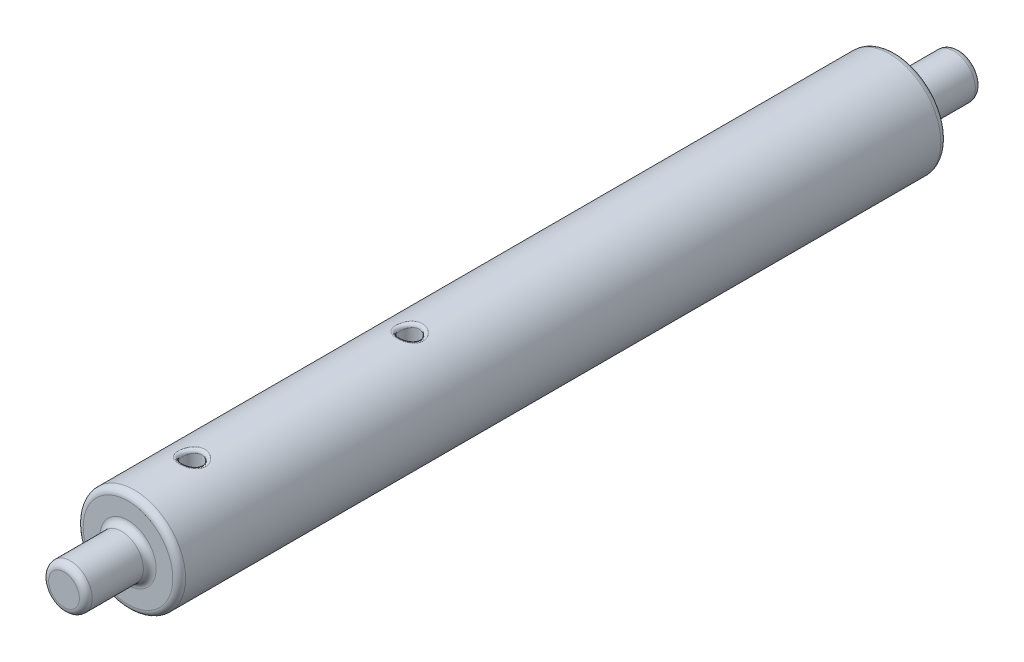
ISO-10303-21;
HEADER;
FILE_DESCRIPTION(('STEP AP214'),'2;1');
FILE_NAME('part.step','',(''),(''),'','','');
FILE_SCHEMA(('AUTOMOTIVE_DESIGN { 1 0 10303 214 1 1 1 1 }'));
ENDSEC;
DATA;
#1=APPLICATION_CONTEXT('core data for automotive mechanical design processes');
#2=APPLICATION_PROTOCOL_DEFINITION('international standard','automotive_design',2000,#1);
#3=PRODUCT_CONTEXT('',#1,'mechanical');
#4=PRODUCT('Part','Part','',(#3));
#5=PRODUCT_RELATED_PRODUCT_CATEGORY('part','',(#4));
#6=PRODUCT_DEFINITION_FORMATION('','',#4);
#7=PRODUCT_DEFINITION_CONTEXT('part definition',#1,'design');
#8=PRODUCT_DEFINITION('design','',#6,#7);
#9=PRODUCT_DEFINITION_SHAPE('','',#8);
#10=(LENGTH_UNIT() NAMED_UNIT(*) SI_UNIT(.MILLI.,.METRE.));
#11=(NAMED_UNIT(*) PLANE_ANGLE_UNIT() SI_UNIT($,.RADIAN.));
#12=(NAMED_UNIT(*) SI_UNIT($,.STERADIAN.) SOLID_ANGLE_UNIT());
#13=UNCERTAINTY_MEASURE_WITH_UNIT(LENGTH_MEASURE(1.E-05),#10,'distance_accuracy_value','');
#14=(GEOMETRIC_REPRESENTATION_CONTEXT(3) GLOBAL_UNCERTAINTY_ASSIGNED_CONTEXT((#13)) GLOBAL_UNIT_ASSIGNED_CONTEXT((#10,
#11,#12)) REPRESENTATION_CONTEXT('',''));
#15=CARTESIAN_POINT('',(0.,0.,0.));
#16=DIRECTION('',(0.,0.,1.));
#17=DIRECTION('',(1.,0.,0.));
#18=AXIS2_PLACEMENT_3D('',#15,#16,#17);
#19=CARTESIAN_POINT('',(0.,1.7,35.));
#20=DIRECTION('',(0.,0.,-1.));
#21=DIRECTION('',(-1.,0.,0.));
#22=AXIS2_PLACEMENT_3D('',#19,#20,#21);
#23=PLANE('',#22);
#24=CARTESIAN_POINT('',(0.,0.,35.));
#25=DIRECTION('',(0.,0.,-1.));
#26=DIRECTION('',(-1.,0.,0.));
#27=AXIS2_PLACEMENT_3D('',#24,#25,#26);
#28=CIRCLE('',#27,1.2);
#29=CARTESIAN_POINT('',(-1.2,0.,35.));
#30=VERTEX_POINT('',#29);
#31=EDGE_CURVE('E119',#30,#30,#28,.F.);
#32=ORIENTED_EDGE('',*,*,#31,.T.);
#33=EDGE_LOOP('',(#32));
#34=FACE_BOUND('',#33,.T.);
#35=ADVANCED_FACE('F29',(#34),#23,.F.);
#36=CARTESIAN_POINT('',(0.,0.,-35.));
#37=DIRECTION('',(0.,0.,1.));
#38=DIRECTION('',(1.,0.,0.));
#39=AXIS2_PLACEMENT_3D('',#36,#37,#38);
#40=PLANE('',#39);
#41=CARTESIAN_POINT('',(0.,0.,-35.));
#42=DIRECTION('',(0.,0.,1.));
#43=DIRECTION('',(1.,0.,0.));
#44=AXIS2_PLACEMENT_3D('',#41,#42,#43);
#45=CIRCLE('',#44,1.2);
#46=CARTESIAN_POINT('',(1.2,0.,-35.));
#47=VERTEX_POINT('',#46);
#48=EDGE_CURVE('E219',#47,#47,#45,.F.);
#49=ORIENTED_EDGE('',*,*,#48,.T.);
#50=EDGE_LOOP('',(#49));
#51=FACE_BOUND('',#50,.T.);
#52=ADVANCED_FACE('F174',(#51),#40,.F.);
#53=CARTESIAN_POINT('',(0.,0.,35.));
#54=DIRECTION('',(0.,0.,1.));
#55=DIRECTION('',(1.,0.,0.));
#56=AXIS2_PLACEMENT_3D('',#53,#54,#55);
#57=CYLINDRICAL_SURFACE('',#56,1.7);
#58=CARTESIAN_POINT('',(0.,0.,-34.5));
#59=DIRECTION('',(0.,0.,1.));
#60=DIRECTION('',(1.,0.,0.));
#61=AXIS2_PLACEMENT_3D('',#58,#59,#60);
#62=CIRCLE('',#61,1.7);
#63=CARTESIAN_POINT('',(1.7,0.,-34.5));
#64=VERTEX_POINT('',#63);
#65=EDGE_CURVE('E224',#64,#64,#62,.T.);
#66=ORIENTED_EDGE('',*,*,#65,.T.);
#67=EDGE_LOOP('',(#66));
#68=FACE_BOUND('',#67,.T.);
#69=CARTESIAN_POINT('',(0.,0.,-30.5));
#70=DIRECTION('',(0.,0.,1.));
#71=DIRECTION('',(1.,0.,0.));
#72=AXIS2_PLACEMENT_3D('',#69,#70,#71);
#73=CIRCLE('',#72,1.7);
#74=CARTESIAN_POINT('',(1.7,0.,-30.5));
#75=VERTEX_POINT('',#74);
#76=EDGE_CURVE('E227',#75,#75,#73,.F.);
#77=ORIENTED_EDGE('',*,*,#76,.T.);
#78=EDGE_LOOP('',(#77));
#79=FACE_BOUND('',#78,.T.);
#80=ADVANCED_FACE('F180',(#68,#79),#57,.T.);
#81=CARTESIAN_POINT('',(0.,1.7,-30.));
#82=DIRECTION('',(0.,0.,1.));
#83=DIRECTION('',(1.,0.,0.));
#84=AXIS2_PLACEMENT_3D('',#81,#82,#83);
#85=PLANE('',#84);
#86=CARTESIAN_POINT('',(0.,0.,-30.));
#87=DIRECTION('',(0.,0.,1.));
#88=DIRECTION('',(1.,0.,0.));
#89=AXIS2_PLACEMENT_3D('',#86,#87,#88);
#90=CIRCLE('',#89,3.49999999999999);
#91=CARTESIAN_POINT('',(3.49999999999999,0.,-30.));
#92=VERTEX_POINT('',#91);
#93=EDGE_CURVE('E234',#92,#92,#90,.F.);
#94=ORIENTED_EDGE('',*,*,#93,.T.);
#95=EDGE_LOOP('',(#94));
#96=FACE_BOUND('',#95,.T.);
#97=CARTESIAN_POINT('',(0.,0.,-30.));
#98=DIRECTION('',(0.,0.,1.));
#99=DIRECTION('',(1.,0.,0.));
#100=AXIS2_PLACEMENT_3D('',#97,#98,#99);
#101=CIRCLE('',#100,2.2);
#102=CARTESIAN_POINT('',(2.2,0.,-30.));
#103=VERTEX_POINT('',#102);
#104=EDGE_CURVE('E237',#103,#103,#101,.T.);
#105=ORIENTED_EDGE('',*,*,#104,.T.);
#106=EDGE_LOOP('',(#105));
#107=FACE_BOUND('',#106,.T.);
#108=ADVANCED_FACE('F257',(#96,#107),#85,.F.);
#109=CARTESIAN_POINT('',(0.,0.,35.));
#110=DIRECTION('',(0.,0.,1.));
#111=DIRECTION('',(1.,0.,0.));
#112=AXIS2_PLACEMENT_3D('',#109,#110,#111);
#113=CYLINDRICAL_SURFACE('',#112,3.99999999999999);
#114=CARTESIAN_POINT('',(-0.195879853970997,-3.74089408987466,8.72396897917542));
#115=CARTESIAN_POINT('',(-0.212404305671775,-3.99490745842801,8.71949805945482));
#116=CARTESIAN_POINT('',(-0.278584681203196,-3.99028702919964,8.9652919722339));
#117=CARTESIAN_POINT('',(-0.155399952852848,-3.74466208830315,8.73492130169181));
#118=CARTESIAN_POINT('',(-0.169050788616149,-3.99697783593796,8.73221507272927));
#119=CARTESIAN_POINT('',(-0.221013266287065,-3.99430622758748,8.97989506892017));
#120=CARTESIAN_POINT('',(-0.113944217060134,-3.74733668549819,8.74248412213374));
#121=CARTESIAN_POINT('',(-0.124016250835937,-3.99849396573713,8.741151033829));
#122=CARTESIAN_POINT('',(-0.162053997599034,-3.99715913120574,8.98997882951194));
#123=CARTESIAN_POINT('',(-0.0303069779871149,-3.75019672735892,8.75056363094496));
#124=CARTESIAN_POINT('',(-0.0331003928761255,-4.00010842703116,8.75065269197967));
#125=CARTESIAN_POINT('',(-0.0431032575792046,-4.00020984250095,9.00075150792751));
#126=CARTESIAN_POINT('',(0.0118743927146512,-3.75038262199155,8.75108159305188));
#127=CARTESIAN_POINT('',(0.0130047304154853,-4.00021509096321,8.75126750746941));
#128=CARTESIAN_POINT('',(0.0168880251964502,-4.00040813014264,9.00144212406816));
#129=CARTESIAN_POINT('',(0.0945300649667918,-3.74827555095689,8.74514011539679));
#130=CARTESIAN_POINT('',(0.102917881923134,-3.99902399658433,8.74427674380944));
#131=CARTESIAN_POINT('',(0.134442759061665,-3.99816058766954,8.99352015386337));
#132=CARTESIAN_POINT('',(0.135019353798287,-3.74605084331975,8.73887280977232));
#133=CARTESIAN_POINT('',(0.146968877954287,-3.99775924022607,8.73686429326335));
#134=CARTESIAN_POINT('',(0.192027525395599,-3.99578756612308,8.98516374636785));
#135=CARTESIAN_POINT('',(0.21439817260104,-3.73946493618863,8.71986205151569));
#136=CARTESIAN_POINT('',(0.232539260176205,-3.99410591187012,8.71465712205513));
#137=CARTESIAN_POINT('',(0.304921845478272,-3.98876259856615,8.95981606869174));
#138=CARTESIAN_POINT('',(0.253285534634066,-3.73510093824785,8.70711011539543));
#139=CARTESIAN_POINT('',(0.274226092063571,-3.99170026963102,8.69975420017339));
#140=CARTESIAN_POINT('',(0.360228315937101,-3.984107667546,8.9428134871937));
#141=CARTESIAN_POINT('',(0.328596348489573,-3.72466236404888,8.67542868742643));
#142=CARTESIAN_POINT('',(0.353862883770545,-3.98614158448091,8.66332123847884));
#143=CARTESIAN_POINT('',(0.467337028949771,-3.97297318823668,8.90057158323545));
#144=CARTESIAN_POINT('',(0.365003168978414,-3.71857742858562,8.65646167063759));
#145=CARTESIAN_POINT('',(0.391888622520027,-3.98296585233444,8.64161265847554));
#146=CARTESIAN_POINT('',(0.519115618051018,-3.96648259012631,8.87528222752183));
#147=CARTESIAN_POINT('',(0.434171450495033,-3.70534126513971,8.6129161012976));
#148=CARTESIAN_POINT('',(0.462828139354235,-3.97636582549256,8.59276725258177));
#149=CARTESIAN_POINT('',(0.617488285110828,-3.95236401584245,8.81722146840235));
#150=CARTESIAN_POINT('',(0.466932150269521,-3.698189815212,8.58833638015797));
#151=CARTESIAN_POINT('',(0.495757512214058,-3.97292950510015,8.56548902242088));
#152=CARTESIAN_POINT('',(0.664081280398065,-3.94473580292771,8.78444850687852));
#153=CARTESIAN_POINT('',(0.528965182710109,-3.68332638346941,8.53335436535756));
#154=CARTESIAN_POINT('',(0.556741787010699,-3.96618264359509,8.50590245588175));
#155=CARTESIAN_POINT('',(0.752306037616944,-3.9288814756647,8.71113915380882));
#156=CARTESIAN_POINT('',(0.558095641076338,-3.67560385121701,8.50279344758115));
#157=CARTESIAN_POINT('',(0.584524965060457,-3.96288155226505,8.47337146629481));
#158=CARTESIAN_POINT('',(0.793736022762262,-3.92064410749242,8.67039126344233));
#159=CARTESIAN_POINT('',(0.610818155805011,-3.66067016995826,8.43722811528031));
#160=CARTESIAN_POINT('',(0.633506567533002,-3.95693163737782,8.40551176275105));
#161=CARTESIAN_POINT('',(0.868719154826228,-3.90471484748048,8.58297082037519));
#162=CARTESIAN_POINT('',(0.634417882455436,-3.65345832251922,8.40222995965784));
#163=CARTESIAN_POINT('',(0.654578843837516,-3.95429573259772,8.37016360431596));
#164=CARTESIAN_POINT('',(0.902283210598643,-3.89702221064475,8.53630661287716));
#165=CARTESIAN_POINT('',(0.675678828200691,-3.64028593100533,8.32828135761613));
#166=CARTESIAN_POINT('',(0.690479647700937,-3.94983394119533,8.29758150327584));
#167=CARTESIAN_POINT('',(0.960965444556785,-3.88297165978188,8.43770847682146));
#168=CARTESIAN_POINT('',(0.693276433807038,-3.63433902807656,8.28929394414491));
#169=CARTESIAN_POINT('',(0.705077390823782,-3.94803765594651,8.26042231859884));
#170=CARTESIAN_POINT('',(0.985993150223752,-3.8766282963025,8.38572525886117));
#171=CARTESIAN_POINT('',(0.721621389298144,-3.62451783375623,8.20876644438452));
#172=CARTESIAN_POINT('',(0.72814361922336,-3.94526174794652,8.18552689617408));
#173=CARTESIAN_POINT('',(1.02630597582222,-3.86615235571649,8.2783552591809));
#174=CARTESIAN_POINT('',(0.732370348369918,-3.62064305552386,8.16722696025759));
#175=CARTESIAN_POINT('',(0.736477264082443,-3.94429932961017,8.14797532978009));
#176=CARTESIAN_POINT('',(1.04159338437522,-3.86201925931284,8.22296928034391));
#177=CARTESIAN_POINT('',(0.746437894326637,-3.61553164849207,8.08402515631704));
#178=CARTESIAN_POINT('',(0.747345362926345,-3.94306175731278,8.07372827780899));
#179=CARTESIAN_POINT('',(1.06160056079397,-3.85656709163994,8.11203354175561));
#180=CARTESIAN_POINT('',(0.749957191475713,-3.61422380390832,8.04239923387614));
#181=CARTESIAN_POINT('',(0.749967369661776,-3.94277605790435,8.03726417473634));
#182=CARTESIAN_POINT('',(1.0666057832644,-3.85517205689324,8.05653231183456));
#183=CARTESIAN_POINT('',(0.750042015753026,-3.61419263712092,7.95914298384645));
#184=CARTESIAN_POINT('',(0.75003203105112,-3.94276889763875,7.96408961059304));
#185=CARTESIAN_POINT('',(1.06672642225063,-3.85513881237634,7.94552397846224));
#186=CARTESIAN_POINT('',(0.746608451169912,-3.61546897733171,7.91751265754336));
#187=CARTESIAN_POINT('',(0.747474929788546,-3.94304741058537,7.92762774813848));
#188=CARTESIAN_POINT('',(1.0618431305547,-3.85650024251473,7.89001687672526));
#189=CARTESIAN_POINT('',(0.733071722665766,-3.62038885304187,7.83642341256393));
#190=CARTESIAN_POINT('',(0.737018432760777,-3.94423737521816,7.85528236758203));
#191=CARTESIAN_POINT('',(1.04259089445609,-3.86174810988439,7.78189788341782));
#192=CARTESIAN_POINT('',(0.72312319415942,-3.62397747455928,7.79693659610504));
#193=CARTESIAN_POINT('',(0.729307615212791,-3.94512664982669,7.81962655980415));
#194=CARTESIAN_POINT('',(1.02844187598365,-3.86557597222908,7.72924879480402));
#195=CARTESIAN_POINT('',(0.69701026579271,-3.63306152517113,7.72013384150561));
#196=CARTESIAN_POINT('',(0.708142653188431,-3.94766499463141,7.74841859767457));
#197=CARTESIAN_POINT('',(0.991303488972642,-3.87526562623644,7.62684512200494));
#198=CARTESIAN_POINT('',(0.680834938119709,-3.63856030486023,7.68282185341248));
#199=CARTESIAN_POINT('',(0.694792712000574,-3.94930088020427,7.71302892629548));
#200=CARTESIAN_POINT('',(0.968298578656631,-3.88113099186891,7.57709580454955));
#201=CARTESIAN_POINT('',(0.64239529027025,-3.65096787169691,7.61073471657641));
#202=CARTESIAN_POINT('',(0.661610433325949,-3.95341987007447,7.64272556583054));
#203=CARTESIAN_POINT('',(0.9136288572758,-3.8943657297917,7.48097962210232));
#204=CARTESIAN_POINT('',(0.620024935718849,-3.65790062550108,7.57601850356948));
#205=CARTESIAN_POINT('',(0.641804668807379,-3.95589980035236,7.6079097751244));
#206=CARTESIAN_POINT('',(0.881813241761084,-3.90176066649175,7.43469133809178));
#207=CARTESIAN_POINT('',(0.569941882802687,-3.67235375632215,7.51075700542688));
#208=CARTESIAN_POINT('',(0.595666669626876,-3.96154309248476,7.54082507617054));
#209=CARTESIAN_POINT('',(0.810584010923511,-3.91717733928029,7.34767600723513));
#210=CARTESIAN_POINT('',(0.542228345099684,-3.67987422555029,7.48021237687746));
#211=CARTESIAN_POINT('',(0.569465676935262,-3.96469230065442,7.50854796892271));
#212=CARTESIAN_POINT('',(0.7711692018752,-3.92519917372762,7.30694983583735));
#213=CARTESIAN_POINT('',(0.481235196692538,-3.69493553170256,7.42319108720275));
#214=CARTESIAN_POINT('',(0.510014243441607,-3.97140268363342,7.4471858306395));
#215=CARTESIAN_POINT('',(0.684423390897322,-3.941264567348,7.2309214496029));
#216=CARTESIAN_POINT('',(0.447810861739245,-3.702469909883,7.39686804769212));
#217=CARTESIAN_POINT('',(0.476640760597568,-3.97497256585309,7.41811513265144));
#218=CARTESIAN_POINT('',(0.636886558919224,-3.94930123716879,7.19582406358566));
#219=CARTESIAN_POINT('',(0.376917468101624,-3.7164785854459,7.35020610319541));
#220=CARTESIAN_POINT('',(0.404265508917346,-3.98188754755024,7.36597162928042));
#221=CARTESIAN_POINT('',(0.536060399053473,-3.96424382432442,7.13360813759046));
#222=CARTESIAN_POINT('',(0.339450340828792,-3.72295338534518,7.32986435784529));
#223=CARTESIAN_POINT('',(0.365260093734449,-3.9852446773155,7.34274218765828));
#224=CARTESIAN_POINT('',(0.482773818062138,-3.97115027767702,7.10648581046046));
#225=CARTESIAN_POINT('',(0.266666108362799,-3.73338166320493,7.29803713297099));
#226=CARTESIAN_POINT('',(0.288408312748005,-3.99077642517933,7.30617777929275));
#227=CARTESIAN_POINT('',(0.379258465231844,-3.98227377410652,7.06404951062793));
#228=CARTESIAN_POINT('',(0.231721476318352,-3.73755549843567,7.28573551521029));
#229=CARTESIAN_POINT('',(0.251068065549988,-3.99305951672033,7.29185182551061));
#230=CARTESIAN_POINT('',(0.329559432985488,-3.98672586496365,7.04764735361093));
#231=CARTESIAN_POINT('',(0.160318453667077,-3.7442065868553,7.26640237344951));
#232=CARTESIAN_POINT('',(0.174301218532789,-3.99672860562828,7.26931661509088));
#233=CARTESIAN_POINT('',(0.228008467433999,-3.99382035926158,7.02186983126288));
#234=CARTESIAN_POINT('',(0.123860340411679,-3.7466841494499,7.25936988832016));
#235=CARTESIAN_POINT('',(0.134755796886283,-3.99812715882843,7.26102605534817));
#236=CARTESIAN_POINT('',(0.176156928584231,-3.99646309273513,7.01249318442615));
#237=CARTESIAN_POINT('',(0.0462959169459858,-3.74988536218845,7.25030718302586));
#238=CARTESIAN_POINT('',(0.0505181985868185,-3.99993065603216,7.25037794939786));
#239=CARTESIAN_POINT('',(0.0658430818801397,-3.99987771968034,7.00040957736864));
#240=CARTESIAN_POINT('',(0.00511071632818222,-3.75039221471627,7.24889489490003));
#241=CARTESIAN_POINT('',(0.0055187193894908,-4.0002215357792,7.24870113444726));
#242=CARTESIAN_POINT('',(0.00726857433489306,-4.00041836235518,6.99852652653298));
#243=CARTESIAN_POINT('',(-0.0769211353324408,-3.7489965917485,7.25282500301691));
#244=CARTESIAN_POINT('',(-0.083763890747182,-3.99943171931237,7.25332741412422));
#245=CARTESIAN_POINT('',(-0.10939894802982,-3.998929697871,7.00376667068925));
#246=CARTESIAN_POINT('',(-0.117767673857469,-3.74709334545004,7.25816956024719));
#247=CARTESIAN_POINT('',(-0.128261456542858,-3.99834675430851,7.25965541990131));
#248=CARTESIAN_POINT('',(-0.167491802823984,-3.99689956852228,7.01089274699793));
#249=CARTESIAN_POINT('',(-0.197886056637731,-3.74108848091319,7.27541892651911));
#250=CARTESIAN_POINT('',(-0.214790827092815,-3.99500262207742,7.27983548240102));
#251=CARTESIAN_POINT('',(-0.281437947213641,-3.99049437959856,7.03389190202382));
#252=CARTESIAN_POINT('',(-0.237160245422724,-3.73699027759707,7.28731354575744));
#253=CARTESIAN_POINT('',(-0.257007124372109,-3.99273056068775,7.293767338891));
#254=CARTESIAN_POINT('',(-0.33729457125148,-3.98612296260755,7.04975139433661));
#255=CARTESIAN_POINT('',(-0.313191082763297,-3.72702573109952,7.31729639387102));
#256=CARTESIAN_POINT('',(-0.337670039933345,-3.98738685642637,7.3283391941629));
#257=CARTESIAN_POINT('',(-0.445427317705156,-3.97549411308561,7.08972852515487));
#258=CARTESIAN_POINT('',(-0.349944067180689,-3.72115687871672,7.33539341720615));
#259=CARTESIAN_POINT('',(-0.376224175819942,-3.98429564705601,7.34912398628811));
#260=CARTESIAN_POINT('',(-0.497698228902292,-3.96923400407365,7.11385788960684));
#261=CARTESIAN_POINT('',(-0.42046932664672,-3.70816503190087,7.37756983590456));
#262=CARTESIAN_POINT('',(-0.448923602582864,-3.97774649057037,7.39663055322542));
#263=CARTESIAN_POINT('',(-0.59800082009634,-3.95537603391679,7.17009311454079));
#264=CARTESIAN_POINT('',(-0.454187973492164,-3.70102437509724,7.40173575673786));
#265=CARTESIAN_POINT('',(-0.483015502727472,-3.97427061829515,7.42357987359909));
#266=CARTESIAN_POINT('',(-0.645956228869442,-3.94775933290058,7.20231434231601));
#267=CARTESIAN_POINT('',(-0.517163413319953,-3.68630429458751,7.45525222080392));
#268=CARTESIAN_POINT('',(-0.545291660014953,-3.96749775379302,7.48185378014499));
#269=CARTESIAN_POINT('',(-0.735521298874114,-3.93205791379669,7.27366962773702));
#270=CARTESIAN_POINT('',(-0.546419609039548,-3.67872481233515,7.48460345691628));
#271=CARTESIAN_POINT('',(-0.573417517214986,-3.96419935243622,7.51328949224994));
#272=CARTESIAN_POINT('',(-0.777130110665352,-3.9239731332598,7.31280460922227));
#273=CARTESIAN_POINT('',(-0.600476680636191,-3.66372462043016,7.54863379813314));
#274=CARTESIAN_POINT('',(-0.624088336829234,-3.95809766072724,7.5800449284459));
#275=CARTESIAN_POINT('',(-0.854011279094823,-3.90797292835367,7.39817839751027));
#276=CARTESIAN_POINT('',(-0.625130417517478,-3.65631424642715,7.58343874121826));
#277=CARTESIAN_POINT('',(-0.646311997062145,-3.95532474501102,7.61546948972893));
#278=CARTESIAN_POINT('',(-0.889074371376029,-3.90006852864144,7.44458498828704));
#279=CARTESIAN_POINT('',(-0.668205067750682,-3.6427460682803,7.65676962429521));
#280=CARTESIAN_POINT('',(-0.68412445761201,-3.95062263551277,7.68795995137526));
#281=CARTESIAN_POINT('',(-0.950336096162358,-3.88559580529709,7.54235949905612));
#282=CARTESIAN_POINT('',(-0.686635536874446,-3.63658634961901,7.69528974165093));
#283=CARTESIAN_POINT('',(-0.699562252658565,-3.94871250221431,7.72495381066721));
#284=CARTESIAN_POINT('',(-0.976548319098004,-3.8790254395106,7.5937196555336));
#285=CARTESIAN_POINT('',(-0.716613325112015,-3.62628943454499,7.77471709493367));
#286=CARTESIAN_POINT('',(-0.724158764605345,-3.94573322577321,7.79931677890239));
#287=CARTESIAN_POINT('',(-1.01918339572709,-3.86804206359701,7.69962279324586));
#288=CARTESIAN_POINT('',(-0.728214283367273,-3.62213652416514,7.81560288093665));
#289=CARTESIAN_POINT('',(-0.733228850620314,-3.9446752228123,7.83651533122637));
#290=CARTESIAN_POINT('',(-1.03568253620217,-3.86361229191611,7.75413717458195));
#291=CARTESIAN_POINT('',(-0.744353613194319,-3.61630023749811,7.89883838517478));
#292=CARTESIAN_POINT('',(-0.745771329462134,-3.9432364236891,7.9111335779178));
#293=CARTESIAN_POINT('',(-1.05863624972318,-3.85738691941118,7.86511784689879));
#294=CARTESIAN_POINT('',(-0.748893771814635,-3.61461623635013,7.94118773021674));
#295=CARTESIAN_POINT('',(-0.749162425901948,-3.94286521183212,7.94831666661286));
#296=CARTESIAN_POINT('',(-1.06509336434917,-3.85559065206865,7.92158364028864));
#297=CARTESIAN_POINT('',(-0.75071802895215,-3.6139431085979,8.02466045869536));
#298=CARTESIAN_POINT('',(-0.750544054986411,-3.94271217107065,8.02170051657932));
#299=CARTESIAN_POINT('',(-1.06768786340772,-3.854872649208,8.03288061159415));
#300=CARTESIAN_POINT('',(-0.748235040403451,-3.61486747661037,8.06577853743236));
#301=CARTESIAN_POINT('',(-0.748698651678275,-3.94291244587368,8.05765242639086));
#302=CARTESIAN_POINT('',(-1.06415650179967,-3.85585864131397,8.08770471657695));
#303=CARTESIAN_POINT('',(-0.736598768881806,-3.61911327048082,8.14698555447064));
#304=CARTESIAN_POINT('',(-0.739754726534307,-3.94392371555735,8.12982445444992));
#305=CARTESIAN_POINT('',(-1.04760713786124,-3.86038748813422,8.19598073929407));
#306=CARTESIAN_POINT('',(-0.72744553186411,-3.62243467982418,8.18707449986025));
#307=CARTESIAN_POINT('',(-0.732712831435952,-3.94472821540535,8.16581975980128));
#308=CARTESIAN_POINT('',(-1.03458920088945,-3.86393032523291,8.24943266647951));
#309=CARTESIAN_POINT('',(-0.702842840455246,-3.6310579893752,8.26489365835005));
#310=CARTESIAN_POINT('',(-0.712921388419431,-3.94708581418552,8.23753530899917));
#311=CARTESIAN_POINT('',(-0.999598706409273,-3.87312852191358,8.35319154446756));
#312=CARTESIAN_POINT('',(-0.687428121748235,-3.63634895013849,8.30263558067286));
#313=CARTESIAN_POINT('',(-0.700313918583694,-3.94862087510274,8.27308040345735));
#314=CARTESIAN_POINT('',(-0.977675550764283,-3.87877221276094,8.40351410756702));
#315=CARTESIAN_POINT('',(-0.650740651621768,-3.64832956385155,8.37508437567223));
#316=CARTESIAN_POINT('',(-0.668909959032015,-3.9525103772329,8.34326039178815));
#317=CARTESIAN_POINT('',(-0.925497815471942,-3.89155153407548,8.50011250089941));
#318=CARTESIAN_POINT('',(-0.629459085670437,-3.65502131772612,8.40978657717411));
#319=CARTESIAN_POINT('',(-0.650242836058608,-3.95484810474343,8.37779896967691));
#320=CARTESIAN_POINT('',(-0.895230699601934,-3.89868940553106,8.54638210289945));
#321=CARTESIAN_POINT('',(-0.580899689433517,-3.66929520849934,8.47623436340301));
#322=CARTESIAN_POINT('',(-0.605914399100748,-3.96030214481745,8.44559722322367));
#323=CARTESIAN_POINT('',(-0.826168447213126,-3.91391488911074,8.63497915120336));
#324=CARTESIAN_POINT('',(-0.553461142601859,-3.67689803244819,8.5078600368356));
#325=CARTESIAN_POINT('',(-0.580189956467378,-3.96342517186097,8.47879962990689));
#326=CARTESIAN_POINT('',(-0.787144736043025,-3.92202456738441,8.67714671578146));
#327=CARTESIAN_POINT('',(-0.493705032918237,-3.69199369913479,8.56612460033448));
#328=CARTESIAN_POINT('',(-0.522314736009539,-3.97005164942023,8.5411776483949));
#329=CARTESIAN_POINT('',(-0.702158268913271,-3.93812661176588,8.75483280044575));
#330=CARTESIAN_POINT('',(-0.461387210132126,-3.69948653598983,8.59276322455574));
#331=CARTESIAN_POINT('',(-0.490254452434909,-3.97355067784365,8.57043878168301));
#332=CARTESIAN_POINT('',(-0.656195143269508,-3.94611897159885,8.79035096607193));
#333=CARTESIAN_POINT('',(-0.392014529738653,-3.71369462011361,8.64081130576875));
#334=CARTESIAN_POINT('',(-0.419839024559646,-3.98047785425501,8.62387937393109));
#335=CARTESIAN_POINT('',(-0.557531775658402,-3.96127426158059,8.85441507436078));
#336=CARTESIAN_POINT('',(-0.354879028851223,-3.72039168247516,8.66210765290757));
#337=CARTESIAN_POINT('',(-0.381369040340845,-3.98391445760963,8.64810538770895));
#338=CARTESIAN_POINT('',(-0.504716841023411,-3.96841779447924,8.88281020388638));
#339=CARTESIAN_POINT('',(-0.277457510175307,-3.73206807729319,8.69809472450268));
#340=CARTESIAN_POINT('',(-0.299981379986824,-3.99005442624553,8.68929081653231));
#341=CARTESIAN_POINT('',(-0.394606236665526,-3.98087261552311,8.93079296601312));
#342=CARTESIAN_POINT('',(-0.237176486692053,-3.73705006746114,8.71279568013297));
#343=CARTESIAN_POINT('',(-0.256975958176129,-3.99277890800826,8.70642372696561));
#344=CARTESIAN_POINT('',(-0.337317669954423,-3.98618673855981,8.95039424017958));
#345=CARTESIAN_POINT('',(-0.195879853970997,-3.74089408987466,8.72396897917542));
#346=CARTESIAN_POINT('',(-0.212404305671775,-3.99490745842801,8.71949805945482));
#347=CARTESIAN_POINT('',(-0.278584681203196,-3.99028702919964,8.9652919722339));
#348=(BOUNDED_SURFACE() B_SPLINE_SURFACE(3,2,((#114,#115,#116),(#117,#118,#119),(#120,#121,
#122),(#123,#124,#125),(#126,#127,#128),(#129,#130,#131),(#132,#133,#134),(#135,#136,#137),
(#138,#139,#140),(#141,#142,#143),(#144,#145,#146),(#147,#148,#149),(#150,#151,#152),(#153,#154,
#155),(#156,#157,#158),(#159,#160,#161),(#162,#163,#164),(#165,#166,#167),(#168,#169,#170),
(#171,#172,#173),(#174,#175,#176),(#177,#178,#179),(#180,#181,#182),(#183,#184,#185),(#186,#187,
#188),(#189,#190,#191),(#192,#193,#194),(#195,#196,#197),(#198,#199,#200),(#201,#202,#203),
(#204,#205,#206),(#207,#208,#209),(#210,#211,#212),(#213,#214,#215),(#216,#217,#218),(#219,#220,
#221),(#222,#223,#224),(#225,#226,#227),(#228,#229,#230),(#231,#232,#233),(#234,#235,#236),
(#237,#238,#239),(#240,#241,#242),(#243,#244,#245),(#246,#247,#248),(#249,#250,#251),(#252,#253,
#254),(#255,#256,#257),(#258,#259,#260),(#261,#262,#263),(#264,#265,#266),(#267,#268,#269),
(#270,#271,#272),(#273,#274,#275),(#276,#277,#278),(#279,#280,#281),(#282,#283,#284),(#285,#286,
#287),(#288,#289,#290),(#291,#292,#293),(#294,#295,#296),(#297,#298,#299),(#300,#301,#302),
(#303,#304,#305),(#306,#307,#308),(#309,#310,#311),(#312,#313,#314),(#315,#316,#317),(#318,#319,
#320),(#321,#322,#323),(#324,#325,#326),(#327,#328,#329),(#330,#331,#332),(#333,#334,#335),
(#336,#337,#338),(#339,#340,#341),(#342,#343,#344),(#345,#346,#347)),.UNSPECIFIED.,.T.,.F.,
.F.) B_SPLINE_SURFACE_WITH_KNOTS((4,2,2,2,2,2,2,2,2,2,2,2,2,2,2,2,2,2,2,2,2,2,2,2,2,2,2,2,2,2,2,
2,2,2,2,2,2,2,4),(3,3),(0.,0.167913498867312,0.335796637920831,0.499047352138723,
0.662512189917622,0.826982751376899,0.991487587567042,1.16115902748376,1.33059374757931,
1.50177214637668,1.67291030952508,1.83922935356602,2.00552667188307,2.1680133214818,
2.33078643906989,2.49653897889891,2.66231757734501,2.83318410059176,3.00396935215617,
3.15213502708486,3.30027366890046,3.46431263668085,3.62840408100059,3.79224096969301,
3.95631113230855,4.12286835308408,4.28944784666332,4.46067661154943,4.63164124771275,
4.80124456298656,4.97080494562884,5.13480865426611,5.29881123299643,5.46191616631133,
5.62526750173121,5.79351875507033,5.96177897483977,6.13334740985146,6.30464876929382),(0.,1.),
.UNSPECIFIED.) GEOMETRIC_REPRESENTATION_ITEM() RATIONAL_B_SPLINE_SURFACE(((1.,0.700646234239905,
1.),(1.,0.703328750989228,1.),(1.,0.705222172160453,1.),(1.,0.707246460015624,1.),(1.,
0.707377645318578,1.),(1.,0.705886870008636,1.),(1.,0.7043131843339,1.),(1.,0.699631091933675,
1.),(1.,0.696520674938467,1.),(1.,0.689027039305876,1.),(1.,0.68463610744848,1.),(1.,
0.674999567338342,1.),(1.,0.669753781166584,1.),(1.,0.658743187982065,1.),(1.,0.652967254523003,
1.),(1.,0.641684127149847,1.),(1.,0.636176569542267,1.),(1.,0.626028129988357,1.),(1.,
0.62139675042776,1.),(1.,0.613701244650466,1.),(1.,0.610636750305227,1.),(1.,0.606585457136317,
1.),(1.,0.605542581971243,1.),(1.,0.605517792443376,1.),(1.,0.60653560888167,1.),(1.,
0.610435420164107,1.),(1.,0.613274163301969,1.),(1.,0.620398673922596,1.),(1.,0.624686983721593,
1.),(1.,0.634266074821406,1.),(1.,0.639573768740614,1.),(1.,0.65052334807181,1.),(1.,
0.656165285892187,1.),(1.,0.667356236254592,1.),(1.,0.672897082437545,1.),(1.,0.683116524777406,
1.),(1.,0.687795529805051,1.),(1.,0.695289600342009,1.),(1.,0.698269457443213,1.),(1.,
0.703004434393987,1.),(1.,0.704759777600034,1.),(1.,0.707026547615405,1.),(1.,0.707384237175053,
1.),(1.,0.706397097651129,1.),(1.,0.705051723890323,1.),(1.,0.700786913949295,1.),(1.,
0.697869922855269,1.),(1.,0.690728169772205,1.),(1.,0.686501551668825,1.),(1.,0.677063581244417,
1.),(1.,0.671838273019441,1.),(1.,0.660959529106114,1.),(1.,0.655306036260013,1.),(1.,
0.644004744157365,1.),(1.,0.63836150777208,1.),(1.,0.627933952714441,1.),(1.,0.623148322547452,
1.),(1.,0.615095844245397,1.),(1.,0.611817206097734,1.),(1.,0.607196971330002,1.),(1.,
0.605854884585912,1.),(1.,0.605319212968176,1.),(1.,0.606056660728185,1.),(1.,0.609425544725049,
1.),(1.,0.612056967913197,1.),(1.,0.618831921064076,1.),(1.,0.622967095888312,1.),(1.,
0.632237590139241,1.),(1.,0.637374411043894,1.),(1.,0.64821819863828,1.),(1.,0.653937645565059,
1.),(1.,0.665181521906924,1.),(1.,0.670705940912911,1.),(1.,0.681095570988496,1.),(1.,
0.685945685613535,1.),(1.,0.694351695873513,1.),(1.,0.697909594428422,1.),(1.,0.700646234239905,1.))) REPRESENTATION_ITEM('') SURFACE());
#349=CARTESIAN_POINT('',(-0.278584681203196,-3.99028702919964,8.9652919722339));
#350=CARTESIAN_POINT('',(-0.221013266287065,-3.99430622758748,8.97989506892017));
#351=CARTESIAN_POINT('',(-0.162053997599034,-3.99715913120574,8.98997882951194));
#352=CARTESIAN_POINT('',(-0.0431032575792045,-4.00020984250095,9.00075150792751));
#353=CARTESIAN_POINT('',(0.0168880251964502,-4.00040813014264,9.00144212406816));
#354=CARTESIAN_POINT('',(0.134442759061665,-3.99816058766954,8.99352015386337));
#355=CARTESIAN_POINT('',(0.192027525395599,-3.99578756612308,8.98516374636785));
#356=CARTESIAN_POINT('',(0.304921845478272,-3.98876259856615,8.95981606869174));
#357=CARTESIAN_POINT('',(0.360228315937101,-3.984107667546,8.9428134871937));
#358=CARTESIAN_POINT('',(0.467337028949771,-3.97297318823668,8.90057158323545));
#359=CARTESIAN_POINT('',(0.519115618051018,-3.96648259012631,8.87528222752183));
#360=CARTESIAN_POINT('',(0.617488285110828,-3.95236401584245,8.81722146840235));
#361=CARTESIAN_POINT('',(0.664081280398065,-3.94473580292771,8.78444850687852));
#362=CARTESIAN_POINT('',(0.752306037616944,-3.9288814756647,8.71113915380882));
#363=CARTESIAN_POINT('',(0.793736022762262,-3.92064410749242,8.67039126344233));
#364=CARTESIAN_POINT('',(0.868719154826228,-3.90471484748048,8.58297082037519));
#365=CARTESIAN_POINT('',(0.902283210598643,-3.89702221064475,8.53630661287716));
#366=CARTESIAN_POINT('',(0.960965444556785,-3.88297165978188,8.43770847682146));
#367=CARTESIAN_POINT('',(0.985993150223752,-3.8766282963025,8.38572525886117));
#368=CARTESIAN_POINT('',(1.02630597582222,-3.86615235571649,8.2783552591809));
#369=CARTESIAN_POINT('',(1.04159338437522,-3.86201925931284,8.22296928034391));
#370=CARTESIAN_POINT('',(1.06160056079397,-3.85656709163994,8.11203354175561));
#371=CARTESIAN_POINT('',(1.0666057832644,-3.85517205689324,8.05653231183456));
#372=CARTESIAN_POINT('',(1.06672642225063,-3.85513881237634,7.94552397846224));
#373=CARTESIAN_POINT('',(1.0618431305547,-3.85650024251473,7.89001687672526));
#374=CARTESIAN_POINT('',(1.04259089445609,-3.86174810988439,7.78189788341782));
#375=CARTESIAN_POINT('',(1.02844187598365,-3.86557597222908,7.72924879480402));
#376=CARTESIAN_POINT('',(0.991303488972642,-3.87526562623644,7.62684512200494));
#377=CARTESIAN_POINT('',(0.968298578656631,-3.88113099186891,7.57709580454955));
#378=CARTESIAN_POINT('',(0.9136288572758,-3.8943657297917,7.48097962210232));
#379=CARTESIAN_POINT('',(0.881813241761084,-3.90176066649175,7.43469133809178));
#380=CARTESIAN_POINT('',(0.810584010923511,-3.91717733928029,7.34767600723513));
#381=CARTESIAN_POINT('',(0.7711692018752,-3.92519917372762,7.30694983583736));
#382=CARTESIAN_POINT('',(0.684423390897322,-3.941264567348,7.2309214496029));
#383=CARTESIAN_POINT('',(0.636886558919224,-3.94930123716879,7.19582406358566));
#384=CARTESIAN_POINT('',(0.536060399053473,-3.96424382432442,7.13360813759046));
#385=CARTESIAN_POINT('',(0.482773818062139,-3.97115027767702,7.10648581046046));
#386=CARTESIAN_POINT('',(0.379258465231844,-3.98227377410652,7.06404951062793));
#387=CARTESIAN_POINT('',(0.329559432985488,-3.98672586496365,7.04764735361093));
#388=CARTESIAN_POINT('',(0.228008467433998,-3.99382035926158,7.02186983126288));
#389=CARTESIAN_POINT('',(0.176156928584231,-3.99646309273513,7.01249318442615));
#390=CARTESIAN_POINT('',(0.0658430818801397,-3.99987771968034,7.00040957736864));
#391=CARTESIAN_POINT('',(0.00726857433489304,-4.00041836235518,6.99852652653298));
#392=CARTESIAN_POINT('',(-0.10939894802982,-3.998929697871,7.00376667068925));
#393=CARTESIAN_POINT('',(-0.167491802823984,-3.99689956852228,7.01089274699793));
#394=CARTESIAN_POINT('',(-0.281437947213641,-3.99049437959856,7.03389190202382));
#395=CARTESIAN_POINT('',(-0.33729457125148,-3.98612296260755,7.04975139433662));
#396=CARTESIAN_POINT('',(-0.445427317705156,-3.97549411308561,7.08972852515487));
#397=CARTESIAN_POINT('',(-0.497698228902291,-3.96923400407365,7.11385788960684));
#398=CARTESIAN_POINT('',(-0.59800082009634,-3.95537603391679,7.17009311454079));
#399=CARTESIAN_POINT('',(-0.645956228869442,-3.94775933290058,7.20231434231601));
#400=CARTESIAN_POINT('',(-0.735521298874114,-3.93205791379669,7.27366962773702));
#401=CARTESIAN_POINT('',(-0.777130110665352,-3.9239731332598,7.31280460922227));
#402=CARTESIAN_POINT('',(-0.854011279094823,-3.90797292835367,7.39817839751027));
#403=CARTESIAN_POINT('',(-0.889074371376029,-3.90006852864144,7.44458498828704));
#404=CARTESIAN_POINT('',(-0.950336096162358,-3.88559580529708,7.54235949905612));
#405=CARTESIAN_POINT('',(-0.976548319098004,-3.8790254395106,7.5937196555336));
#406=CARTESIAN_POINT('',(-1.01918339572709,-3.86804206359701,7.69962279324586));
#407=CARTESIAN_POINT('',(-1.03568253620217,-3.86361229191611,7.75413717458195));
#408=CARTESIAN_POINT('',(-1.05863624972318,-3.85738691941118,7.86511784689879));
#409=CARTESIAN_POINT('',(-1.06509336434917,-3.85559065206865,7.92158364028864));
#410=CARTESIAN_POINT('',(-1.06768786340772,-3.854872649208,8.03288061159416));
#411=CARTESIAN_POINT('',(-1.06415650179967,-3.85585864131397,8.08770471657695));
#412=CARTESIAN_POINT('',(-1.04760713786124,-3.86038748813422,8.19598073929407));
#413=CARTESIAN_POINT('',(-1.03458920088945,-3.86393032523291,8.24943266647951));
#414=CARTESIAN_POINT('',(-0.999598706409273,-3.87312852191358,8.35319154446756));
#415=CARTESIAN_POINT('',(-0.977675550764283,-3.87877221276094,8.40351410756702));
#416=CARTESIAN_POINT('',(-0.925497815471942,-3.89155153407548,8.50011250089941));
#417=CARTESIAN_POINT('',(-0.895230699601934,-3.89868940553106,8.54638210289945));
#418=CARTESIAN_POINT('',(-0.826168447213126,-3.91391488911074,8.63497915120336));
#419=CARTESIAN_POINT('',(-0.787144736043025,-3.92202456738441,8.67714671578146));
#420=CARTESIAN_POINT('',(-0.702158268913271,-3.93812661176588,8.75483280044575));
#421=CARTESIAN_POINT('',(-0.656195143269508,-3.94611897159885,8.79035096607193));
#422=CARTESIAN_POINT('',(-0.557531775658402,-3.96127426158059,8.85441507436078));
#423=CARTESIAN_POINT('',(-0.50471684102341,-3.96841779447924,8.88281020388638));
#424=CARTESIAN_POINT('',(-0.394606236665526,-3.98087261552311,8.93079296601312));
#425=CARTESIAN_POINT('',(-0.337317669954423,-3.98618673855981,8.95039424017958));
#426=CARTESIAN_POINT('',(-0.278584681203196,-3.99028702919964,8.9652919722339));
#427=B_SPLINE_CURVE_WITH_KNOTS('',3,(#349,#350,#351,#352,#353,#354,#355,#356,#357,#358,#359,
#360,#361,#362,#363,#364,#365,#366,#367,#368,#369,#370,#371,#372,#373,#374,#375,#376,#377,#378,
#379,#380,#381,#382,#383,#384,#385,#386,#387,#388,#389,#390,#391,#392,#393,#394,#395,#396,#397,
#398,#399,#400,#401,#402,#403,#404,#405,#406,#407,#408,#409,#410,#411,#412,#413,#414,#415,#416,
#417,#418,#419,#420,#421,#422,#423,#424,#425,#426),.UNSPECIFIED.,.T.,.F.,(4,2,2,2,2,2,2,2,2,2,2,
2,2,2,2,2,2,2,2,2,2,2,2,2,2,2,2,2,2,2,2,2,2,2,2,2,2,2,4),(0.,0.167913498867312,
0.335796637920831,0.499047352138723,0.662512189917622,0.826982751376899,0.991487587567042,
1.16115902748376,1.33059374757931,1.50177214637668,1.67291030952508,1.83922935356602,
2.00552667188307,2.1680133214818,2.33078643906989,2.49653897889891,2.66231757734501,
2.83318410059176,3.00396935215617,3.15213502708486,3.30027366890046,3.46431263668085,
3.62840408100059,3.79224096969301,3.95631113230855,4.12286835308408,4.28944784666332,
4.46067661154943,4.63164124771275,4.80124456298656,4.97080494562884,5.13480865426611,
5.29881123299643,5.46191616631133,5.62526750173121,5.79351875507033,5.96177897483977,
6.13334740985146,6.30464876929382),.UNSPECIFIED.);
#428=CARTESIAN_POINT('',(-0.278584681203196,-3.99028702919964,8.9652919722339));
#429=VERTEX_POINT('',#428);
#430=EDGE_CURVE('E130',#429,#429,#427,.T.);
#431=ORIENTED_EDGE('',*,*,#430,.T.);
#432=EDGE_LOOP('',(#431));
#433=FACE_BOUND('',#432,.T.);
#434=CARTESIAN_POINT('',(0.195879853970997,3.74089408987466,8.72396897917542));
#435=CARTESIAN_POINT('',(0.212404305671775,3.99490745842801,8.71949805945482));
#436=CARTESIAN_POINT('',(0.278584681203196,3.99028702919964,8.9652919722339));
#437=CARTESIAN_POINT('',(0.155399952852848,3.74466208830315,8.73492130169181));
#438=CARTESIAN_POINT('',(0.169050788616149,3.99697783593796,8.73221507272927));
#439=CARTESIAN_POINT('',(0.221013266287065,3.99430622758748,8.97989506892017));
#440=CARTESIAN_POINT('',(0.113944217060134,3.74733668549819,8.74248412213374));
#441=CARTESIAN_POINT('',(0.124016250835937,3.99849396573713,8.741151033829));
#442=CARTESIAN_POINT('',(0.162053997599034,3.99715913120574,8.98997882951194));
#443=CARTESIAN_POINT('',(0.0303069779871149,3.75019672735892,8.75056363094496));
#444=CARTESIAN_POINT('',(0.0331003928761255,4.00010842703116,8.75065269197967));
#445=CARTESIAN_POINT('',(0.0431032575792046,4.00020984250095,9.00075150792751));
#446=CARTESIAN_POINT('',(-0.0118743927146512,3.75038262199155,8.75108159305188));
#447=CARTESIAN_POINT('',(-0.0130047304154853,4.00021509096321,8.75126750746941));
#448=CARTESIAN_POINT('',(-0.0168880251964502,4.00040813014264,9.00144212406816));
#449=CARTESIAN_POINT('',(-0.0945300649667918,3.74827555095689,8.74514011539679));
#450=CARTESIAN_POINT('',(-0.102917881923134,3.99902399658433,8.74427674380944));
#451=CARTESIAN_POINT('',(-0.134442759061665,3.99816058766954,8.99352015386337));
#452=CARTESIAN_POINT('',(-0.135019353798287,3.74605084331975,8.73887280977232));
#453=CARTESIAN_POINT('',(-0.146968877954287,3.99775924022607,8.73686429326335));
#454=CARTESIAN_POINT('',(-0.192027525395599,3.99578756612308,8.98516374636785));
#455=CARTESIAN_POINT('',(-0.21439817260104,3.73946493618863,8.71986205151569));
#456=CARTESIAN_POINT('',(-0.232539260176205,3.99410591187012,8.71465712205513));
#457=CARTESIAN_POINT('',(-0.304921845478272,3.98876259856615,8.95981606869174));
#458=CARTESIAN_POINT('',(-0.253285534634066,3.73510093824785,8.70711011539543));
#459=CARTESIAN_POINT('',(-0.274226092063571,3.99170026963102,8.69975420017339));
#460=CARTESIAN_POINT('',(-0.360228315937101,3.984107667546,8.9428134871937));
#461=CARTESIAN_POINT('',(-0.328596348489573,3.72466236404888,8.67542868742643));
#462=CARTESIAN_POINT('',(-0.353862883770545,3.98614158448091,8.66332123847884));
#463=CARTESIAN_POINT('',(-0.467337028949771,3.97297318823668,8.90057158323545));
#464=CARTESIAN_POINT('',(-0.365003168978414,3.71857742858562,8.65646167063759));
#465=CARTESIAN_POINT('',(-0.391888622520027,3.98296585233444,8.64161265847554));
#466=CARTESIAN_POINT('',(-0.519115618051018,3.96648259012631,8.87528222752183));
#467=CARTESIAN_POINT('',(-0.434171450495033,3.70534126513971,8.6129161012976));
#468=CARTESIAN_POINT('',(-0.462828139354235,3.97636582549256,8.59276725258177));
#469=CARTESIAN_POINT('',(-0.617488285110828,3.95236401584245,8.81722146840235));
#470=CARTESIAN_POINT('',(-0.466932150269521,3.698189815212,8.58833638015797));
#471=CARTESIAN_POINT('',(-0.495757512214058,3.97292950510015,8.56548902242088));
#472=CARTESIAN_POINT('',(-0.664081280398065,3.94473580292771,8.78444850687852));
#473=CARTESIAN_POINT('',(-0.528965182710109,3.68332638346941,8.53335436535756));
#474=CARTESIAN_POINT('',(-0.556741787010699,3.96618264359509,8.50590245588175));
#475=CARTESIAN_POINT('',(-0.752306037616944,3.9288814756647,8.71113915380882));
#476=CARTESIAN_POINT('',(-0.558095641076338,3.67560385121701,8.50279344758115));
#477=CARTESIAN_POINT('',(-0.584524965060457,3.96288155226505,8.47337146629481));
#478=CARTESIAN_POINT('',(-0.793736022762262,3.92064410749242,8.67039126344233));
#479=CARTESIAN_POINT('',(-0.610818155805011,3.66067016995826,8.43722811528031));
#480=CARTESIAN_POINT('',(-0.633506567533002,3.95693163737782,8.40551176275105));
#481=CARTESIAN_POINT('',(-0.868719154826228,3.90471484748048,8.58297082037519));
#482=CARTESIAN_POINT('',(-0.634417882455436,3.65345832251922,8.40222995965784));
#483=CARTESIAN_POINT('',(-0.654578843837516,3.95429573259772,8.37016360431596));
#484=CARTESIAN_POINT('',(-0.902283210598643,3.89702221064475,8.53630661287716));
#485=CARTESIAN_POINT('',(-0.675678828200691,3.64028593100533,8.32828135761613));
#486=CARTESIAN_POINT('',(-0.690479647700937,3.94983394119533,8.29758150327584));
#487=CARTESIAN_POINT('',(-0.960965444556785,3.88297165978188,8.43770847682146));
#488=CARTESIAN_POINT('',(-0.693276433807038,3.63433902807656,8.28929394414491));
#489=CARTESIAN_POINT('',(-0.705077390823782,3.94803765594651,8.26042231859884));
#490=CARTESIAN_POINT('',(-0.985993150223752,3.8766282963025,8.38572525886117));
#491=CARTESIAN_POINT('',(-0.721621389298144,3.62451783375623,8.20876644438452));
#492=CARTESIAN_POINT('',(-0.72814361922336,3.94526174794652,8.18552689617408));
#493=CARTESIAN_POINT('',(-1.02630597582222,3.86615235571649,8.2783552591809));
#494=CARTESIAN_POINT('',(-0.732370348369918,3.62064305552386,8.16722696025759));
#495=CARTESIAN_POINT('',(-0.736477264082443,3.94429932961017,8.14797532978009));
#496=CARTESIAN_POINT('',(-1.04159338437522,3.86201925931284,8.22296928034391));
#497=CARTESIAN_POINT('',(-0.746437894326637,3.61553164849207,8.08402515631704));
#498=CARTESIAN_POINT('',(-0.747345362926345,3.94306175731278,8.07372827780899));
#499=CARTESIAN_POINT('',(-1.06160056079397,3.85656709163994,8.11203354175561));
#500=CARTESIAN_POINT('',(-0.749957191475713,3.61422380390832,8.04239923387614));
#501=CARTESIAN_POINT('',(-0.749967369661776,3.94277605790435,8.03726417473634));
#502=CARTESIAN_POINT('',(-1.0666057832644,3.85517205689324,8.05653231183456));
#503=CARTESIAN_POINT('',(-0.750042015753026,3.61419263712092,7.95914298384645));
#504=CARTESIAN_POINT('',(-0.75003203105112,3.94276889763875,7.96408961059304));
#505=CARTESIAN_POINT('',(-1.06672642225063,3.85513881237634,7.94552397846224));
#506=CARTESIAN_POINT('',(-0.746608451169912,3.61546897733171,7.91751265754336));
#507=CARTESIAN_POINT('',(-0.747474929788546,3.94304741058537,7.92762774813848));
#508=CARTESIAN_POINT('',(-1.0618431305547,3.85650024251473,7.89001687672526));
#509=CARTESIAN_POINT('',(-0.733071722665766,3.62038885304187,7.83642341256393));
#510=CARTESIAN_POINT('',(-0.737018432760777,3.94423737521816,7.85528236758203));
#511=CARTESIAN_POINT('',(-1.04259089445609,3.86174810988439,7.78189788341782));
#512=CARTESIAN_POINT('',(-0.72312319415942,3.62397747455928,7.79693659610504));
#513=CARTESIAN_POINT('',(-0.729307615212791,3.94512664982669,7.81962655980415));
#514=CARTESIAN_POINT('',(-1.02844187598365,3.86557597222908,7.72924879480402));
#515=CARTESIAN_POINT('',(-0.69701026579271,3.63306152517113,7.72013384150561));
#516=CARTESIAN_POINT('',(-0.708142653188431,3.94766499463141,7.74841859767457));
#517=CARTESIAN_POINT('',(-0.991303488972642,3.87526562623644,7.62684512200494));
#518=CARTESIAN_POINT('',(-0.680834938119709,3.63856030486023,7.68282185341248));
#519=CARTESIAN_POINT('',(-0.694792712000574,3.94930088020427,7.71302892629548));
#520=CARTESIAN_POINT('',(-0.968298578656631,3.88113099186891,7.57709580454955));
#521=CARTESIAN_POINT('',(-0.64239529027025,3.65096787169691,7.61073471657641));
#522=CARTESIAN_POINT('',(-0.661610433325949,3.95341987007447,7.64272556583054));
#523=CARTESIAN_POINT('',(-0.9136288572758,3.8943657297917,7.48097962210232));
#524=CARTESIAN_POINT('',(-0.620024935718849,3.65790062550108,7.57601850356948));
#525=CARTESIAN_POINT('',(-0.641804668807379,3.95589980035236,7.6079097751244));
#526=CARTESIAN_POINT('',(-0.881813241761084,3.90176066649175,7.43469133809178));
#527=CARTESIAN_POINT('',(-0.569941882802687,3.67235375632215,7.51075700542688));
#528=CARTESIAN_POINT('',(-0.595666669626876,3.96154309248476,7.54082507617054));
#529=CARTESIAN_POINT('',(-0.810584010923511,3.91717733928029,7.34767600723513));
#530=CARTESIAN_POINT('',(-0.542228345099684,3.67987422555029,7.48021237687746));
#531=CARTESIAN_POINT('',(-0.569465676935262,3.96469230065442,7.50854796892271));
#532=CARTESIAN_POINT('',(-0.7711692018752,3.92519917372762,7.30694983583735));
#533=CARTESIAN_POINT('',(-0.481235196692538,3.69493553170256,7.42319108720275));
#534=CARTESIAN_POINT('',(-0.510014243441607,3.97140268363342,7.4471858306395));
#535=CARTESIAN_POINT('',(-0.684423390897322,3.941264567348,7.2309214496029));
#536=CARTESIAN_POINT('',(-0.447810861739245,3.702469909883,7.39686804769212));
#537=CARTESIAN_POINT('',(-0.476640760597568,3.97497256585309,7.41811513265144));
#538=CARTESIAN_POINT('',(-0.636886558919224,3.94930123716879,7.19582406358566));
#539=CARTESIAN_POINT('',(-0.376917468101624,3.7164785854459,7.35020610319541));
#540=CARTESIAN_POINT('',(-0.404265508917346,3.98188754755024,7.36597162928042));
#541=CARTESIAN_POINT('',(-0.536060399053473,3.96424382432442,7.13360813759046));
#542=CARTESIAN_POINT('',(-0.339450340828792,3.72295338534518,7.32986435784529));
#543=CARTESIAN_POINT('',(-0.365260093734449,3.9852446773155,7.34274218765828));
#544=CARTESIAN_POINT('',(-0.482773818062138,3.97115027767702,7.10648581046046));
#545=CARTESIAN_POINT('',(-0.266666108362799,3.73338166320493,7.29803713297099));
#546=CARTESIAN_POINT('',(-0.288408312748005,3.99077642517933,7.30617777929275));
#547=CARTESIAN_POINT('',(-0.379258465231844,3.98227377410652,7.06404951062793));
#548=CARTESIAN_POINT('',(-0.231721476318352,3.73755549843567,7.28573551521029));
#549=CARTESIAN_POINT('',(-0.251068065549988,3.99305951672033,7.29185182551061));
#550=CARTESIAN_POINT('',(-0.329559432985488,3.98672586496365,7.04764735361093));
#551=CARTESIAN_POINT('',(-0.160318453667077,3.7442065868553,7.26640237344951));
#552=CARTESIAN_POINT('',(-0.174301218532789,3.99672860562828,7.26931661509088));
#553=CARTESIAN_POINT('',(-0.228008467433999,3.99382035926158,7.02186983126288));
#554=CARTESIAN_POINT('',(-0.123860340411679,3.7466841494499,7.25936988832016));
#555=CARTESIAN_POINT('',(-0.134755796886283,3.99812715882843,7.26102605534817));
#556=CARTESIAN_POINT('',(-0.176156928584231,3.99646309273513,7.01249318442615));
#557=CARTESIAN_POINT('',(-0.0462959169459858,3.74988536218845,7.25030718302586));
#558=CARTESIAN_POINT('',(-0.0505181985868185,3.99993065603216,7.25037794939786));
#559=CARTESIAN_POINT('',(-0.0658430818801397,3.99987771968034,7.00040957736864));
#560=CARTESIAN_POINT('',(-0.00511071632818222,3.75039221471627,7.24889489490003));
#561=CARTESIAN_POINT('',(-0.0055187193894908,4.0002215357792,7.24870113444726));
#562=CARTESIAN_POINT('',(-0.00726857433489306,4.00041836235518,6.99852652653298));
#563=CARTESIAN_POINT('',(0.0769211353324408,3.7489965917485,7.25282500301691));
#564=CARTESIAN_POINT('',(0.083763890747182,3.99943171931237,7.25332741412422));
#565=CARTESIAN_POINT('',(0.10939894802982,3.998929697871,7.00376667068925));
#566=CARTESIAN_POINT('',(0.117767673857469,3.74709334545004,7.25816956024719));
#567=CARTESIAN_POINT('',(0.128261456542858,3.99834675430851,7.25965541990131));
#568=CARTESIAN_POINT('',(0.167491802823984,3.99689956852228,7.01089274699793));
#569=CARTESIAN_POINT('',(0.197886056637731,3.74108848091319,7.27541892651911));
#570=CARTESIAN_POINT('',(0.214790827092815,3.99500262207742,7.27983548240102));
#571=CARTESIAN_POINT('',(0.281437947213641,3.99049437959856,7.03389190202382));
#572=CARTESIAN_POINT('',(0.237160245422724,3.73699027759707,7.28731354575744));
#573=CARTESIAN_POINT('',(0.257007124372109,3.99273056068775,7.293767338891));
#574=CARTESIAN_POINT('',(0.33729457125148,3.98612296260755,7.04975139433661));
#575=CARTESIAN_POINT('',(0.313191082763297,3.72702573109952,7.31729639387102));
#576=CARTESIAN_POINT('',(0.337670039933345,3.98738685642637,7.3283391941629));
#577=CARTESIAN_POINT('',(0.445427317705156,3.97549411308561,7.08972852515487));
#578=CARTESIAN_POINT('',(0.349944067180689,3.72115687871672,7.33539341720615));
#579=CARTESIAN_POINT('',(0.376224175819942,3.98429564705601,7.34912398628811));
#580=CARTESIAN_POINT('',(0.497698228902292,3.96923400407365,7.11385788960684));
#581=CARTESIAN_POINT('',(0.42046932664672,3.70816503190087,7.37756983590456));
#582=CARTESIAN_POINT('',(0.448923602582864,3.97774649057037,7.39663055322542));
#583=CARTESIAN_POINT('',(0.59800082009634,3.95537603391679,7.17009311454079));
#584=CARTESIAN_POINT('',(0.454187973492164,3.70102437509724,7.40173575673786));
#585=CARTESIAN_POINT('',(0.483015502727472,3.97427061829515,7.42357987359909));
#586=CARTESIAN_POINT('',(0.645956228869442,3.94775933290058,7.20231434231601));
#587=CARTESIAN_POINT('',(0.517163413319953,3.68630429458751,7.45525222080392));
#588=CARTESIAN_POINT('',(0.545291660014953,3.96749775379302,7.48185378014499));
#589=CARTESIAN_POINT('',(0.735521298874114,3.93205791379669,7.27366962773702));
#590=CARTESIAN_POINT('',(0.546419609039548,3.67872481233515,7.48460345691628));
#591=CARTESIAN_POINT('',(0.573417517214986,3.96419935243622,7.51328949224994));
#592=CARTESIAN_POINT('',(0.777130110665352,3.9239731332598,7.31280460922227));
#593=CARTESIAN_POINT('',(0.600476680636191,3.66372462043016,7.54863379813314));
#594=CARTESIAN_POINT('',(0.624088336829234,3.95809766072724,7.5800449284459));
#595=CARTESIAN_POINT('',(0.854011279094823,3.90797292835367,7.39817839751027));
#596=CARTESIAN_POINT('',(0.625130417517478,3.65631424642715,7.58343874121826));
#597=CARTESIAN_POINT('',(0.646311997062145,3.95532474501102,7.61546948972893));
#598=CARTESIAN_POINT('',(0.889074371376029,3.90006852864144,7.44458498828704));
#599=CARTESIAN_POINT('',(0.668205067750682,3.6427460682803,7.65676962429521));
#600=CARTESIAN_POINT('',(0.68412445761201,3.95062263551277,7.68795995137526));
#601=CARTESIAN_POINT('',(0.950336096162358,3.88559580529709,7.54235949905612));
#602=CARTESIAN_POINT('',(0.686635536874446,3.63658634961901,7.69528974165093));
#603=CARTESIAN_POINT('',(0.699562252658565,3.94871250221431,7.72495381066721));
#604=CARTESIAN_POINT('',(0.976548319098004,3.8790254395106,7.5937196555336));
#605=CARTESIAN_POINT('',(0.716613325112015,3.62628943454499,7.77471709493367));
#606=CARTESIAN_POINT('',(0.724158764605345,3.94573322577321,7.79931677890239));
#607=CARTESIAN_POINT('',(1.01918339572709,3.86804206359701,7.69962279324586));
#608=CARTESIAN_POINT('',(0.728214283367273,3.62213652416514,7.81560288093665));
#609=CARTESIAN_POINT('',(0.733228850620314,3.9446752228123,7.83651533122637));
#610=CARTESIAN_POINT('',(1.03568253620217,3.86361229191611,7.75413717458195));
#611=CARTESIAN_POINT('',(0.744353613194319,3.61630023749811,7.89883838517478));
#612=CARTESIAN_POINT('',(0.745771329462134,3.9432364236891,7.9111335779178));
#613=CARTESIAN_POINT('',(1.05863624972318,3.85738691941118,7.86511784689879));
#614=CARTESIAN_POINT('',(0.748893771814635,3.61461623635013,7.94118773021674));
#615=CARTESIAN_POINT('',(0.749162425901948,3.94286521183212,7.94831666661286));
#616=CARTESIAN_POINT('',(1.06509336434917,3.85559065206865,7.92158364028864));
#617=CARTESIAN_POINT('',(0.75071802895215,3.6139431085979,8.02466045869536));
#618=CARTESIAN_POINT('',(0.750544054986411,3.94271217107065,8.02170051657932));
#619=CARTESIAN_POINT('',(1.06768786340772,3.854872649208,8.03288061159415));
#620=CARTESIAN_POINT('',(0.748235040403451,3.61486747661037,8.06577853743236));
#621=CARTESIAN_POINT('',(0.748698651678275,3.94291244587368,8.05765242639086));
#622=CARTESIAN_POINT('',(1.06415650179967,3.85585864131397,8.08770471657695));
#623=CARTESIAN_POINT('',(0.736598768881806,3.61911327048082,8.14698555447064));
#624=CARTESIAN_POINT('',(0.739754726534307,3.94392371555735,8.12982445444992));
#625=CARTESIAN_POINT('',(1.04760713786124,3.86038748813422,8.19598073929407));
#626=CARTESIAN_POINT('',(0.72744553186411,3.62243467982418,8.18707449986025));
#627=CARTESIAN_POINT('',(0.732712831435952,3.94472821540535,8.16581975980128));
#628=CARTESIAN_POINT('',(1.03458920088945,3.86393032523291,8.24943266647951));
#629=CARTESIAN_POINT('',(0.702842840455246,3.6310579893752,8.26489365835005));
#630=CARTESIAN_POINT('',(0.712921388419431,3.94708581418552,8.23753530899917));
#631=CARTESIAN_POINT('',(0.999598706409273,3.87312852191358,8.35319154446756));
#632=CARTESIAN_POINT('',(0.687428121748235,3.63634895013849,8.30263558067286));
#633=CARTESIAN_POINT('',(0.700313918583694,3.94862087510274,8.27308040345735));
#634=CARTESIAN_POINT('',(0.977675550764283,3.87877221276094,8.40351410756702));
#635=CARTESIAN_POINT('',(0.650740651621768,3.64832956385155,8.37508437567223));
#636=CARTESIAN_POINT('',(0.668909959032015,3.9525103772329,8.34326039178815));
#637=CARTESIAN_POINT('',(0.925497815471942,3.89155153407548,8.50011250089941));
#638=CARTESIAN_POINT('',(0.629459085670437,3.65502131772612,8.40978657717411));
#639=CARTESIAN_POINT('',(0.650242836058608,3.95484810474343,8.37779896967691));
#640=CARTESIAN_POINT('',(0.895230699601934,3.89868940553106,8.54638210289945));
#641=CARTESIAN_POINT('',(0.580899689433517,3.66929520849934,8.47623436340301));
#642=CARTESIAN_POINT('',(0.605914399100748,3.96030214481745,8.44559722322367));
#643=CARTESIAN_POINT('',(0.826168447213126,3.91391488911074,8.63497915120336));
#644=CARTESIAN_POINT('',(0.553461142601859,3.67689803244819,8.5078600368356));
#645=CARTESIAN_POINT('',(0.580189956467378,3.96342517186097,8.47879962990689));
#646=CARTESIAN_POINT('',(0.787144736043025,3.92202456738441,8.67714671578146));
#647=CARTESIAN_POINT('',(0.493705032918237,3.69199369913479,8.56612460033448));
#648=CARTESIAN_POINT('',(0.522314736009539,3.97005164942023,8.5411776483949));
#649=CARTESIAN_POINT('',(0.702158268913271,3.93812661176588,8.75483280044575));
#650=CARTESIAN_POINT('',(0.461387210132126,3.69948653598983,8.59276322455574));
#651=CARTESIAN_POINT('',(0.490254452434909,3.97355067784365,8.57043878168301));
#652=CARTESIAN_POINT('',(0.656195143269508,3.94611897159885,8.79035096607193));
#653=CARTESIAN_POINT('',(0.392014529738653,3.71369462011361,8.64081130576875));
#654=CARTESIAN_POINT('',(0.419839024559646,3.98047785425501,8.62387937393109));
#655=CARTESIAN_POINT('',(0.557531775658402,3.96127426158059,8.85441507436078));
#656=CARTESIAN_POINT('',(0.354879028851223,3.72039168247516,8.66210765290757));
#657=CARTESIAN_POINT('',(0.381369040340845,3.98391445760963,8.64810538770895));
#658=CARTESIAN_POINT('',(0.504716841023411,3.96841779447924,8.88281020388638));
#659=CARTESIAN_POINT('',(0.277457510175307,3.73206807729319,8.69809472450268));
#660=CARTESIAN_POINT('',(0.299981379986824,3.99005442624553,8.68929081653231));
#661=CARTESIAN_POINT('',(0.394606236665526,3.98087261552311,8.93079296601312));
#662=CARTESIAN_POINT('',(0.237176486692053,3.73705006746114,8.71279568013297));
#663=CARTESIAN_POINT('',(0.256975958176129,3.99277890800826,8.70642372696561));
#664=CARTESIAN_POINT('',(0.337317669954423,3.98618673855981,8.95039424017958));
#665=CARTESIAN_POINT('',(0.195879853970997,3.74089408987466,8.72396897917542));
#666=CARTESIAN_POINT('',(0.212404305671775,3.99490745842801,8.71949805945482));
#667=CARTESIAN_POINT('',(0.278584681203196,3.99028702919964,8.9652919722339));
#668=(BOUNDED_SURFACE() B_SPLINE_SURFACE(3,2,((#434,#435,#436),(#437,#438,#439),(#440,#441,
#442),(#443,#444,#445),(#446,#447,#448),(#449,#450,#451),(#452,#453,#454),(#455,#456,#457),
(#458,#459,#460),(#461,#462,#463),(#464,#465,#466),(#467,#468,#469),(#470,#471,#472),(#473,#474,
#475),(#476,#477,#478),(#479,#480,#481),(#482,#483,#484),(#485,#486,#487),(#488,#489,#490),
(#491,#492,#493),(#494,#495,#496),(#497,#498,#499),(#500,#501,#502),(#503,#504,#505),(#506,#507,
#508),(#509,#510,#511),(#512,#513,#514),(#515,#516,#517),(#518,#519,#520),(#521,#522,#523),
(#524,#525,#526),(#527,#528,#529),(#530,#531,#532),(#533,#534,#535),(#536,#537,#538),(#539,#540,
#541),(#542,#543,#544),(#545,#546,#547),(#548,#549,#550),(#551,#552,#553),(#554,#555,#556),
(#557,#558,#559),(#560,#561,#562),(#563,#564,#565),(#566,#567,#568),(#569,#570,#571),(#572,#573,
#574),(#575,#576,#577),(#578,#579,#580),(#581,#582,#583),(#584,#585,#586),(#587,#588,#589),
(#590,#591,#592),(#593,#594,#595),(#596,#597,#598),(#599,#600,#601),(#602,#603,#604),(#605,#606,
#607),(#608,#609,#610),(#611,#612,#613),(#614,#615,#616),(#617,#618,#619),(#620,#621,#622),
(#623,#624,#625),(#626,#627,#628),(#629,#630,#631),(#632,#633,#634),(#635,#636,#637),(#638,#639,
#640),(#641,#642,#643),(#644,#645,#646),(#647,#648,#649),(#650,#651,#652),(#653,#654,#655),
(#656,#657,#658),(#659,#660,#661),(#662,#663,#664),(#665,#666,#667)),.UNSPECIFIED.,.T.,.F.,
.F.) B_SPLINE_SURFACE_WITH_KNOTS((4,2,2,2,2,2,2,2,2,2,2,2,2,2,2,2,2,2,2,2,2,2,2,2,2,2,2,2,2,2,2,
2,2,2,2,2,2,2,4),(3,3),(0.,0.167913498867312,0.335796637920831,0.499047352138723,
0.662512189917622,0.826982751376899,0.991487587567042,1.16115902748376,1.33059374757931,
1.50177214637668,1.67291030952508,1.83922935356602,2.00552667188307,2.1680133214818,
2.33078643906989,2.49653897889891,2.66231757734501,2.83318410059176,3.00396935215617,
3.15213502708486,3.30027366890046,3.46431263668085,3.62840408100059,3.79224096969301,
3.95631113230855,4.12286835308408,4.28944784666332,4.46067661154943,4.63164124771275,
4.80124456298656,4.97080494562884,5.13480865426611,5.29881123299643,5.46191616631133,
5.62526750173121,5.79351875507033,5.96177897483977,6.13334740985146,6.30464876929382),(0.,1.),
.UNSPECIFIED.) GEOMETRIC_REPRESENTATION_ITEM() RATIONAL_B_SPLINE_SURFACE(((1.,0.700646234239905,
1.),(1.,0.703328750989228,1.),(1.,0.705222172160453,1.),(1.,0.707246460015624,1.),(1.,
0.707377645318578,1.),(1.,0.705886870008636,1.),(1.,0.7043131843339,1.),(1.,0.699631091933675,
1.),(1.,0.696520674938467,1.),(1.,0.689027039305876,1.),(1.,0.68463610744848,1.),(1.,
0.674999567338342,1.),(1.,0.669753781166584,1.),(1.,0.658743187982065,1.),(1.,0.652967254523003,
1.),(1.,0.641684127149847,1.),(1.,0.636176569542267,1.),(1.,0.626028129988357,1.),(1.,
0.62139675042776,1.),(1.,0.613701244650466,1.),(1.,0.610636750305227,1.),(1.,0.606585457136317,
1.),(1.,0.605542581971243,1.),(1.,0.605517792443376,1.),(1.,0.60653560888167,1.),(1.,
0.610435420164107,1.),(1.,0.613274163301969,1.),(1.,0.620398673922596,1.),(1.,0.624686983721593,
1.),(1.,0.634266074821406,1.),(1.,0.639573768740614,1.),(1.,0.65052334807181,1.),(1.,
0.656165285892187,1.),(1.,0.667356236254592,1.),(1.,0.672897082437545,1.),(1.,0.683116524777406,
1.),(1.,0.687795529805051,1.),(1.,0.695289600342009,1.),(1.,0.698269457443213,1.),(1.,
0.703004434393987,1.),(1.,0.704759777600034,1.),(1.,0.707026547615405,1.),(1.,0.707384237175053,
1.),(1.,0.706397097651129,1.),(1.,0.705051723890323,1.),(1.,0.700786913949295,1.),(1.,
0.697869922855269,1.),(1.,0.690728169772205,1.),(1.,0.686501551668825,1.),(1.,0.677063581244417,
1.),(1.,0.671838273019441,1.),(1.,0.660959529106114,1.),(1.,0.655306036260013,1.),(1.,
0.644004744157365,1.),(1.,0.63836150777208,1.),(1.,0.627933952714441,1.),(1.,0.623148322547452,
1.),(1.,0.615095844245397,1.),(1.,0.611817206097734,1.),(1.,0.607196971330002,1.),(1.,
0.605854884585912,1.),(1.,0.605319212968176,1.),(1.,0.606056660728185,1.),(1.,0.609425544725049,
1.),(1.,0.612056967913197,1.),(1.,0.618831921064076,1.),(1.,0.622967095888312,1.),(1.,
0.632237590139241,1.),(1.,0.637374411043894,1.),(1.,0.64821819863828,1.),(1.,0.653937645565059,
1.),(1.,0.665181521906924,1.),(1.,0.670705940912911,1.),(1.,0.681095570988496,1.),(1.,
0.685945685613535,1.),(1.,0.694351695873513,1.),(1.,0.697909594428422,1.),(1.,0.700646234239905,1.))) REPRESENTATION_ITEM('') SURFACE());
#669=CARTESIAN_POINT('',(0.278584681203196,3.99028702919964,8.9652919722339));
#670=CARTESIAN_POINT('',(0.221013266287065,3.99430622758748,8.97989506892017));
#671=CARTESIAN_POINT('',(0.162053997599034,3.99715913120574,8.98997882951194));
#672=CARTESIAN_POINT('',(0.0431032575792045,4.00020984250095,9.00075150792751));
#673=CARTESIAN_POINT('',(-0.0168880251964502,4.00040813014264,9.00144212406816));
#674=CARTESIAN_POINT('',(-0.134442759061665,3.99816058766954,8.99352015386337));
#675=CARTESIAN_POINT('',(-0.192027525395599,3.99578756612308,8.98516374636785));
#676=CARTESIAN_POINT('',(-0.304921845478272,3.98876259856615,8.95981606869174));
#677=CARTESIAN_POINT('',(-0.360228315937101,3.984107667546,8.9428134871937));
#678=CARTESIAN_POINT('',(-0.467337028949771,3.97297318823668,8.90057158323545));
#679=CARTESIAN_POINT('',(-0.519115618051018,3.96648259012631,8.87528222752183));
#680=CARTESIAN_POINT('',(-0.617488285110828,3.95236401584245,8.81722146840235));
#681=CARTESIAN_POINT('',(-0.664081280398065,3.94473580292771,8.78444850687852));
#682=CARTESIAN_POINT('',(-0.752306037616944,3.9288814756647,8.71113915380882));
#683=CARTESIAN_POINT('',(-0.793736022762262,3.92064410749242,8.67039126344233));
#684=CARTESIAN_POINT('',(-0.868719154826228,3.90471484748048,8.58297082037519));
#685=CARTESIAN_POINT('',(-0.902283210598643,3.89702221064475,8.53630661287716));
#686=CARTESIAN_POINT('',(-0.960965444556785,3.88297165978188,8.43770847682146));
#687=CARTESIAN_POINT('',(-0.985993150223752,3.8766282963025,8.38572525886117));
#688=CARTESIAN_POINT('',(-1.02630597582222,3.86615235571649,8.2783552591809));
#689=CARTESIAN_POINT('',(-1.04159338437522,3.86201925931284,8.22296928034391));
#690=CARTESIAN_POINT('',(-1.06160056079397,3.85656709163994,8.11203354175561));
#691=CARTESIAN_POINT('',(-1.0666057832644,3.85517205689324,8.05653231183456));
#692=CARTESIAN_POINT('',(-1.06672642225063,3.85513881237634,7.94552397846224));
#693=CARTESIAN_POINT('',(-1.0618431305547,3.85650024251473,7.89001687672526));
#694=CARTESIAN_POINT('',(-1.04259089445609,3.86174810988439,7.78189788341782));
#695=CARTESIAN_POINT('',(-1.02844187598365,3.86557597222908,7.72924879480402));
#696=CARTESIAN_POINT('',(-0.991303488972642,3.87526562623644,7.62684512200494));
#697=CARTESIAN_POINT('',(-0.968298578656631,3.88113099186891,7.57709580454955));
#698=CARTESIAN_POINT('',(-0.9136288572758,3.8943657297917,7.48097962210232));
#699=CARTESIAN_POINT('',(-0.881813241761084,3.90176066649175,7.43469133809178));
#700=CARTESIAN_POINT('',(-0.810584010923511,3.91717733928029,7.34767600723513));
#701=CARTESIAN_POINT('',(-0.7711692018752,3.92519917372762,7.30694983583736));
#702=CARTESIAN_POINT('',(-0.684423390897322,3.941264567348,7.2309214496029));
#703=CARTESIAN_POINT('',(-0.636886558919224,3.94930123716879,7.19582406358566));
#704=CARTESIAN_POINT('',(-0.536060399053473,3.96424382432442,7.13360813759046));
#705=CARTESIAN_POINT('',(-0.482773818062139,3.97115027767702,7.10648581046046));
#706=CARTESIAN_POINT('',(-0.379258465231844,3.98227377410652,7.06404951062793));
#707=CARTESIAN_POINT('',(-0.329559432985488,3.98672586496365,7.04764735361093));
#708=CARTESIAN_POINT('',(-0.228008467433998,3.99382035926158,7.02186983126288));
#709=CARTESIAN_POINT('',(-0.176156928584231,3.99646309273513,7.01249318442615));
#710=CARTESIAN_POINT('',(-0.0658430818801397,3.99987771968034,7.00040957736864));
#711=CARTESIAN_POINT('',(-0.00726857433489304,4.00041836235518,6.99852652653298));
#712=CARTESIAN_POINT('',(0.10939894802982,3.998929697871,7.00376667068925));
#713=CARTESIAN_POINT('',(0.167491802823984,3.99689956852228,7.01089274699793));
#714=CARTESIAN_POINT('',(0.281437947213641,3.99049437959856,7.03389190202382));
#715=CARTESIAN_POINT('',(0.33729457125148,3.98612296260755,7.04975139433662));
#716=CARTESIAN_POINT('',(0.445427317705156,3.97549411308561,7.08972852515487));
#717=CARTESIAN_POINT('',(0.497698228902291,3.96923400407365,7.11385788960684));
#718=CARTESIAN_POINT('',(0.59800082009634,3.95537603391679,7.17009311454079));
#719=CARTESIAN_POINT('',(0.645956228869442,3.94775933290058,7.20231434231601));
#720=CARTESIAN_POINT('',(0.735521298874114,3.93205791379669,7.27366962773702));
#721=CARTESIAN_POINT('',(0.777130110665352,3.9239731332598,7.31280460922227));
#722=CARTESIAN_POINT('',(0.854011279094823,3.90797292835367,7.39817839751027));
#723=CARTESIAN_POINT('',(0.889074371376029,3.90006852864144,7.44458498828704));
#724=CARTESIAN_POINT('',(0.950336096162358,3.88559580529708,7.54235949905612));
#725=CARTESIAN_POINT('',(0.976548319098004,3.8790254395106,7.5937196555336));
#726=CARTESIAN_POINT('',(1.01918339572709,3.86804206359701,7.69962279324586));
#727=CARTESIAN_POINT('',(1.03568253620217,3.86361229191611,7.75413717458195));
#728=CARTESIAN_POINT('',(1.05863624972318,3.85738691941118,7.86511784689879));
#729=CARTESIAN_POINT('',(1.06509336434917,3.85559065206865,7.92158364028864));
#730=CARTESIAN_POINT('',(1.06768786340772,3.854872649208,8.03288061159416));
#731=CARTESIAN_POINT('',(1.06415650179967,3.85585864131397,8.08770471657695));
#732=CARTESIAN_POINT('',(1.04760713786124,3.86038748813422,8.19598073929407));
#733=CARTESIAN_POINT('',(1.03458920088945,3.86393032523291,8.24943266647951));
#734=CARTESIAN_POINT('',(0.999598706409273,3.87312852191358,8.35319154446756));
#735=CARTESIAN_POINT('',(0.977675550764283,3.87877221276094,8.40351410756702));
#736=CARTESIAN_POINT('',(0.925497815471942,3.89155153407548,8.50011250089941));
#737=CARTESIAN_POINT('',(0.895230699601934,3.89868940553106,8.54638210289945));
#738=CARTESIAN_POINT('',(0.826168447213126,3.91391488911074,8.63497915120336));
#739=CARTESIAN_POINT('',(0.787144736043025,3.92202456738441,8.67714671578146));
#740=CARTESIAN_POINT('',(0.702158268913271,3.93812661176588,8.75483280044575));
#741=CARTESIAN_POINT('',(0.656195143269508,3.94611897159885,8.79035096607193));
#742=CARTESIAN_POINT('',(0.557531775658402,3.96127426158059,8.85441507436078));
#743=CARTESIAN_POINT('',(0.50471684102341,3.96841779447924,8.88281020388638));
#744=CARTESIAN_POINT('',(0.394606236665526,3.98087261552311,8.93079296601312));
#745=CARTESIAN_POINT('',(0.337317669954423,3.98618673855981,8.95039424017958));
#746=CARTESIAN_POINT('',(0.278584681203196,3.99028702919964,8.9652919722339));
#747=B_SPLINE_CURVE_WITH_KNOTS('',3,(#669,#670,#671,#672,#673,#674,#675,#676,#677,#678,#679,
#680,#681,#682,#683,#684,#685,#686,#687,#688,#689,#690,#691,#692,#693,#694,#695,#696,#697,#698,
#699,#700,#701,#702,#703,#704,#705,#706,#707,#708,#709,#710,#711,#712,#713,#714,#715,#716,#717,
#718,#719,#720,#721,#722,#723,#724,#725,#726,#727,#728,#729,#730,#731,#732,#733,#734,#735,#736,
#737,#738,#739,#740,#741,#742,#743,#744,#745,#746),.UNSPECIFIED.,.T.,.F.,(4,2,2,2,2,2,2,2,2,2,2,
2,2,2,2,2,2,2,2,2,2,2,2,2,2,2,2,2,2,2,2,2,2,2,2,2,2,2,4),(0.,0.167913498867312,
0.335796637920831,0.499047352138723,0.662512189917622,0.826982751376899,0.991487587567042,
1.16115902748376,1.33059374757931,1.50177214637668,1.67291030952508,1.83922935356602,
2.00552667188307,2.1680133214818,2.33078643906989,2.49653897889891,2.66231757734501,
2.83318410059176,3.00396935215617,3.15213502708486,3.30027366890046,3.46431263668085,
3.62840408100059,3.79224096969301,3.95631113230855,4.12286835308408,4.28944784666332,
4.46067661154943,4.63164124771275,4.80124456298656,4.97080494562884,5.13480865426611,
5.29881123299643,5.46191616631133,5.62526750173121,5.79351875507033,5.96177897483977,
6.13334740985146,6.30464876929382),.UNSPECIFIED.);
#748=CARTESIAN_POINT('',(0.278584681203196,3.99028702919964,8.9652919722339));
#749=VERTEX_POINT('',#748);
#750=EDGE_CURVE('E125',#749,#749,#747,.T.);
#751=ORIENTED_EDGE('',*,*,#750,.T.);
#752=EDGE_LOOP('',(#751));
#753=FACE_BOUND('',#752,.T.);
#754=CARTESIAN_POINT('',(-0.195879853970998,-3.74089408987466,25.7239689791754));
#755=CARTESIAN_POINT('',(-0.212404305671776,-3.99490745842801,25.7194980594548));
#756=CARTESIAN_POINT('',(-0.278584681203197,-3.99028702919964,25.9652919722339));
#757=CARTESIAN_POINT('',(-0.155399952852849,-3.74466208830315,25.7349213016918));
#758=CARTESIAN_POINT('',(-0.16905078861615,-3.99697783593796,25.7322150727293));
#759=CARTESIAN_POINT('',(-0.221013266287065,-3.99430622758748,25.9798950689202));
#760=CARTESIAN_POINT('',(-0.113944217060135,-3.74733668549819,25.7424841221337));
#761=CARTESIAN_POINT('',(-0.124016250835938,-3.99849396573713,25.741151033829));
#762=CARTESIAN_POINT('',(-0.162053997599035,-3.99715913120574,25.9899788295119));
#763=CARTESIAN_POINT('',(-0.0303069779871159,-3.75019672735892,25.750563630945));
#764=CARTESIAN_POINT('',(-0.0331003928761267,-4.00010842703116,25.7506526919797));
#765=CARTESIAN_POINT('',(-0.0431032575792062,-4.00020984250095,26.0007515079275));
#766=CARTESIAN_POINT('',(0.0118743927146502,-3.75038262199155,25.7510815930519));
#767=CARTESIAN_POINT('',(0.013004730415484,-4.00021509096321,25.7512675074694));
#768=CARTESIAN_POINT('',(0.0168880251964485,-4.00040813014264,26.0014421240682));
#769=CARTESIAN_POINT('',(0.0945300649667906,-3.74827555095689,25.7451401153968));
#770=CARTESIAN_POINT('',(0.102917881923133,-3.99902399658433,25.7442767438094));
#771=CARTESIAN_POINT('',(0.134442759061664,-3.99816058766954,25.9935201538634));
#772=CARTESIAN_POINT('',(0.135019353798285,-3.74605084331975,25.7388728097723));
#773=CARTESIAN_POINT('',(0.146968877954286,-3.99775924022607,25.7368642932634));
#774=CARTESIAN_POINT('',(0.192027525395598,-3.99578756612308,25.9851637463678));
#775=CARTESIAN_POINT('',(0.214398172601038,-3.73946493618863,25.7198620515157));
#776=CARTESIAN_POINT('',(0.232539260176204,-3.99410591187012,25.7146571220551));
#777=CARTESIAN_POINT('',(0.30492184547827,-3.98876259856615,25.9598160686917));
#778=CARTESIAN_POINT('',(0.253285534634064,-3.73510093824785,25.7071101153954));
#779=CARTESIAN_POINT('',(0.274226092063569,-3.99170026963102,25.6997542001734));
#780=CARTESIAN_POINT('',(0.360228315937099,-3.984107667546,25.9428134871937));
#781=CARTESIAN_POINT('',(0.328596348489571,-3.72466236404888,25.6754286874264));
#782=CARTESIAN_POINT('',(0.353862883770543,-3.98614158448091,25.6633212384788));
#783=CARTESIAN_POINT('',(0.467337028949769,-3.97297318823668,25.9005715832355));
#784=CARTESIAN_POINT('',(0.365003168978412,-3.71857742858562,25.6564616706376));
#785=CARTESIAN_POINT('',(0.391888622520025,-3.98296585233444,25.6416126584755));
#786=CARTESIAN_POINT('',(0.519115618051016,-3.96648259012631,25.8752822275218));
#787=CARTESIAN_POINT('',(0.434171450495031,-3.70534126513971,25.6129161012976));
#788=CARTESIAN_POINT('',(0.462828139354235,-3.97636582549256,25.5927672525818));
#789=CARTESIAN_POINT('',(0.617488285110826,-3.95236401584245,25.8172214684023));
#790=CARTESIAN_POINT('',(0.46693215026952,-3.698189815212,25.588336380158));
#791=CARTESIAN_POINT('',(0.495757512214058,-3.97292950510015,25.5654890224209));
#792=CARTESIAN_POINT('',(0.664081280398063,-3.94473580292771,25.7844485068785));
#793=CARTESIAN_POINT('',(0.528965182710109,-3.68332638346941,25.5333543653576));
#794=CARTESIAN_POINT('',(0.556741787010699,-3.96618264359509,25.5059024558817));
#795=CARTESIAN_POINT('',(0.752306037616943,-3.92888147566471,25.7111391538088));
#796=CARTESIAN_POINT('',(0.558095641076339,-3.67560385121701,25.5027934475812));
#797=CARTESIAN_POINT('',(0.584524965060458,-3.96288155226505,25.4733714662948));
#798=CARTESIAN_POINT('',(0.793736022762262,-3.92064410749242,25.6703912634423));
#799=CARTESIAN_POINT('',(0.610818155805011,-3.66067016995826,25.4372281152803));
#800=CARTESIAN_POINT('',(0.633506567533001,-3.95693163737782,25.4055117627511));
#801=CARTESIAN_POINT('',(0.868719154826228,-3.90471484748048,25.5829708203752));
#802=CARTESIAN_POINT('',(0.634417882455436,-3.65345832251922,25.4022299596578));
#803=CARTESIAN_POINT('',(0.654578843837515,-3.95429573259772,25.370163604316));
#804=CARTESIAN_POINT('',(0.902283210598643,-3.89702221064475,25.5363066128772));
#805=CARTESIAN_POINT('',(0.675678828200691,-3.64028593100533,25.3282813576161));
#806=CARTESIAN_POINT('',(0.690479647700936,-3.94983394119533,25.2975815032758));
#807=CARTESIAN_POINT('',(0.960965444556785,-3.88297165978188,25.4377084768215));
#808=CARTESIAN_POINT('',(0.693276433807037,-3.63433902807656,25.2892939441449));
#809=CARTESIAN_POINT('',(0.705077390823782,-3.94803765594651,25.2604223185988));
#810=CARTESIAN_POINT('',(0.985993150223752,-3.8766282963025,25.3857252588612));
#811=CARTESIAN_POINT('',(0.721621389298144,-3.62451783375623,25.2087664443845));
#812=CARTESIAN_POINT('',(0.72814361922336,-3.94526174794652,25.1855268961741));
#813=CARTESIAN_POINT('',(1.02630597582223,-3.86615235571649,25.2783552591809));
#814=CARTESIAN_POINT('',(0.732370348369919,-3.62064305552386,25.1672269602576));
#815=CARTESIAN_POINT('',(0.736477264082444,-3.94429932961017,25.1479753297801));
#816=CARTESIAN_POINT('',(1.04159338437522,-3.86201925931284,25.2229692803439));
#817=CARTESIAN_POINT('',(0.746437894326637,-3.61553164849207,25.084025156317));
#818=CARTESIAN_POINT('',(0.747345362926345,-3.94306175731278,25.073728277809));
#819=CARTESIAN_POINT('',(1.06160056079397,-3.85656709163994,25.1120335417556));
#820=CARTESIAN_POINT('',(0.749957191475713,-3.61422380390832,25.0423992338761));
#821=CARTESIAN_POINT('',(0.749967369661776,-3.94277605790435,25.0372641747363));
#822=CARTESIAN_POINT('',(1.0666057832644,-3.85517205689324,25.0565323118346));
#823=CARTESIAN_POINT('',(0.750042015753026,-3.61419263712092,24.9591429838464));
#824=CARTESIAN_POINT('',(0.75003203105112,-3.94276889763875,24.964089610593));
#825=CARTESIAN_POINT('',(1.06672642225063,-3.85513881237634,24.9455239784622));
#826=CARTESIAN_POINT('',(0.746608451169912,-3.61546897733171,24.9175126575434));
#827=CARTESIAN_POINT('',(0.747474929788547,-3.94304741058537,24.9276277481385));
#828=CARTESIAN_POINT('',(1.0618431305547,-3.85650024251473,24.8900168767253));
#829=CARTESIAN_POINT('',(0.733071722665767,-3.62038885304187,24.8364234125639));
#830=CARTESIAN_POINT('',(0.737018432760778,-3.94423737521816,24.855282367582));
#831=CARTESIAN_POINT('',(1.04259089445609,-3.86174810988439,24.7818978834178));
#832=CARTESIAN_POINT('',(0.723123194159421,-3.62397747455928,24.796936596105));
#833=CARTESIAN_POINT('',(0.729307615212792,-3.94512664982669,24.8196265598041));
#834=CARTESIAN_POINT('',(1.02844187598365,-3.86557597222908,24.729248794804));
#835=CARTESIAN_POINT('',(0.69701026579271,-3.63306152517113,24.7201338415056));
#836=CARTESIAN_POINT('',(0.708142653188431,-3.94766499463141,24.7484185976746));
#837=CARTESIAN_POINT('',(0.991303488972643,-3.87526562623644,24.6268451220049));
#838=CARTESIAN_POINT('',(0.680834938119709,-3.63856030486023,24.6828218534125));
#839=CARTESIAN_POINT('',(0.694792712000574,-3.94930088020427,24.7130289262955));
#840=CARTESIAN_POINT('',(0.968298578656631,-3.88113099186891,24.5770958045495));
#841=CARTESIAN_POINT('',(0.642395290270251,-3.65096787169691,24.6107347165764));
#842=CARTESIAN_POINT('',(0.661610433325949,-3.95341987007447,24.6427255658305));
#843=CARTESIAN_POINT('',(0.913628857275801,-3.8943657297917,24.4809796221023));
#844=CARTESIAN_POINT('',(0.62002493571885,-3.65790062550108,24.5760185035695));
#845=CARTESIAN_POINT('',(0.64180466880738,-3.95589980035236,24.6079097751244));
#846=CARTESIAN_POINT('',(0.881813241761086,-3.90176066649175,24.4346913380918));
#847=CARTESIAN_POINT('',(0.569941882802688,-3.67235375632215,24.5107570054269));
#848=CARTESIAN_POINT('',(0.595666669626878,-3.96154309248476,24.5408250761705));
#849=CARTESIAN_POINT('',(0.810584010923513,-3.91717733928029,24.3476760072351));
#850=CARTESIAN_POINT('',(0.542228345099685,-3.67987422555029,24.4802123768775));
#851=CARTESIAN_POINT('',(0.569465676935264,-3.96469230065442,24.5085479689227));
#852=CARTESIAN_POINT('',(0.771169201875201,-3.92519917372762,24.3069498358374));
#853=CARTESIAN_POINT('',(0.48123519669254,-3.69493553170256,24.4231910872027));
#854=CARTESIAN_POINT('',(0.510014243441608,-3.97140268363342,24.4471858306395));
#855=CARTESIAN_POINT('',(0.684423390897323,-3.941264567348,24.2309214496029));
#856=CARTESIAN_POINT('',(0.447810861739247,-3.70246990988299,24.3968680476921));
#857=CARTESIAN_POINT('',(0.47664076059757,-3.97497256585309,24.4181151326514));
#858=CARTESIAN_POINT('',(0.636886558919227,-3.94930123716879,24.1958240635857));
#859=CARTESIAN_POINT('',(0.376917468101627,-3.7164785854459,24.3502061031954));
#860=CARTESIAN_POINT('',(0.404265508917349,-3.98188754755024,24.3659716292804));
#861=CARTESIAN_POINT('',(0.536060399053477,-3.96424382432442,24.1336081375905));
#862=CARTESIAN_POINT('',(0.339450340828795,-3.72295338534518,24.3298643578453));
#863=CARTESIAN_POINT('',(0.36526009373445,-3.9852446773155,24.3427421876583));
#864=CARTESIAN_POINT('',(0.482773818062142,-3.97115027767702,24.1064858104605));
#865=CARTESIAN_POINT('',(0.266666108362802,-3.73338166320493,24.298037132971));
#866=CARTESIAN_POINT('',(0.288408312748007,-3.99077642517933,24.3061777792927));
#867=CARTESIAN_POINT('',(0.379258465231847,-3.98227377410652,24.0640495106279));
#868=CARTESIAN_POINT('',(0.231721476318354,-3.73755549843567,24.2857355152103));
#869=CARTESIAN_POINT('',(0.25106806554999,-3.99305951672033,24.2918518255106));
#870=CARTESIAN_POINT('',(0.329559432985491,-3.98672586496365,24.0476473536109));
#871=CARTESIAN_POINT('',(0.160318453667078,-3.7442065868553,24.2664023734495));
#872=CARTESIAN_POINT('',(0.174301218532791,-3.99672860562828,24.2693166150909));
#873=CARTESIAN_POINT('',(0.228008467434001,-3.99382035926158,24.0218698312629));
#874=CARTESIAN_POINT('',(0.12386034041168,-3.7466841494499,24.2593698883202));
#875=CARTESIAN_POINT('',(0.134755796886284,-3.99812715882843,24.2610260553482));
#876=CARTESIAN_POINT('',(0.176156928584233,-3.99646309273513,24.0124931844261));
#877=CARTESIAN_POINT('',(0.0462959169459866,-3.74988536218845,24.2503071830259));
#878=CARTESIAN_POINT('',(0.050518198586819,-3.99993065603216,24.2503779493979));
#879=CARTESIAN_POINT('',(0.0658430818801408,-3.99987771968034,24.0004095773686));
#880=CARTESIAN_POINT('',(0.00511071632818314,-3.75039221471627,24.2488948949));
#881=CARTESIAN_POINT('',(0.00551871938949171,-4.0002215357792,24.2487011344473));
#882=CARTESIAN_POINT('',(0.0072685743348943,-4.00041836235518,23.998526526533));
#883=CARTESIAN_POINT('',(-0.07692113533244,-3.7489965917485,24.2528250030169));
#884=CARTESIAN_POINT('',(-0.0837638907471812,-3.99943171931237,24.2533274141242));
#885=CARTESIAN_POINT('',(-0.109398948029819,-3.998929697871,24.0037666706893));
#886=CARTESIAN_POINT('',(-0.117767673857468,-3.74709334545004,24.2581695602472));
#887=CARTESIAN_POINT('',(-0.128261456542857,-3.99834675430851,24.2596554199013));
#888=CARTESIAN_POINT('',(-0.167491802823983,-3.99689956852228,24.0108927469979));
#889=CARTESIAN_POINT('',(-0.197886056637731,-3.74108848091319,24.2754189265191));
#890=CARTESIAN_POINT('',(-0.214790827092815,-3.99500262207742,24.279835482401));
#891=CARTESIAN_POINT('',(-0.28143794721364,-3.99049437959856,24.0338919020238));
#892=CARTESIAN_POINT('',(-0.237160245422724,-3.73699027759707,24.2873135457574));
#893=CARTESIAN_POINT('',(-0.257007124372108,-3.99273056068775,24.293767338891));
#894=CARTESIAN_POINT('',(-0.337294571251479,-3.98612296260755,24.0497513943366));
#895=CARTESIAN_POINT('',(-0.313191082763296,-3.72702573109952,24.317296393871));
#896=CARTESIAN_POINT('',(-0.337670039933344,-3.98738685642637,24.3283391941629));
#897=CARTESIAN_POINT('',(-0.445427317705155,-3.97549411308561,24.0897285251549));
#898=CARTESIAN_POINT('',(-0.349944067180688,-3.72115687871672,24.3353934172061));
#899=CARTESIAN_POINT('',(-0.376224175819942,-3.98429564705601,24.3491239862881));
#900=CARTESIAN_POINT('',(-0.497698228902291,-3.96923400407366,24.1138578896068));
#901=CARTESIAN_POINT('',(-0.420469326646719,-3.70816503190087,24.3775698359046));
#902=CARTESIAN_POINT('',(-0.448923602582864,-3.97774649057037,24.3966305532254));
#903=CARTESIAN_POINT('',(-0.598000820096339,-3.95537603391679,24.1700931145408));
#904=CARTESIAN_POINT('',(-0.454187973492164,-3.70102437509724,24.4017357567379));
#905=CARTESIAN_POINT('',(-0.483015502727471,-3.97427061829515,24.4235798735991));
#906=CARTESIAN_POINT('',(-0.645956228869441,-3.94775933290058,24.202314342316));
#907=CARTESIAN_POINT('',(-0.517163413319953,-3.68630429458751,24.4552522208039));
#908=CARTESIAN_POINT('',(-0.545291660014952,-3.96749775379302,24.481853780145));
#909=CARTESIAN_POINT('',(-0.735521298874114,-3.93205791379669,24.273669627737));
#910=CARTESIAN_POINT('',(-0.546419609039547,-3.67872481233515,24.4846034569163));
#911=CARTESIAN_POINT('',(-0.573417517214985,-3.96419935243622,24.5132894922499));
#912=CARTESIAN_POINT('',(-0.777130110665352,-3.9239731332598,24.3128046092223));
#913=CARTESIAN_POINT('',(-0.600476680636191,-3.66372462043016,24.5486337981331));
#914=CARTESIAN_POINT('',(-0.624088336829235,-3.95809766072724,24.5800449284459));
#915=CARTESIAN_POINT('',(-0.854011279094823,-3.90797292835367,24.3981783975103));
#916=CARTESIAN_POINT('',(-0.625130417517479,-3.65631424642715,24.5834387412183));
#917=CARTESIAN_POINT('',(-0.646311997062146,-3.95532474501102,24.6154694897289));
#918=CARTESIAN_POINT('',(-0.889074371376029,-3.90006852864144,24.444584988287));
#919=CARTESIAN_POINT('',(-0.668205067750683,-3.6427460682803,24.6567696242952));
#920=CARTESIAN_POINT('',(-0.684124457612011,-3.95062263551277,24.6879599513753));
#921=CARTESIAN_POINT('',(-0.950336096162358,-3.88559580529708,24.5423594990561));
#922=CARTESIAN_POINT('',(-0.686635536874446,-3.63658634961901,24.6952897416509));
#923=CARTESIAN_POINT('',(-0.699562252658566,-3.94871250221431,24.7249538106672));
#924=CARTESIAN_POINT('',(-0.976548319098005,-3.8790254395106,24.5937196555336));
#925=CARTESIAN_POINT('',(-0.716613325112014,-3.626289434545,24.7747170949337));
#926=CARTESIAN_POINT('',(-0.724158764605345,-3.94573322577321,24.7993167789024));
#927=CARTESIAN_POINT('',(-1.01918339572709,-3.86804206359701,24.6996227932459));
#928=CARTESIAN_POINT('',(-0.728214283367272,-3.62213652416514,24.8156028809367));
#929=CARTESIAN_POINT('',(-0.733228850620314,-3.9446752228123,24.8365153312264));
#930=CARTESIAN_POINT('',(-1.03568253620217,-3.86361229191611,24.7541371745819));
#931=CARTESIAN_POINT('',(-0.744353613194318,-3.61630023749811,24.8988383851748));
#932=CARTESIAN_POINT('',(-0.745771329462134,-3.9432364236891,24.9111335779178));
#933=CARTESIAN_POINT('',(-1.05863624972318,-3.85738691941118,24.8651178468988));
#934=CARTESIAN_POINT('',(-0.748893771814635,-3.61461623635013,24.9411877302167));
#935=CARTESIAN_POINT('',(-0.749162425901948,-3.94286521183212,24.9483166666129));
#936=CARTESIAN_POINT('',(-1.06509336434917,-3.85559065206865,24.9215836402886));
#937=CARTESIAN_POINT('',(-0.75071802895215,-3.6139431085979,25.0246604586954));
#938=CARTESIAN_POINT('',(-0.750544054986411,-3.94271217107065,25.0217005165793));
#939=CARTESIAN_POINT('',(-1.06768786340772,-3.854872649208,25.0328806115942));
#940=CARTESIAN_POINT('',(-0.748235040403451,-3.61486747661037,25.0657785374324));
#941=CARTESIAN_POINT('',(-0.748698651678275,-3.94291244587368,25.0576524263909));
#942=CARTESIAN_POINT('',(-1.06415650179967,-3.85585864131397,25.087704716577));
#943=CARTESIAN_POINT('',(-0.736598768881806,-3.61911327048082,25.1469855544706));
#944=CARTESIAN_POINT('',(-0.739754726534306,-3.94392371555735,25.1298244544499));
#945=CARTESIAN_POINT('',(-1.04760713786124,-3.86038748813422,25.1959807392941));
#946=CARTESIAN_POINT('',(-0.727445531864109,-3.62243467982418,25.1870744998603));
#947=CARTESIAN_POINT('',(-0.732712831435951,-3.94472821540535,25.1658197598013));
#948=CARTESIAN_POINT('',(-1.03458920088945,-3.86393032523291,25.2494326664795));
#949=CARTESIAN_POINT('',(-0.702842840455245,-3.6310579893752,25.26489365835));
#950=CARTESIAN_POINT('',(-0.712921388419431,-3.94708581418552,25.2375353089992));
#951=CARTESIAN_POINT('',(-0.999598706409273,-3.87312852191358,25.3531915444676));
#952=CARTESIAN_POINT('',(-0.687428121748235,-3.63634895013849,25.3026355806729));
#953=CARTESIAN_POINT('',(-0.700313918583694,-3.94862087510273,25.2730804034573));
#954=CARTESIAN_POINT('',(-0.977675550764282,-3.87877221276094,25.403514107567));
#955=CARTESIAN_POINT('',(-0.650740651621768,-3.64832956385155,25.3750843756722));
#956=CARTESIAN_POINT('',(-0.668909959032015,-3.9525103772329,25.3432603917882));
#957=CARTESIAN_POINT('',(-0.925497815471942,-3.89155153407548,25.5001125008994));
#958=CARTESIAN_POINT('',(-0.629459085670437,-3.65502131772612,25.4097865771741));
#959=CARTESIAN_POINT('',(-0.650242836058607,-3.95484810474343,25.3777989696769));
#960=CARTESIAN_POINT('',(-0.895230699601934,-3.89868940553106,25.5463821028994));
#961=CARTESIAN_POINT('',(-0.580899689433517,-3.66929520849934,25.476234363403));
#962=CARTESIAN_POINT('',(-0.605914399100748,-3.96030214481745,25.4455972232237));
#963=CARTESIAN_POINT('',(-0.826168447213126,-3.91391488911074,25.6349791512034));
#964=CARTESIAN_POINT('',(-0.553461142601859,-3.6768980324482,25.5078600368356));
#965=CARTESIAN_POINT('',(-0.580189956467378,-3.96342517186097,25.4787996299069));
#966=CARTESIAN_POINT('',(-0.787144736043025,-3.92202456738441,25.6771467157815));
#967=CARTESIAN_POINT('',(-0.493705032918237,-3.69199369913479,25.5661246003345));
#968=CARTESIAN_POINT('',(-0.522314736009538,-3.97005164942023,25.5411776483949));
#969=CARTESIAN_POINT('',(-0.70215826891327,-3.93812661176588,25.7548328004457));
#970=CARTESIAN_POINT('',(-0.461387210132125,-3.69948653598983,25.5927632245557));
#971=CARTESIAN_POINT('',(-0.490254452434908,-3.97355067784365,25.570438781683));
#972=CARTESIAN_POINT('',(-0.656195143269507,-3.94611897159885,25.7903509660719));
#973=CARTESIAN_POINT('',(-0.392014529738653,-3.71369462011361,25.6408113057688));
#974=CARTESIAN_POINT('',(-0.419839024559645,-3.98047785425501,25.6238793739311));
#975=CARTESIAN_POINT('',(-0.557531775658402,-3.96127426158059,25.8544150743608));
#976=CARTESIAN_POINT('',(-0.354879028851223,-3.72039168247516,25.6621076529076));
#977=CARTESIAN_POINT('',(-0.381369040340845,-3.98391445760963,25.648105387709));
#978=CARTESIAN_POINT('',(-0.504716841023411,-3.96841779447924,25.8828102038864));
#979=CARTESIAN_POINT('',(-0.277457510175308,-3.73206807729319,25.6980947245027));
#980=CARTESIAN_POINT('',(-0.299981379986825,-3.99005442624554,25.6892908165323));
#981=CARTESIAN_POINT('',(-0.394606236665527,-3.98087261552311,25.9307929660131));
#982=CARTESIAN_POINT('',(-0.237176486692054,-3.73705006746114,25.712795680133));
#983=CARTESIAN_POINT('',(-0.25697595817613,-3.99277890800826,25.7064237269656));
#984=CARTESIAN_POINT('',(-0.337317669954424,-3.98618673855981,25.9503942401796));
#985=CARTESIAN_POINT('',(-0.195879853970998,-3.74089408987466,25.7239689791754));
#986=CARTESIAN_POINT('',(-0.212404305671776,-3.99490745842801,25.7194980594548));
#987=CARTESIAN_POINT('',(-0.278584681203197,-3.99028702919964,25.9652919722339));
#988=(BOUNDED_SURFACE() B_SPLINE_SURFACE(3,2,((#754,#755,#756),(#757,#758,#759),(#760,#761,
#762),(#763,#764,#765),(#766,#767,#768),(#769,#770,#771),(#772,#773,#774),(#775,#776,#777),
(#778,#779,#780),(#781,#782,#783),(#784,#785,#786),(#787,#788,#789),(#790,#791,#792),(#793,#794,
#795),(#796,#797,#798),(#799,#800,#801),(#802,#803,#804),(#805,#806,#807),(#808,#809,#810),
(#811,#812,#813),(#814,#815,#816),(#817,#818,#819),(#820,#821,#822),(#823,#824,#825),(#826,#827,
#828),(#829,#830,#831),(#832,#833,#834),(#835,#836,#837),(#838,#839,#840),(#841,#842,#843),
(#844,#845,#846),(#847,#848,#849),(#850,#851,#852),(#853,#854,#855),(#856,#857,#858),(#859,#860,
#861),(#862,#863,#864),(#865,#866,#867),(#868,#869,#870),(#871,#872,#873),(#874,#875,#876),
(#877,#878,#879),(#880,#881,#882),(#883,#884,#885),(#886,#887,#888),(#889,#890,#891),(#892,#893,
#894),(#895,#896,#897),(#898,#899,#900),(#901,#902,#903),(#904,#905,#906),(#907,#908,#909),
(#910,#911,#912),(#913,#914,#915),(#916,#917,#918),(#919,#920,#921),(#922,#923,#924),(#925,#926,
#927),(#928,#929,#930),(#931,#932,#933),(#934,#935,#936),(#937,#938,#939),(#940,#941,#942),
(#943,#944,#945),(#946,#947,#948),(#949,#950,#951),(#952,#953,#954),(#955,#956,#957),(#958,#959,
#960),(#961,#962,#963),(#964,#965,#966),(#967,#968,#969),(#970,#971,#972),(#973,#974,#975),
(#976,#977,#978),(#979,#980,#981),(#982,#983,#984),(#985,#986,#987)),.UNSPECIFIED.,.T.,.F.,
.F.) B_SPLINE_SURFACE_WITH_KNOTS((4,2,2,2,2,2,2,2,2,2,2,2,2,2,2,2,2,2,2,2,2,2,2,2,2,2,2,2,2,2,2,
2,2,2,2,2,2,2,4),(3,3),(0.,0.167913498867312,0.335796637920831,0.499047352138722,
0.662512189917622,0.826982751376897,0.991487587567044,1.16115902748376,1.33059374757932,
1.50177214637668,1.67291030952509,1.83922935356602,2.00552667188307,2.1680133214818,
2.33078643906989,2.49653897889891,2.66231757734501,2.83318410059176,3.00396935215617,
3.15213502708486,3.30027366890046,3.46431263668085,3.62840408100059,3.79224096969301,
3.95631113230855,4.12286835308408,4.28944784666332,4.46067661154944,4.63164124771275,
4.80124456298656,4.97080494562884,5.13480865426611,5.29881123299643,5.46191616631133,
5.62526750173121,5.79351875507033,5.96177897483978,6.13334740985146,6.30464876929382),(0.,1.),
.UNSPECIFIED.) GEOMETRIC_REPRESENTATION_ITEM() RATIONAL_B_SPLINE_SURFACE(((1.,0.700646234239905,
1.),(1.,0.703328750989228,1.),(1.,0.705222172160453,1.),(1.,0.707246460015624,1.),(1.,
0.707377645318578,1.),(1.,0.705886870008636,1.),(1.,0.7043131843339,1.),(1.,0.699631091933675,
1.),(1.,0.696520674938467,1.),(1.,0.689027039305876,1.),(1.,0.68463610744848,1.),(1.,
0.674999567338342,1.),(1.,0.669753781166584,1.),(1.,0.658743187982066,1.),(1.,0.652967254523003,
1.),(1.,0.641684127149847,1.),(1.,0.636176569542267,1.),(1.,0.626028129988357,1.),(1.,
0.62139675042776,1.),(1.,0.613701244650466,1.),(1.,0.610636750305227,1.),(1.,0.606585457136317,
1.),(1.,0.605542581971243,1.),(1.,0.605517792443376,1.),(1.,0.60653560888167,1.),(1.,
0.610435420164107,1.),(1.,0.613274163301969,1.),(1.,0.620398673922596,1.),(1.,0.624686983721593,
1.),(1.,0.634266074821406,1.),(1.,0.639573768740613,1.),(1.,0.650523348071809,1.),(1.,
0.656165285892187,1.),(1.,0.667356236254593,1.),(1.,0.672897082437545,1.),(1.,0.683116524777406,
1.),(1.,0.687795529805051,1.),(1.,0.695289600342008,1.),(1.,0.698269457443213,1.),(1.,
0.703004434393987,1.),(1.,0.704759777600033,1.),(1.,0.707026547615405,1.),(1.,0.707384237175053,
1.),(1.,0.706397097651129,1.),(1.,0.705051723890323,1.),(1.,0.700786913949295,1.),(1.,
0.697869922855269,1.),(1.,0.690728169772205,1.),(1.,0.686501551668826,1.),(1.,0.677063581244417,
1.),(1.,0.671838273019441,1.),(1.,0.660959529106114,1.),(1.,0.655306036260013,1.),(1.,
0.644004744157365,1.),(1.,0.63836150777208,1.),(1.,0.627933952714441,1.),(1.,0.623148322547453,
1.),(1.,0.615095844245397,1.),(1.,0.611817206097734,1.),(1.,0.607196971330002,1.),(1.,
0.605854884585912,1.),(1.,0.605319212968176,1.),(1.,0.606056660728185,1.),(1.,0.609425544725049,
1.),(1.,0.612056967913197,1.),(1.,0.618831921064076,1.),(1.,0.622967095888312,1.),(1.,
0.632237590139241,1.),(1.,0.637374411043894,1.),(1.,0.64821819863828,1.),(1.,0.653937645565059,
1.),(1.,0.665181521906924,1.),(1.,0.670705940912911,1.),(1.,0.681095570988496,1.),(1.,
0.685945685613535,1.),(1.,0.694351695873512,1.),(1.,0.697909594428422,1.),(1.,0.700646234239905,1.))) REPRESENTATION_ITEM('') SURFACE());
#989=CARTESIAN_POINT('',(-0.278584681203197,-3.99028702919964,25.9652919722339));
#990=CARTESIAN_POINT('',(-0.221013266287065,-3.99430622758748,25.9798950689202));
#991=CARTESIAN_POINT('',(-0.162053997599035,-3.99715913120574,25.9899788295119));
#992=CARTESIAN_POINT('',(-0.0431032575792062,-4.00020984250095,26.0007515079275));
#993=CARTESIAN_POINT('',(0.0168880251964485,-4.00040813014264,26.0014421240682));
#994=CARTESIAN_POINT('',(0.134442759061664,-3.99816058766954,25.9935201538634));
#995=CARTESIAN_POINT('',(0.192027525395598,-3.99578756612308,25.9851637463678));
#996=CARTESIAN_POINT('',(0.30492184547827,-3.98876259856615,25.9598160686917));
#997=CARTESIAN_POINT('',(0.360228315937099,-3.984107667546,25.9428134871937));
#998=CARTESIAN_POINT('',(0.467337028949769,-3.97297318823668,25.9005715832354));
#999=CARTESIAN_POINT('',(0.519115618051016,-3.96648259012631,25.8752822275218));
#1000=CARTESIAN_POINT('',(0.617488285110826,-3.95236401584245,25.8172214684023));
#1001=CARTESIAN_POINT('',(0.664081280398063,-3.94473580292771,25.7844485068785));
#1002=CARTESIAN_POINT('',(0.752306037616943,-3.92888147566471,25.7111391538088));
#1003=CARTESIAN_POINT('',(0.793736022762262,-3.92064410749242,25.6703912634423));
#1004=CARTESIAN_POINT('',(0.868719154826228,-3.90471484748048,25.5829708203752));
#1005=CARTESIAN_POINT('',(0.902283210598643,-3.89702221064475,25.5363066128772));
#1006=CARTESIAN_POINT('',(0.960965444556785,-3.88297165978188,25.4377084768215));
#1007=CARTESIAN_POINT('',(0.985993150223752,-3.8766282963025,25.3857252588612));
#1008=CARTESIAN_POINT('',(1.02630597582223,-3.86615235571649,25.2783552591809));
#1009=CARTESIAN_POINT('',(1.04159338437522,-3.86201925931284,25.2229692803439));
#1010=CARTESIAN_POINT('',(1.06160056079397,-3.85656709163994,25.1120335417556));
#1011=CARTESIAN_POINT('',(1.0666057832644,-3.85517205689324,25.0565323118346));
#1012=CARTESIAN_POINT('',(1.06672642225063,-3.85513881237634,24.9455239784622));
#1013=CARTESIAN_POINT('',(1.0618431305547,-3.85650024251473,24.8900168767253));
#1014=CARTESIAN_POINT('',(1.04259089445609,-3.86174810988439,24.7818978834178));
#1015=CARTESIAN_POINT('',(1.02844187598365,-3.86557597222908,24.729248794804));
#1016=CARTESIAN_POINT('',(0.991303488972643,-3.87526562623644,24.6268451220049));
#1017=CARTESIAN_POINT('',(0.968298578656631,-3.88113099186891,24.5770958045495));
#1018=CARTESIAN_POINT('',(0.913628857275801,-3.8943657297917,24.4809796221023));
#1019=CARTESIAN_POINT('',(0.881813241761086,-3.90176066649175,24.4346913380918));
#1020=CARTESIAN_POINT('',(0.810584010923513,-3.91717733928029,24.3476760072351));
#1021=CARTESIAN_POINT('',(0.771169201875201,-3.92519917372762,24.3069498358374));
#1022=CARTESIAN_POINT('',(0.684423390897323,-3.941264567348,24.2309214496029));
#1023=CARTESIAN_POINT('',(0.636886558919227,-3.94930123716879,24.1958240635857));
#1024=CARTESIAN_POINT('',(0.536060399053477,-3.96424382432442,24.1336081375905));
#1025=CARTESIAN_POINT('',(0.482773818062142,-3.97115027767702,24.1064858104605));
#1026=CARTESIAN_POINT('',(0.379258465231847,-3.98227377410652,24.0640495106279));
#1027=CARTESIAN_POINT('',(0.329559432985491,-3.98672586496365,24.0476473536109));
#1028=CARTESIAN_POINT('',(0.228008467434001,-3.99382035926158,24.0218698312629));
#1029=CARTESIAN_POINT('',(0.176156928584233,-3.99646309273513,24.0124931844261));
#1030=CARTESIAN_POINT('',(0.0658430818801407,-3.99987771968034,24.0004095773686));
#1031=CARTESIAN_POINT('',(0.00726857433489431,-4.00041836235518,23.998526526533));
#1032=CARTESIAN_POINT('',(-0.109398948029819,-3.998929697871,24.0037666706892));
#1033=CARTESIAN_POINT('',(-0.167491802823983,-3.99689956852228,24.0108927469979));
#1034=CARTESIAN_POINT('',(-0.28143794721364,-3.99049437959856,24.0338919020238));
#1035=CARTESIAN_POINT('',(-0.337294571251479,-3.98612296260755,24.0497513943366));
#1036=CARTESIAN_POINT('',(-0.445427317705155,-3.97549411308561,24.0897285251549));
#1037=CARTESIAN_POINT('',(-0.497698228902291,-3.96923400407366,24.1138578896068));
#1038=CARTESIAN_POINT('',(-0.598000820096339,-3.95537603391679,24.1700931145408));
#1039=CARTESIAN_POINT('',(-0.645956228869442,-3.94775933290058,24.202314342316));
#1040=CARTESIAN_POINT('',(-0.735521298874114,-3.93205791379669,24.273669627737));
#1041=CARTESIAN_POINT('',(-0.777130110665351,-3.92397313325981,24.3128046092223));
#1042=CARTESIAN_POINT('',(-0.854011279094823,-3.90797292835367,24.3981783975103));
#1043=CARTESIAN_POINT('',(-0.889074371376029,-3.90006852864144,24.444584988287));
#1044=CARTESIAN_POINT('',(-0.950336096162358,-3.88559580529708,24.5423594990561));
#1045=CARTESIAN_POINT('',(-0.976548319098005,-3.8790254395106,24.5937196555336));
#1046=CARTESIAN_POINT('',(-1.01918339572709,-3.86804206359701,24.6996227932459));
#1047=CARTESIAN_POINT('',(-1.03568253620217,-3.86361229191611,24.7541371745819));
#1048=CARTESIAN_POINT('',(-1.05863624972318,-3.85738691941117,24.8651178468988));
#1049=CARTESIAN_POINT('',(-1.06509336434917,-3.85559065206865,24.9215836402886));
#1050=CARTESIAN_POINT('',(-1.06768786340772,-3.854872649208,25.0328806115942));
#1051=CARTESIAN_POINT('',(-1.06415650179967,-3.85585864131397,25.0877047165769));
#1052=CARTESIAN_POINT('',(-1.04760713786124,-3.86038748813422,25.1959807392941));
#1053=CARTESIAN_POINT('',(-1.03458920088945,-3.86393032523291,25.2494326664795));
#1054=CARTESIAN_POINT('',(-0.999598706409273,-3.87312852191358,25.3531915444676));
#1055=CARTESIAN_POINT('',(-0.977675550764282,-3.87877221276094,25.403514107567));
#1056=CARTESIAN_POINT('',(-0.925497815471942,-3.89155153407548,25.5001125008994));
#1057=CARTESIAN_POINT('',(-0.895230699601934,-3.89868940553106,25.5463821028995));
#1058=CARTESIAN_POINT('',(-0.826168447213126,-3.91391488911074,25.6349791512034));
#1059=CARTESIAN_POINT('',(-0.787144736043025,-3.92202456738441,25.6771467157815));
#1060=CARTESIAN_POINT('',(-0.70215826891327,-3.93812661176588,25.7548328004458));
#1061=CARTESIAN_POINT('',(-0.656195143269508,-3.94611897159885,25.7903509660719));
#1062=CARTESIAN_POINT('',(-0.557531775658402,-3.96127426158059,25.8544150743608));
#1063=CARTESIAN_POINT('',(-0.504716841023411,-3.96841779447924,25.8828102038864));
#1064=CARTESIAN_POINT('',(-0.394606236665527,-3.98087261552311,25.9307929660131));
#1065=CARTESIAN_POINT('',(-0.337317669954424,-3.98618673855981,25.9503942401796));
#1066=CARTESIAN_POINT('',(-0.278584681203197,-3.99028702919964,25.9652919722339));
#1067=B_SPLINE_CURVE_WITH_KNOTS('',3,(#989,#990,#991,#992,#993,#994,#995,#996,#997,#998,#999,
#1000,#1001,#1002,#1003,#1004,#1005,#1006,#1007,#1008,#1009,#1010,#1011,#1012,#1013,#1014,#1015,
#1016,#1017,#1018,#1019,#1020,#1021,#1022,#1023,#1024,#1025,#1026,#1027,#1028,#1029,#1030,#1031,
#1032,#1033,#1034,#1035,#1036,#1037,#1038,#1039,#1040,#1041,#1042,#1043,#1044,#1045,#1046,#1047,
#1048,#1049,#1050,#1051,#1052,#1053,#1054,#1055,#1056,#1057,#1058,#1059,#1060,#1061,#1062,#1063,
#1064,#1065,#1066),.UNSPECIFIED.,.T.,.F.,(4,2,2,2,2,2,2,2,2,2,2,2,2,2,2,2,2,2,2,2,2,2,2,2,2,2,2,
2,2,2,2,2,2,2,2,2,2,2,4),(0.,0.167913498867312,0.335796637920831,0.499047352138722,
0.662512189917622,0.826982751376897,0.991487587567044,1.16115902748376,1.33059374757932,
1.50177214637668,1.67291030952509,1.83922935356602,2.00552667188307,2.1680133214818,
2.33078643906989,2.49653897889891,2.66231757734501,2.83318410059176,3.00396935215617,
3.15213502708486,3.30027366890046,3.46431263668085,3.62840408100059,3.79224096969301,
3.95631113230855,4.12286835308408,4.28944784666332,4.46067661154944,4.63164124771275,
4.80124456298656,4.97080494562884,5.13480865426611,5.29881123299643,5.46191616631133,
5.62526750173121,5.79351875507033,5.96177897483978,6.13334740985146,6.30464876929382),.UNSPECIFIED.);
#1068=CARTESIAN_POINT('',(-0.278584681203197,-3.99028702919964,25.9652919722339));
#1069=VERTEX_POINT('',#1068);
#1070=EDGE_CURVE('E118',#1069,#1069,#1067,.T.);
#1071=ORIENTED_EDGE('',*,*,#1070,.T.);
#1072=EDGE_LOOP('',(#1071));
#1073=FACE_BOUND('',#1072,.T.);
#1074=CARTESIAN_POINT('',(0.195879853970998,3.74089408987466,25.7239689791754));
#1075=CARTESIAN_POINT('',(0.212404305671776,3.99490745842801,25.7194980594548));
#1076=CARTESIAN_POINT('',(0.278584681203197,3.99028702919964,25.9652919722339));
#1077=CARTESIAN_POINT('',(0.155399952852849,3.74466208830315,25.7349213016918));
#1078=CARTESIAN_POINT('',(0.16905078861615,3.99697783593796,25.7322150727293));
#1079=CARTESIAN_POINT('',(0.221013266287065,3.99430622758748,25.9798950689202));
#1080=CARTESIAN_POINT('',(0.113944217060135,3.74733668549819,25.7424841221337));
#1081=CARTESIAN_POINT('',(0.124016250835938,3.99849396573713,25.741151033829));
#1082=CARTESIAN_POINT('',(0.162053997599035,3.99715913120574,25.9899788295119));
#1083=CARTESIAN_POINT('',(0.0303069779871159,3.75019672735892,25.750563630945));
#1084=CARTESIAN_POINT('',(0.0331003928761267,4.00010842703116,25.7506526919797));
#1085=CARTESIAN_POINT('',(0.0431032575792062,4.00020984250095,26.0007515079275));
#1086=CARTESIAN_POINT('',(-0.0118743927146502,3.75038262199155,25.7510815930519));
#1087=CARTESIAN_POINT('',(-0.013004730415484,4.00021509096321,25.7512675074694));
#1088=CARTESIAN_POINT('',(-0.0168880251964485,4.00040813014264,26.0014421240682));
#1089=CARTESIAN_POINT('',(-0.0945300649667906,3.74827555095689,25.7451401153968));
#1090=CARTESIAN_POINT('',(-0.102917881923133,3.99902399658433,25.7442767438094));
#1091=CARTESIAN_POINT('',(-0.134442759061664,3.99816058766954,25.9935201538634));
#1092=CARTESIAN_POINT('',(-0.135019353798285,3.74605084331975,25.7388728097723));
#1093=CARTESIAN_POINT('',(-0.146968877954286,3.99775924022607,25.7368642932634));
#1094=CARTESIAN_POINT('',(-0.192027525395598,3.99578756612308,25.9851637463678));
#1095=CARTESIAN_POINT('',(-0.214398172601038,3.73946493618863,25.7198620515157));
#1096=CARTESIAN_POINT('',(-0.232539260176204,3.99410591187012,25.7146571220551));
#1097=CARTESIAN_POINT('',(-0.30492184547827,3.98876259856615,25.9598160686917));
#1098=CARTESIAN_POINT('',(-0.253285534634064,3.73510093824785,25.7071101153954));
#1099=CARTESIAN_POINT('',(-0.274226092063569,3.99170026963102,25.6997542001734));
#1100=CARTESIAN_POINT('',(-0.360228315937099,3.984107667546,25.9428134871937));
#1101=CARTESIAN_POINT('',(-0.328596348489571,3.72466236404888,25.6754286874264));
#1102=CARTESIAN_POINT('',(-0.353862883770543,3.98614158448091,25.6633212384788));
#1103=CARTESIAN_POINT('',(-0.467337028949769,3.97297318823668,25.9005715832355));
#1104=CARTESIAN_POINT('',(-0.365003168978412,3.71857742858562,25.6564616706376));
#1105=CARTESIAN_POINT('',(-0.391888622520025,3.98296585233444,25.6416126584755));
#1106=CARTESIAN_POINT('',(-0.519115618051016,3.96648259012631,25.8752822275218));
#1107=CARTESIAN_POINT('',(-0.434171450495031,3.70534126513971,25.6129161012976));
#1108=CARTESIAN_POINT('',(-0.462828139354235,3.97636582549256,25.5927672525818));
#1109=CARTESIAN_POINT('',(-0.617488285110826,3.95236401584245,25.8172214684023));
#1110=CARTESIAN_POINT('',(-0.46693215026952,3.698189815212,25.588336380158));
#1111=CARTESIAN_POINT('',(-0.495757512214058,3.97292950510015,25.5654890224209));
#1112=CARTESIAN_POINT('',(-0.664081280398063,3.94473580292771,25.7844485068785));
#1113=CARTESIAN_POINT('',(-0.528965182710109,3.68332638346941,25.5333543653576));
#1114=CARTESIAN_POINT('',(-0.556741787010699,3.96618264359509,25.5059024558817));
#1115=CARTESIAN_POINT('',(-0.752306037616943,3.92888147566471,25.7111391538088));
#1116=CARTESIAN_POINT('',(-0.558095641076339,3.67560385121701,25.5027934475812));
#1117=CARTESIAN_POINT('',(-0.584524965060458,3.96288155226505,25.4733714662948));
#1118=CARTESIAN_POINT('',(-0.793736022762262,3.92064410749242,25.6703912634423));
#1119=CARTESIAN_POINT('',(-0.610818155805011,3.66067016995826,25.4372281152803));
#1120=CARTESIAN_POINT('',(-0.633506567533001,3.95693163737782,25.4055117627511));
#1121=CARTESIAN_POINT('',(-0.868719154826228,3.90471484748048,25.5829708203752));
#1122=CARTESIAN_POINT('',(-0.634417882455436,3.65345832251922,25.4022299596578));
#1123=CARTESIAN_POINT('',(-0.654578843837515,3.95429573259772,25.370163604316));
#1124=CARTESIAN_POINT('',(-0.902283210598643,3.89702221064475,25.5363066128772));
#1125=CARTESIAN_POINT('',(-0.675678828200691,3.64028593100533,25.3282813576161));
#1126=CARTESIAN_POINT('',(-0.690479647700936,3.94983394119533,25.2975815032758));
#1127=CARTESIAN_POINT('',(-0.960965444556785,3.88297165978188,25.4377084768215));
#1128=CARTESIAN_POINT('',(-0.693276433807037,3.63433902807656,25.2892939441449));
#1129=CARTESIAN_POINT('',(-0.705077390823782,3.94803765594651,25.2604223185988));
#1130=CARTESIAN_POINT('',(-0.985993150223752,3.8766282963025,25.3857252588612));
#1131=CARTESIAN_POINT('',(-0.721621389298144,3.62451783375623,25.2087664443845));
#1132=CARTESIAN_POINT('',(-0.72814361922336,3.94526174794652,25.1855268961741));
#1133=CARTESIAN_POINT('',(-1.02630597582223,3.86615235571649,25.2783552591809));
#1134=CARTESIAN_POINT('',(-0.732370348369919,3.62064305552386,25.1672269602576));
#1135=CARTESIAN_POINT('',(-0.736477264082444,3.94429932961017,25.1479753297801));
#1136=CARTESIAN_POINT('',(-1.04159338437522,3.86201925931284,25.2229692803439));
#1137=CARTESIAN_POINT('',(-0.746437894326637,3.61553164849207,25.084025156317));
#1138=CARTESIAN_POINT('',(-0.747345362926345,3.94306175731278,25.073728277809));
#1139=CARTESIAN_POINT('',(-1.06160056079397,3.85656709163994,25.1120335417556));
#1140=CARTESIAN_POINT('',(-0.749957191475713,3.61422380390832,25.0423992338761));
#1141=CARTESIAN_POINT('',(-0.749967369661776,3.94277605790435,25.0372641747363));
#1142=CARTESIAN_POINT('',(-1.0666057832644,3.85517205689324,25.0565323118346));
#1143=CARTESIAN_POINT('',(-0.750042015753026,3.61419263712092,24.9591429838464));
#1144=CARTESIAN_POINT('',(-0.75003203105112,3.94276889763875,24.964089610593));
#1145=CARTESIAN_POINT('',(-1.06672642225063,3.85513881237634,24.9455239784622));
#1146=CARTESIAN_POINT('',(-0.746608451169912,3.61546897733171,24.9175126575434));
#1147=CARTESIAN_POINT('',(-0.747474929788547,3.94304741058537,24.9276277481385));
#1148=CARTESIAN_POINT('',(-1.0618431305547,3.85650024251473,24.8900168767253));
#1149=CARTESIAN_POINT('',(-0.733071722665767,3.62038885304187,24.8364234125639));
#1150=CARTESIAN_POINT('',(-0.737018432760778,3.94423737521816,24.855282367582));
#1151=CARTESIAN_POINT('',(-1.04259089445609,3.86174810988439,24.7818978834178));
#1152=CARTESIAN_POINT('',(-0.723123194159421,3.62397747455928,24.796936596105));
#1153=CARTESIAN_POINT('',(-0.729307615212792,3.94512664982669,24.8196265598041));
#1154=CARTESIAN_POINT('',(-1.02844187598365,3.86557597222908,24.729248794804));
#1155=CARTESIAN_POINT('',(-0.69701026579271,3.63306152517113,24.7201338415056));
#1156=CARTESIAN_POINT('',(-0.708142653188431,3.94766499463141,24.7484185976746));
#1157=CARTESIAN_POINT('',(-0.991303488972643,3.87526562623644,24.6268451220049));
#1158=CARTESIAN_POINT('',(-0.680834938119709,3.63856030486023,24.6828218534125));
#1159=CARTESIAN_POINT('',(-0.694792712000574,3.94930088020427,24.7130289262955));
#1160=CARTESIAN_POINT('',(-0.968298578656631,3.88113099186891,24.5770958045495));
#1161=CARTESIAN_POINT('',(-0.642395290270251,3.65096787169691,24.6107347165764));
#1162=CARTESIAN_POINT('',(-0.661610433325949,3.95341987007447,24.6427255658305));
#1163=CARTESIAN_POINT('',(-0.913628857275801,3.8943657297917,24.4809796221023));
#1164=CARTESIAN_POINT('',(-0.62002493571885,3.65790062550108,24.5760185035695));
#1165=CARTESIAN_POINT('',(-0.64180466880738,3.95589980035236,24.6079097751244));
#1166=CARTESIAN_POINT('',(-0.881813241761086,3.90176066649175,24.4346913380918));
#1167=CARTESIAN_POINT('',(-0.569941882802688,3.67235375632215,24.5107570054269));
#1168=CARTESIAN_POINT('',(-0.595666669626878,3.96154309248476,24.5408250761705));
#1169=CARTESIAN_POINT('',(-0.810584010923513,3.91717733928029,24.3476760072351));
#1170=CARTESIAN_POINT('',(-0.542228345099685,3.67987422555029,24.4802123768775));
#1171=CARTESIAN_POINT('',(-0.569465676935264,3.96469230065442,24.5085479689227));
#1172=CARTESIAN_POINT('',(-0.771169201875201,3.92519917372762,24.3069498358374));
#1173=CARTESIAN_POINT('',(-0.48123519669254,3.69493553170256,24.4231910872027));
#1174=CARTESIAN_POINT('',(-0.510014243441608,3.97140268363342,24.4471858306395));
#1175=CARTESIAN_POINT('',(-0.684423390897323,3.941264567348,24.2309214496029));
#1176=CARTESIAN_POINT('',(-0.447810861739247,3.70246990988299,24.3968680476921));
#1177=CARTESIAN_POINT('',(-0.47664076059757,3.97497256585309,24.4181151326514));
#1178=CARTESIAN_POINT('',(-0.636886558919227,3.94930123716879,24.1958240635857));
#1179=CARTESIAN_POINT('',(-0.376917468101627,3.7164785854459,24.3502061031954));
#1180=CARTESIAN_POINT('',(-0.404265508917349,3.98188754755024,24.3659716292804));
#1181=CARTESIAN_POINT('',(-0.536060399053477,3.96424382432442,24.1336081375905));
#1182=CARTESIAN_POINT('',(-0.339450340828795,3.72295338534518,24.3298643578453));
#1183=CARTESIAN_POINT('',(-0.36526009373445,3.9852446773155,24.3427421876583));
#1184=CARTESIAN_POINT('',(-0.482773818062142,3.97115027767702,24.1064858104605));
#1185=CARTESIAN_POINT('',(-0.266666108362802,3.73338166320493,24.298037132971));
#1186=CARTESIAN_POINT('',(-0.288408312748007,3.99077642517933,24.3061777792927));
#1187=CARTESIAN_POINT('',(-0.379258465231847,3.98227377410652,24.0640495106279));
#1188=CARTESIAN_POINT('',(-0.231721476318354,3.73755549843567,24.2857355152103));
#1189=CARTESIAN_POINT('',(-0.25106806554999,3.99305951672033,24.2918518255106));
#1190=CARTESIAN_POINT('',(-0.329559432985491,3.98672586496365,24.0476473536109));
#1191=CARTESIAN_POINT('',(-0.160318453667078,3.7442065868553,24.2664023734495));
#1192=CARTESIAN_POINT('',(-0.174301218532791,3.99672860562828,24.2693166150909));
#1193=CARTESIAN_POINT('',(-0.228008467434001,3.99382035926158,24.0218698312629));
#1194=CARTESIAN_POINT('',(-0.12386034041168,3.7466841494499,24.2593698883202));
#1195=CARTESIAN_POINT('',(-0.134755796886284,3.99812715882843,24.2610260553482));
#1196=CARTESIAN_POINT('',(-0.176156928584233,3.99646309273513,24.0124931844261));
#1197=CARTESIAN_POINT('',(-0.0462959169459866,3.74988536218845,24.2503071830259));
#1198=CARTESIAN_POINT('',(-0.050518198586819,3.99993065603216,24.2503779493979));
#1199=CARTESIAN_POINT('',(-0.0658430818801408,3.99987771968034,24.0004095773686));
#1200=CARTESIAN_POINT('',(-0.00511071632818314,3.75039221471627,24.2488948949));
#1201=CARTESIAN_POINT('',(-0.00551871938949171,4.0002215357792,24.2487011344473));
#1202=CARTESIAN_POINT('',(-0.0072685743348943,4.00041836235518,23.998526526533));
#1203=CARTESIAN_POINT('',(0.07692113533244,3.7489965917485,24.2528250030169));
#1204=CARTESIAN_POINT('',(0.0837638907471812,3.99943171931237,24.2533274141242));
#1205=CARTESIAN_POINT('',(0.109398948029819,3.998929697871,24.0037666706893));
#1206=CARTESIAN_POINT('',(0.117767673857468,3.74709334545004,24.2581695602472));
#1207=CARTESIAN_POINT('',(0.128261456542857,3.99834675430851,24.2596554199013));
#1208=CARTESIAN_POINT('',(0.167491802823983,3.99689956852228,24.0108927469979));
#1209=CARTESIAN_POINT('',(0.197886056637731,3.74108848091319,24.2754189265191));
#1210=CARTESIAN_POINT('',(0.214790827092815,3.99500262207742,24.279835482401));
#1211=CARTESIAN_POINT('',(0.28143794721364,3.99049437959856,24.0338919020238));
#1212=CARTESIAN_POINT('',(0.237160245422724,3.73699027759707,24.2873135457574));
#1213=CARTESIAN_POINT('',(0.257007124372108,3.99273056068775,24.293767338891));
#1214=CARTESIAN_POINT('',(0.337294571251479,3.98612296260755,24.0497513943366));
#1215=CARTESIAN_POINT('',(0.313191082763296,3.72702573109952,24.317296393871));
#1216=CARTESIAN_POINT('',(0.337670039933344,3.98738685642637,24.3283391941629));
#1217=CARTESIAN_POINT('',(0.445427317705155,3.97549411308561,24.0897285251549));
#1218=CARTESIAN_POINT('',(0.349944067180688,3.72115687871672,24.3353934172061));
#1219=CARTESIAN_POINT('',(0.376224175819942,3.98429564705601,24.3491239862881));
#1220=CARTESIAN_POINT('',(0.497698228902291,3.96923400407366,24.1138578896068));
#1221=CARTESIAN_POINT('',(0.420469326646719,3.70816503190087,24.3775698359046));
#1222=CARTESIAN_POINT('',(0.448923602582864,3.97774649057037,24.3966305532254));
#1223=CARTESIAN_POINT('',(0.598000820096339,3.95537603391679,24.1700931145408));
#1224=CARTESIAN_POINT('',(0.454187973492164,3.70102437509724,24.4017357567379));
#1225=CARTESIAN_POINT('',(0.483015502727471,3.97427061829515,24.4235798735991));
#1226=CARTESIAN_POINT('',(0.645956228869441,3.94775933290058,24.202314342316));
#1227=CARTESIAN_POINT('',(0.517163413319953,3.68630429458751,24.4552522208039));
#1228=CARTESIAN_POINT('',(0.545291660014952,3.96749775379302,24.481853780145));
#1229=CARTESIAN_POINT('',(0.735521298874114,3.93205791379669,24.273669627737));
#1230=CARTESIAN_POINT('',(0.546419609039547,3.67872481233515,24.4846034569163));
#1231=CARTESIAN_POINT('',(0.573417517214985,3.96419935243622,24.5132894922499));
#1232=CARTESIAN_POINT('',(0.777130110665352,3.9239731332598,24.3128046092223));
#1233=CARTESIAN_POINT('',(0.600476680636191,3.66372462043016,24.5486337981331));
#1234=CARTESIAN_POINT('',(0.624088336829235,3.95809766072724,24.5800449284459));
#1235=CARTESIAN_POINT('',(0.854011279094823,3.90797292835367,24.3981783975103));
#1236=CARTESIAN_POINT('',(0.625130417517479,3.65631424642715,24.5834387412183));
#1237=CARTESIAN_POINT('',(0.646311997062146,3.95532474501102,24.6154694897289));
#1238=CARTESIAN_POINT('',(0.889074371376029,3.90006852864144,24.444584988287));
#1239=CARTESIAN_POINT('',(0.668205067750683,3.6427460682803,24.6567696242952));
#1240=CARTESIAN_POINT('',(0.684124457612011,3.95062263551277,24.6879599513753));
#1241=CARTESIAN_POINT('',(0.950336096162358,3.88559580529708,24.5423594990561));
#1242=CARTESIAN_POINT('',(0.686635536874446,3.63658634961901,24.6952897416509));
#1243=CARTESIAN_POINT('',(0.699562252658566,3.94871250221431,24.7249538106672));
#1244=CARTESIAN_POINT('',(0.976548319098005,3.8790254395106,24.5937196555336));
#1245=CARTESIAN_POINT('',(0.716613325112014,3.626289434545,24.7747170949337));
#1246=CARTESIAN_POINT('',(0.724158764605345,3.94573322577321,24.7993167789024));
#1247=CARTESIAN_POINT('',(1.01918339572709,3.86804206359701,24.6996227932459));
#1248=CARTESIAN_POINT('',(0.728214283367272,3.62213652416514,24.8156028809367));
#1249=CARTESIAN_POINT('',(0.733228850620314,3.9446752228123,24.8365153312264));
#1250=CARTESIAN_POINT('',(1.03568253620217,3.86361229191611,24.7541371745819));
#1251=CARTESIAN_POINT('',(0.744353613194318,3.61630023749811,24.8988383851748));
#1252=CARTESIAN_POINT('',(0.745771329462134,3.9432364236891,24.9111335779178));
#1253=CARTESIAN_POINT('',(1.05863624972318,3.85738691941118,24.8651178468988));
#1254=CARTESIAN_POINT('',(0.748893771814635,3.61461623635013,24.9411877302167));
#1255=CARTESIAN_POINT('',(0.749162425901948,3.94286521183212,24.9483166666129));
#1256=CARTESIAN_POINT('',(1.06509336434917,3.85559065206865,24.9215836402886));
#1257=CARTESIAN_POINT('',(0.75071802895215,3.6139431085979,25.0246604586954));
#1258=CARTESIAN_POINT('',(0.750544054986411,3.94271217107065,25.0217005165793));
#1259=CARTESIAN_POINT('',(1.06768786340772,3.854872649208,25.0328806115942));
#1260=CARTESIAN_POINT('',(0.748235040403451,3.61486747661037,25.0657785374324));
#1261=CARTESIAN_POINT('',(0.748698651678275,3.94291244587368,25.0576524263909));
#1262=CARTESIAN_POINT('',(1.06415650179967,3.85585864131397,25.087704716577));
#1263=CARTESIAN_POINT('',(0.736598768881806,3.61911327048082,25.1469855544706));
#1264=CARTESIAN_POINT('',(0.739754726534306,3.94392371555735,25.1298244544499));
#1265=CARTESIAN_POINT('',(1.04760713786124,3.86038748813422,25.1959807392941));
#1266=CARTESIAN_POINT('',(0.727445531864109,3.62243467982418,25.1870744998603));
#1267=CARTESIAN_POINT('',(0.732712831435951,3.94472821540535,25.1658197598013));
#1268=CARTESIAN_POINT('',(1.03458920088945,3.86393032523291,25.2494326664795));
#1269=CARTESIAN_POINT('',(0.702842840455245,3.6310579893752,25.26489365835));
#1270=CARTESIAN_POINT('',(0.712921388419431,3.94708581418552,25.2375353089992));
#1271=CARTESIAN_POINT('',(0.999598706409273,3.87312852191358,25.3531915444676));
#1272=CARTESIAN_POINT('',(0.687428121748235,3.63634895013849,25.3026355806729));
#1273=CARTESIAN_POINT('',(0.700313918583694,3.94862087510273,25.2730804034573));
#1274=CARTESIAN_POINT('',(0.977675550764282,3.87877221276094,25.403514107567));
#1275=CARTESIAN_POINT('',(0.650740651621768,3.64832956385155,25.3750843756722));
#1276=CARTESIAN_POINT('',(0.668909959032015,3.9525103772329,25.3432603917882));
#1277=CARTESIAN_POINT('',(0.925497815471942,3.89155153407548,25.5001125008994));
#1278=CARTESIAN_POINT('',(0.629459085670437,3.65502131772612,25.4097865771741));
#1279=CARTESIAN_POINT('',(0.650242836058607,3.95484810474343,25.3777989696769));
#1280=CARTESIAN_POINT('',(0.895230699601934,3.89868940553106,25.5463821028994));
#1281=CARTESIAN_POINT('',(0.580899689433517,3.66929520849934,25.476234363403));
#1282=CARTESIAN_POINT('',(0.605914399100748,3.96030214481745,25.4455972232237));
#1283=CARTESIAN_POINT('',(0.826168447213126,3.91391488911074,25.6349791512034));
#1284=CARTESIAN_POINT('',(0.553461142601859,3.6768980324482,25.5078600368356));
#1285=CARTESIAN_POINT('',(0.580189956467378,3.96342517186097,25.4787996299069));
#1286=CARTESIAN_POINT('',(0.787144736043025,3.92202456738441,25.6771467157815));
#1287=CARTESIAN_POINT('',(0.493705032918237,3.69199369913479,25.5661246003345));
#1288=CARTESIAN_POINT('',(0.522314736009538,3.97005164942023,25.5411776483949));
#1289=CARTESIAN_POINT('',(0.70215826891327,3.93812661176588,25.7548328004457));
#1290=CARTESIAN_POINT('',(0.461387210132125,3.69948653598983,25.5927632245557));
#1291=CARTESIAN_POINT('',(0.490254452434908,3.97355067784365,25.570438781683));
#1292=CARTESIAN_POINT('',(0.656195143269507,3.94611897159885,25.7903509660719));
#1293=CARTESIAN_POINT('',(0.392014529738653,3.71369462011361,25.6408113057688));
#1294=CARTESIAN_POINT('',(0.419839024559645,3.98047785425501,25.6238793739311));
#1295=CARTESIAN_POINT('',(0.557531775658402,3.96127426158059,25.8544150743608));
#1296=CARTESIAN_POINT('',(0.354879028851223,3.72039168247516,25.6621076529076));
#1297=CARTESIAN_POINT('',(0.381369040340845,3.98391445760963,25.648105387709));
#1298=CARTESIAN_POINT('',(0.504716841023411,3.96841779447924,25.8828102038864));
#1299=CARTESIAN_POINT('',(0.277457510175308,3.73206807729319,25.6980947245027));
#1300=CARTESIAN_POINT('',(0.299981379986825,3.99005442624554,25.6892908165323));
#1301=CARTESIAN_POINT('',(0.394606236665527,3.98087261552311,25.9307929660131));
#1302=CARTESIAN_POINT('',(0.237176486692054,3.73705006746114,25.712795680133));
#1303=CARTESIAN_POINT('',(0.25697595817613,3.99277890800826,25.7064237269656));
#1304=CARTESIAN_POINT('',(0.337317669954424,3.98618673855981,25.9503942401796));
#1305=CARTESIAN_POINT('',(0.195879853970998,3.74089408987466,25.7239689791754));
#1306=CARTESIAN_POINT('',(0.212404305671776,3.99490745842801,25.7194980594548));
#1307=CARTESIAN_POINT('',(0.278584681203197,3.99028702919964,25.9652919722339));
#1308=(BOUNDED_SURFACE() B_SPLINE_SURFACE(3,2,((#1074,#1075,#1076),(#1077,#1078,#1079),(#1080,
#1081,#1082),(#1083,#1084,#1085),(#1086,#1087,#1088),(#1089,#1090,#1091),(#1092,#1093,#1094),
(#1095,#1096,#1097),(#1098,#1099,#1100),(#1101,#1102,#1103),(#1104,#1105,#1106),(#1107,#1108,
#1109),(#1110,#1111,#1112),(#1113,#1114,#1115),(#1116,#1117,#1118),(#1119,#1120,#1121),(#1122,
#1123,#1124),(#1125,#1126,#1127),(#1128,#1129,#1130),(#1131,#1132,#1133),(#1134,#1135,#1136),
(#1137,#1138,#1139),(#1140,#1141,#1142),(#1143,#1144,#1145),(#1146,#1147,#1148),(#1149,#1150,
#1151),(#1152,#1153,#1154),(#1155,#1156,#1157),(#1158,#1159,#1160),(#1161,#1162,#1163),(#1164,
#1165,#1166),(#1167,#1168,#1169),(#1170,#1171,#1172),(#1173,#1174,#1175),(#1176,#1177,#1178),
(#1179,#1180,#1181),(#1182,#1183,#1184),(#1185,#1186,#1187),(#1188,#1189,#1190),(#1191,#1192,
#1193),(#1194,#1195,#1196),(#1197,#1198,#1199),(#1200,#1201,#1202),(#1203,#1204,#1205),(#1206,
#1207,#1208),(#1209,#1210,#1211),(#1212,#1213,#1214),(#1215,#1216,#1217),(#1218,#1219,#1220),
(#1221,#1222,#1223),(#1224,#1225,#1226),(#1227,#1228,#1229),(#1230,#1231,#1232),(#1233,#1234,
#1235),(#1236,#1237,#1238),(#1239,#1240,#1241),(#1242,#1243,#1244),(#1245,#1246,#1247),(#1248,
#1249,#1250),(#1251,#1252,#1253),(#1254,#1255,#1256),(#1257,#1258,#1259),(#1260,#1261,#1262),
(#1263,#1264,#1265),(#1266,#1267,#1268),(#1269,#1270,#1271),(#1272,#1273,#1274),(#1275,#1276,
#1277),(#1278,#1279,#1280),(#1281,#1282,#1283),(#1284,#1285,#1286),(#1287,#1288,#1289),(#1290,
#1291,#1292),(#1293,#1294,#1295),(#1296,#1297,#1298),(#1299,#1300,#1301),(#1302,#1303,#1304),
(#1305,#1306,#1307)),.UNSPECIFIED.,.T.,.F.,.F.) B_SPLINE_SURFACE_WITH_KNOTS((4,2,2,2,2,2,2,2,2,
2,2,2,2,2,2,2,2,2,2,2,2,2,2,2,2,2,2,2,2,2,2,2,2,2,2,2,2,2,4),(3,3),(0.,0.167913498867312,
0.335796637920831,0.499047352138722,0.662512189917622,0.826982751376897,0.991487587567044,
1.16115902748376,1.33059374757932,1.50177214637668,1.67291030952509,1.83922935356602,
2.00552667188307,2.1680133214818,2.33078643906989,2.49653897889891,2.66231757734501,
2.83318410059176,3.00396935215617,3.15213502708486,3.30027366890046,3.46431263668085,
3.62840408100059,3.79224096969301,3.95631113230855,4.12286835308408,4.28944784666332,
4.46067661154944,4.63164124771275,4.80124456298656,4.97080494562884,5.13480865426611,
5.29881123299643,5.46191616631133,5.62526750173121,5.79351875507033,5.96177897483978,
6.13334740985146,6.30464876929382),(0.,1.),
.UNSPECIFIED.) GEOMETRIC_REPRESENTATION_ITEM() RATIONAL_B_SPLINE_SURFACE(((1.,0.700646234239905,
1.),(1.,0.703328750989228,1.),(1.,0.705222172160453,1.),(1.,0.707246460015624,1.),(1.,
0.707377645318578,1.),(1.,0.705886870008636,1.),(1.,0.7043131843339,1.),(1.,0.699631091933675,
1.),(1.,0.696520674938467,1.),(1.,0.689027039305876,1.),(1.,0.68463610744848,1.),(1.,
0.674999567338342,1.),(1.,0.669753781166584,1.),(1.,0.658743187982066,1.),(1.,0.652967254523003,
1.),(1.,0.641684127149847,1.),(1.,0.636176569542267,1.),(1.,0.626028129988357,1.),(1.,
0.62139675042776,1.),(1.,0.613701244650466,1.),(1.,0.610636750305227,1.),(1.,0.606585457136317,
1.),(1.,0.605542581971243,1.),(1.,0.605517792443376,1.),(1.,0.60653560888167,1.),(1.,
0.610435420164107,1.),(1.,0.613274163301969,1.),(1.,0.620398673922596,1.),(1.,0.624686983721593,
1.),(1.,0.634266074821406,1.),(1.,0.639573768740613,1.),(1.,0.650523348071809,1.),(1.,
0.656165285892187,1.),(1.,0.667356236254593,1.),(1.,0.672897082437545,1.),(1.,0.683116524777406,
1.),(1.,0.687795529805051,1.),(1.,0.695289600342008,1.),(1.,0.698269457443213,1.),(1.,
0.703004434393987,1.),(1.,0.704759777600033,1.),(1.,0.707026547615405,1.),(1.,0.707384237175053,
1.),(1.,0.706397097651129,1.),(1.,0.705051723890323,1.),(1.,0.700786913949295,1.),(1.,
0.697869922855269,1.),(1.,0.690728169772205,1.),(1.,0.686501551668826,1.),(1.,0.677063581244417,
1.),(1.,0.671838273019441,1.),(1.,0.660959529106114,1.),(1.,0.655306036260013,1.),(1.,
0.644004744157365,1.),(1.,0.63836150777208,1.),(1.,0.627933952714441,1.),(1.,0.623148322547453,
1.),(1.,0.615095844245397,1.),(1.,0.611817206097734,1.),(1.,0.607196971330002,1.),(1.,
0.605854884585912,1.),(1.,0.605319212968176,1.),(1.,0.606056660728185,1.),(1.,0.609425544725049,
1.),(1.,0.612056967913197,1.),(1.,0.618831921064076,1.),(1.,0.622967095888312,1.),(1.,
0.632237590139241,1.),(1.,0.637374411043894,1.),(1.,0.64821819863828,1.),(1.,0.653937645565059,
1.),(1.,0.665181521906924,1.),(1.,0.670705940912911,1.),(1.,0.681095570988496,1.),(1.,
0.685945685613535,1.),(1.,0.694351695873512,1.),(1.,0.697909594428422,1.),(1.,0.700646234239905,1.))) REPRESENTATION_ITEM('') SURFACE());
#1309=CARTESIAN_POINT('',(0.278584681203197,3.99028702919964,25.9652919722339));
#1310=CARTESIAN_POINT('',(0.221013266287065,3.99430622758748,25.9798950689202));
#1311=CARTESIAN_POINT('',(0.162053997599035,3.99715913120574,25.9899788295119));
#1312=CARTESIAN_POINT('',(0.0431032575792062,4.00020984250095,26.0007515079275));
#1313=CARTESIAN_POINT('',(-0.0168880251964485,4.00040813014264,26.0014421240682));
#1314=CARTESIAN_POINT('',(-0.134442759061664,3.99816058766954,25.9935201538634));
#1315=CARTESIAN_POINT('',(-0.192027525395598,3.99578756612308,25.9851637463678));
#1316=CARTESIAN_POINT('',(-0.30492184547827,3.98876259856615,25.9598160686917));
#1317=CARTESIAN_POINT('',(-0.360228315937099,3.984107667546,25.9428134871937));
#1318=CARTESIAN_POINT('',(-0.467337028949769,3.97297318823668,25.9005715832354));
#1319=CARTESIAN_POINT('',(-0.519115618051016,3.96648259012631,25.8752822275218));
#1320=CARTESIAN_POINT('',(-0.617488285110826,3.95236401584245,25.8172214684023));
#1321=CARTESIAN_POINT('',(-0.664081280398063,3.94473580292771,25.7844485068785));
#1322=CARTESIAN_POINT('',(-0.752306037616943,3.92888147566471,25.7111391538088));
#1323=CARTESIAN_POINT('',(-0.793736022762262,3.92064410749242,25.6703912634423));
#1324=CARTESIAN_POINT('',(-0.868719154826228,3.90471484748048,25.5829708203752));
#1325=CARTESIAN_POINT('',(-0.902283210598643,3.89702221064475,25.5363066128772));
#1326=CARTESIAN_POINT('',(-0.960965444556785,3.88297165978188,25.4377084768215));
#1327=CARTESIAN_POINT('',(-0.985993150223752,3.8766282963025,25.3857252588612));
#1328=CARTESIAN_POINT('',(-1.02630597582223,3.86615235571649,25.2783552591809));
#1329=CARTESIAN_POINT('',(-1.04159338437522,3.86201925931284,25.2229692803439));
#1330=CARTESIAN_POINT('',(-1.06160056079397,3.85656709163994,25.1120335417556));
#1331=CARTESIAN_POINT('',(-1.0666057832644,3.85517205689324,25.0565323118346));
#1332=CARTESIAN_POINT('',(-1.06672642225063,3.85513881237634,24.9455239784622));
#1333=CARTESIAN_POINT('',(-1.0618431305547,3.85650024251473,24.8900168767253));
#1334=CARTESIAN_POINT('',(-1.04259089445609,3.86174810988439,24.7818978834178));
#1335=CARTESIAN_POINT('',(-1.02844187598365,3.86557597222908,24.729248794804));
#1336=CARTESIAN_POINT('',(-0.991303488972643,3.87526562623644,24.6268451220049));
#1337=CARTESIAN_POINT('',(-0.968298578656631,3.88113099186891,24.5770958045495));
#1338=CARTESIAN_POINT('',(-0.913628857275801,3.8943657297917,24.4809796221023));
#1339=CARTESIAN_POINT('',(-0.881813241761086,3.90176066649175,24.4346913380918));
#1340=CARTESIAN_POINT('',(-0.810584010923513,3.91717733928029,24.3476760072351));
#1341=CARTESIAN_POINT('',(-0.771169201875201,3.92519917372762,24.3069498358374));
#1342=CARTESIAN_POINT('',(-0.684423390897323,3.941264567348,24.2309214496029));
#1343=CARTESIAN_POINT('',(-0.636886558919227,3.94930123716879,24.1958240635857));
#1344=CARTESIAN_POINT('',(-0.536060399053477,3.96424382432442,24.1336081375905));
#1345=CARTESIAN_POINT('',(-0.482773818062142,3.97115027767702,24.1064858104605));
#1346=CARTESIAN_POINT('',(-0.379258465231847,3.98227377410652,24.0640495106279));
#1347=CARTESIAN_POINT('',(-0.329559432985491,3.98672586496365,24.0476473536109));
#1348=CARTESIAN_POINT('',(-0.228008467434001,3.99382035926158,24.0218698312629));
#1349=CARTESIAN_POINT('',(-0.176156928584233,3.99646309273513,24.0124931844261));
#1350=CARTESIAN_POINT('',(-0.0658430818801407,3.99987771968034,24.0004095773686));
#1351=CARTESIAN_POINT('',(-0.00726857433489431,4.00041836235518,23.998526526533));
#1352=CARTESIAN_POINT('',(0.109398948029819,3.998929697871,24.0037666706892));
#1353=CARTESIAN_POINT('',(0.167491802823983,3.99689956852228,24.0108927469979));
#1354=CARTESIAN_POINT('',(0.28143794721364,3.99049437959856,24.0338919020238));
#1355=CARTESIAN_POINT('',(0.337294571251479,3.98612296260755,24.0497513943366));
#1356=CARTESIAN_POINT('',(0.445427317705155,3.97549411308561,24.0897285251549));
#1357=CARTESIAN_POINT('',(0.497698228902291,3.96923400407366,24.1138578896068));
#1358=CARTESIAN_POINT('',(0.598000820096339,3.95537603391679,24.1700931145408));
#1359=CARTESIAN_POINT('',(0.645956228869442,3.94775933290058,24.202314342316));
#1360=CARTESIAN_POINT('',(0.735521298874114,3.93205791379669,24.273669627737));
#1361=CARTESIAN_POINT('',(0.777130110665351,3.92397313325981,24.3128046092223));
#1362=CARTESIAN_POINT('',(0.854011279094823,3.90797292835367,24.3981783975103));
#1363=CARTESIAN_POINT('',(0.889074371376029,3.90006852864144,24.444584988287));
#1364=CARTESIAN_POINT('',(0.950336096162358,3.88559580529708,24.5423594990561));
#1365=CARTESIAN_POINT('',(0.976548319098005,3.8790254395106,24.5937196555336));
#1366=CARTESIAN_POINT('',(1.01918339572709,3.86804206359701,24.6996227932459));
#1367=CARTESIAN_POINT('',(1.03568253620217,3.86361229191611,24.7541371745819));
#1368=CARTESIAN_POINT('',(1.05863624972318,3.85738691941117,24.8651178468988));
#1369=CARTESIAN_POINT('',(1.06509336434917,3.85559065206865,24.9215836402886));
#1370=CARTESIAN_POINT('',(1.06768786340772,3.854872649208,25.0328806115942));
#1371=CARTESIAN_POINT('',(1.06415650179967,3.85585864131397,25.0877047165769));
#1372=CARTESIAN_POINT('',(1.04760713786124,3.86038748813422,25.1959807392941));
#1373=CARTESIAN_POINT('',(1.03458920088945,3.86393032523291,25.2494326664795));
#1374=CARTESIAN_POINT('',(0.999598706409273,3.87312852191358,25.3531915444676));
#1375=CARTESIAN_POINT('',(0.977675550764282,3.87877221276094,25.403514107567));
#1376=CARTESIAN_POINT('',(0.925497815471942,3.89155153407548,25.5001125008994));
#1377=CARTESIAN_POINT('',(0.895230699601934,3.89868940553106,25.5463821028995));
#1378=CARTESIAN_POINT('',(0.826168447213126,3.91391488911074,25.6349791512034));
#1379=CARTESIAN_POINT('',(0.787144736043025,3.92202456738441,25.6771467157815));
#1380=CARTESIAN_POINT('',(0.70215826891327,3.93812661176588,25.7548328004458));
#1381=CARTESIAN_POINT('',(0.656195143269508,3.94611897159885,25.7903509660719));
#1382=CARTESIAN_POINT('',(0.557531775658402,3.96127426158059,25.8544150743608));
#1383=CARTESIAN_POINT('',(0.504716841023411,3.96841779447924,25.8828102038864));
#1384=CARTESIAN_POINT('',(0.394606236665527,3.98087261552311,25.9307929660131));
#1385=CARTESIAN_POINT('',(0.337317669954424,3.98618673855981,25.9503942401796));
#1386=CARTESIAN_POINT('',(0.278584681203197,3.99028702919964,25.9652919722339));
#1387=B_SPLINE_CURVE_WITH_KNOTS('',3,(#1309,#1310,#1311,#1312,#1313,#1314,#1315,#1316,#1317,
#1318,#1319,#1320,#1321,#1322,#1323,#1324,#1325,#1326,#1327,#1328,#1329,#1330,#1331,#1332,#1333,
#1334,#1335,#1336,#1337,#1338,#1339,#1340,#1341,#1342,#1343,#1344,#1345,#1346,#1347,#1348,#1349,
#1350,#1351,#1352,#1353,#1354,#1355,#1356,#1357,#1358,#1359,#1360,#1361,#1362,#1363,#1364,#1365,
#1366,#1367,#1368,#1369,#1370,#1371,#1372,#1373,#1374,#1375,#1376,#1377,#1378,#1379,#1380,#1381,
#1382,#1383,#1384,#1385,#1386),.UNSPECIFIED.,.T.,.F.,(4,2,2,2,2,2,2,2,2,2,2,2,2,2,2,2,2,2,2,2,2,
2,2,2,2,2,2,2,2,2,2,2,2,2,2,2,2,2,4),(0.,0.167913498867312,0.335796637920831,0.499047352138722,
0.662512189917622,0.826982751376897,0.991487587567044,1.16115902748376,1.33059374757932,
1.50177214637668,1.67291030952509,1.83922935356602,2.00552667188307,2.1680133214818,
2.33078643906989,2.49653897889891,2.66231757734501,2.83318410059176,3.00396935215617,
3.15213502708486,3.30027366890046,3.46431263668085,3.62840408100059,3.79224096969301,
3.95631113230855,4.12286835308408,4.28944784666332,4.46067661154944,4.63164124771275,
4.80124456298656,4.97080494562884,5.13480865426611,5.29881123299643,5.46191616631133,
5.62526750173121,5.79351875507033,5.96177897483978,6.13334740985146,6.30464876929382),.UNSPECIFIED.);
#1388=CARTESIAN_POINT('',(0.278584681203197,3.99028702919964,25.9652919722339));
#1389=VERTEX_POINT('',#1388);
#1390=EDGE_CURVE('E112',#1389,#1389,#1387,.T.);
#1391=ORIENTED_EDGE('',*,*,#1390,.T.);
#1392=EDGE_LOOP('',(#1391));
#1393=FACE_BOUND('',#1392,.T.);
#1394=CARTESIAN_POINT('',(0.,0.,-29.5));
#1395=DIRECTION('',(0.,0.,1.));
#1396=DIRECTION('',(1.,0.,0.));
#1397=AXIS2_PLACEMENT_3D('',#1394,#1395,#1396);
#1398=CIRCLE('',#1397,3.99999999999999);
#1399=CARTESIAN_POINT('',(3.99999999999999,0.,-29.5));
#1400=VERTEX_POINT('',#1399);
#1401=EDGE_CURVE('E240',#1400,#1400,#1398,.T.);
#1402=ORIENTED_EDGE('',*,*,#1401,.T.);
#1403=EDGE_LOOP('',(#1402));
#1404=FACE_BOUND('',#1403,.T.);
#1405=CARTESIAN_POINT('',(0.,0.,29.5));
#1406=DIRECTION('',(0.,0.,-1.));
#1407=DIRECTION('',(-1.,0.,0.));
#1408=AXIS2_PLACEMENT_3D('',#1405,#1406,#1407);
#1409=CIRCLE('',#1408,3.99999999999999);
#1410=CARTESIAN_POINT('',(-3.99999999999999,0.,29.5));
#1411=VERTEX_POINT('',#1410);
#1412=EDGE_CURVE('E243',#1411,#1411,#1409,.T.);
#1413=ORIENTED_EDGE('',*,*,#1412,.T.);
#1414=EDGE_LOOP('',(#1413));
#1415=FACE_BOUND('',#1414,.T.);
#1416=ADVANCED_FACE('F88',(#433,#753,#1073,#1393,#1404,#1415),#113,.T.);
#1417=CARTESIAN_POINT('',(0.,3.99999999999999,30.));
#1418=DIRECTION('',(0.,0.,-1.));
#1419=DIRECTION('',(-1.,0.,0.));
#1420=AXIS2_PLACEMENT_3D('',#1417,#1418,#1419);
#1421=PLANE('',#1420);
#1422=CARTESIAN_POINT('',(0.,0.,30.));
#1423=DIRECTION('',(0.,0.,-1.));
#1424=DIRECTION('',(-1.,0.,0.));
#1425=AXIS2_PLACEMENT_3D('',#1422,#1423,#1424);
#1426=CIRCLE('',#1425,3.49999999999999);
#1427=CARTESIAN_POINT('',(-3.49999999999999,0.,30.));
#1428=VERTEX_POINT('',#1427);
#1429=EDGE_CURVE('E230',#1428,#1428,#1426,.F.);
#1430=ORIENTED_EDGE('',*,*,#1429,.T.);
#1431=EDGE_LOOP('',(#1430));
#1432=FACE_BOUND('',#1431,.T.);
#1433=CARTESIAN_POINT('',(0.,0.,30.));
#1434=DIRECTION('',(0.,0.,-1.));
#1435=DIRECTION('',(-1.,0.,0.));
#1436=AXIS2_PLACEMENT_3D('',#1433,#1434,#1435);
#1437=CIRCLE('',#1436,2.2);
#1438=CARTESIAN_POINT('',(-2.2,0.,30.));
#1439=VERTEX_POINT('',#1438);
#1440=EDGE_CURVE('E212',#1439,#1439,#1437,.T.);
#1441=ORIENTED_EDGE('',*,*,#1440,.T.);
#1442=EDGE_LOOP('',(#1441));
#1443=FACE_BOUND('',#1442,.T.);
#1444=ADVANCED_FACE('F250',(#1432,#1443),#1421,.F.);
#1445=CARTESIAN_POINT('',(0.,0.,35.));
#1446=DIRECTION('',(0.,0.,1.));
#1447=DIRECTION('',(1.,0.,0.));
#1448=AXIS2_PLACEMENT_3D('',#1445,#1446,#1447);
#1449=CYLINDRICAL_SURFACE('',#1448,1.7);
#1450=CARTESIAN_POINT('',(0.,0.,30.5));
#1451=DIRECTION('',(0.,0.,-1.));
#1452=DIRECTION('',(-1.,0.,0.));
#1453=AXIS2_PLACEMENT_3D('',#1450,#1451,#1452);
#1454=CIRCLE('',#1453,1.7);
#1455=CARTESIAN_POINT('',(-1.7,0.,30.5));
#1456=VERTEX_POINT('',#1455);
#1457=EDGE_CURVE('E215',#1456,#1456,#1454,.F.);
#1458=ORIENTED_EDGE('',*,*,#1457,.T.);
#1459=EDGE_LOOP('',(#1458));
#1460=FACE_BOUND('',#1459,.T.);
#1461=CARTESIAN_POINT('',(0.,0.,34.5));
#1462=DIRECTION('',(0.,0.,-1.));
#1463=DIRECTION('',(-1.,0.,0.));
#1464=AXIS2_PLACEMENT_3D('',#1461,#1462,#1463);
#1465=CIRCLE('',#1464,1.7);
#1466=CARTESIAN_POINT('',(-1.7,0.,34.5));
#1467=VERTEX_POINT('',#1466);
#1468=EDGE_CURVE('E217',#1467,#1467,#1465,.T.);
#1469=ORIENTED_EDGE('',*,*,#1468,.T.);
#1470=EDGE_LOOP('',(#1469));
#1471=FACE_BOUND('',#1470,.T.);
#1472=ADVANCED_FACE('F190',(#1460,#1471),#1449,.T.);
#1473=CARTESIAN_POINT('',(0.,0.,-29.5));
#1474=DIRECTION('',(0.,0.,1.));
#1475=DIRECTION('',(1.,0.,0.));
#1476=AXIS2_PLACEMENT_3D('',#1473,#1474,#1475);
#1477=TOROIDAL_SURFACE('',#1476,3.49999999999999,0.5);
#1478=ORIENTED_EDGE('',*,*,#93,.F.);
#1479=EDGE_LOOP('',(#1478));
#1480=FACE_BOUND('',#1479,.T.);
#1481=ORIENTED_EDGE('',*,*,#1401,.F.);
#1482=EDGE_LOOP('',(#1481));
#1483=FACE_BOUND('',#1482,.T.);
#1484=ADVANCED_FACE('F186',(#1480,#1483),#1477,.T.);
#1485=CARTESIAN_POINT('',(0.,0.,29.5));
#1486=DIRECTION('',(0.,0.,-1.));
#1487=DIRECTION('',(-1.,0.,0.));
#1488=AXIS2_PLACEMENT_3D('',#1485,#1486,#1487);
#1489=TOROIDAL_SURFACE('',#1488,3.49999999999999,0.5);
#1490=ORIENTED_EDGE('',*,*,#1412,.F.);
#1491=EDGE_LOOP('',(#1490));
#1492=FACE_BOUND('',#1491,.T.);
#1493=ORIENTED_EDGE('',*,*,#1429,.F.);
#1494=EDGE_LOOP('',(#1493));
#1495=FACE_BOUND('',#1494,.T.);
#1496=ADVANCED_FACE('F189',(#1492,#1495),#1489,.T.);
#1497=CARTESIAN_POINT('',(0.,0.,-34.5));
#1498=DIRECTION('',(0.,0.,1.));
#1499=DIRECTION('',(1.,0.,0.));
#1500=AXIS2_PLACEMENT_3D('',#1497,#1498,#1499);
#1501=TOROIDAL_SURFACE('',#1500,1.2,0.5);
#1502=ORIENTED_EDGE('',*,*,#48,.F.);
#1503=EDGE_LOOP('',(#1502));
#1504=FACE_BOUND('',#1503,.T.);
#1505=ORIENTED_EDGE('',*,*,#65,.F.);
#1506=EDGE_LOOP('',(#1505));
#1507=FACE_BOUND('',#1506,.T.);
#1508=ADVANCED_FACE('F194',(#1504,#1507),#1501,.T.);
#1509=CARTESIAN_POINT('',(0.,0.,-30.5));
#1510=DIRECTION('',(0.,0.,1.));
#1511=DIRECTION('',(1.,0.,0.));
#1512=AXIS2_PLACEMENT_3D('',#1509,#1510,#1511);
#1513=TOROIDAL_SURFACE('',#1512,2.2,0.5);
#1514=ORIENTED_EDGE('',*,*,#76,.F.);
#1515=EDGE_LOOP('',(#1514));
#1516=FACE_BOUND('',#1515,.T.);
#1517=ORIENTED_EDGE('',*,*,#104,.F.);
#1518=EDGE_LOOP('',(#1517));
#1519=FACE_BOUND('',#1518,.T.);
#1520=ADVANCED_FACE('F198',(#1516,#1519),#1513,.F.);
#1521=CARTESIAN_POINT('',(0.,0.,30.5));
#1522=DIRECTION('',(0.,0.,-1.));
#1523=DIRECTION('',(-1.,0.,0.));
#1524=AXIS2_PLACEMENT_3D('',#1521,#1522,#1523);
#1525=TOROIDAL_SURFACE('',#1524,2.2,0.5);
#1526=ORIENTED_EDGE('',*,*,#1440,.F.);
#1527=EDGE_LOOP('',(#1526));
#1528=FACE_BOUND('',#1527,.T.);
#1529=ORIENTED_EDGE('',*,*,#1457,.F.);
#1530=EDGE_LOOP('',(#1529));
#1531=FACE_BOUND('',#1530,.T.);
#1532=ADVANCED_FACE('F201',(#1528,#1531),#1525,.F.);
#1533=CARTESIAN_POINT('',(0.,0.,34.5));
#1534=DIRECTION('',(0.,0.,-1.));
#1535=DIRECTION('',(-1.,0.,0.));
#1536=AXIS2_PLACEMENT_3D('',#1533,#1534,#1535);
#1537=TOROIDAL_SURFACE('',#1536,1.2,0.5);
#1538=ORIENTED_EDGE('',*,*,#1468,.F.);
#1539=EDGE_LOOP('',(#1538));
#1540=FACE_BOUND('',#1539,.T.);
#1541=ORIENTED_EDGE('',*,*,#31,.F.);
#1542=EDGE_LOOP('',(#1541));
#1543=FACE_BOUND('',#1542,.T.);
#1544=ADVANCED_FACE('F107',(#1540,#1543),#1537,.T.);
#1545=CARTESIAN_POINT('',(0.,-5.,25.));
#1546=DIRECTION('',(0.,1.,0.));
#1547=DIRECTION('',(0.,0.,1.));
#1548=AXIS2_PLACEMENT_3D('',#1545,#1546,#1547);
#1549=CYLINDRICAL_SURFACE('',#1548,0.750000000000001);
#1550=CARTESIAN_POINT('',(-0.195879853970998,-3.74089408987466,25.7239689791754));
#1551=CARTESIAN_POINT('',(-0.237176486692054,-3.73705006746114,25.712795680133));
#1552=CARTESIAN_POINT('',(-0.277457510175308,-3.73206807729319,25.6980947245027));
#1553=CARTESIAN_POINT('',(-0.354879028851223,-3.72039168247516,25.6621076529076));
#1554=CARTESIAN_POINT('',(-0.392014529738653,-3.71369462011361,25.6408113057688));
#1555=CARTESIAN_POINT('',(-0.461387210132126,-3.69948653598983,25.5927632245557));
#1556=CARTESIAN_POINT('',(-0.493705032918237,-3.69199369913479,25.5661246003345));
#1557=CARTESIAN_POINT('',(-0.553461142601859,-3.6768980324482,25.5078600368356));
#1558=CARTESIAN_POINT('',(-0.580899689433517,-3.66929520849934,25.476234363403));
#1559=CARTESIAN_POINT('',(-0.629459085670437,-3.65502131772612,25.4097865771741));
#1560=CARTESIAN_POINT('',(-0.650740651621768,-3.64832956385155,25.3750843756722));
#1561=CARTESIAN_POINT('',(-0.687428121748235,-3.63634895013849,25.3026355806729));
#1562=CARTESIAN_POINT('',(-0.702842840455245,-3.6310579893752,25.26489365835));
#1563=CARTESIAN_POINT('',(-0.727445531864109,-3.62243467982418,25.1870744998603));
#1564=CARTESIAN_POINT('',(-0.736598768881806,-3.61911327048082,25.1469855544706));
#1565=CARTESIAN_POINT('',(-0.748235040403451,-3.61486747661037,25.0657785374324));
#1566=CARTESIAN_POINT('',(-0.75071802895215,-3.6139431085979,25.0246604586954));
#1567=CARTESIAN_POINT('',(-0.748893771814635,-3.61461623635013,24.9411877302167));
#1568=CARTESIAN_POINT('',(-0.744353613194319,-3.61630023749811,24.8988383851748));
#1569=CARTESIAN_POINT('',(-0.728214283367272,-3.62213652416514,24.8156028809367));
#1570=CARTESIAN_POINT('',(-0.716613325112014,-3.626289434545,24.7747170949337));
#1571=CARTESIAN_POINT('',(-0.686635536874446,-3.63658634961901,24.6952897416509));
#1572=CARTESIAN_POINT('',(-0.668205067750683,-3.6427460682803,24.6567696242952));
#1573=CARTESIAN_POINT('',(-0.625130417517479,-3.65631424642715,24.5834387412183));
#1574=CARTESIAN_POINT('',(-0.600476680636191,-3.66372462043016,24.5486337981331));
#1575=CARTESIAN_POINT('',(-0.546419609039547,-3.67872481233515,24.4846034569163));
#1576=CARTESIAN_POINT('',(-0.517163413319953,-3.68630429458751,24.4552522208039));
#1577=CARTESIAN_POINT('',(-0.454187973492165,-3.70102437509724,24.4017357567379));
#1578=CARTESIAN_POINT('',(-0.420469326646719,-3.70816503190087,24.3775698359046));
#1579=CARTESIAN_POINT('',(-0.349944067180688,-3.72115687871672,24.3353934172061));
#1580=CARTESIAN_POINT('',(-0.313191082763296,-3.72702573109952,24.317296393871));
#1581=CARTESIAN_POINT('',(-0.237160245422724,-3.73699027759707,24.2873135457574));
#1582=CARTESIAN_POINT('',(-0.197886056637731,-3.74108848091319,24.2754189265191));
#1583=CARTESIAN_POINT('',(-0.117767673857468,-3.74709334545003,24.2581695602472));
#1584=CARTESIAN_POINT('',(-0.07692113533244,-3.7489965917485,24.2528250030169));
#1585=CARTESIAN_POINT('',(0.00511071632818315,-3.75039221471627,24.2488948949));
#1586=CARTESIAN_POINT('',(0.0462959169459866,-3.74988536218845,24.2503071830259));
#1587=CARTESIAN_POINT('',(0.12386034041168,-3.7466841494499,24.2593698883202));
#1588=CARTESIAN_POINT('',(0.160318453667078,-3.7442065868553,24.2664023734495));
#1589=CARTESIAN_POINT('',(0.231721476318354,-3.73755549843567,24.2857355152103));
#1590=CARTESIAN_POINT('',(0.266666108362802,-3.73338166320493,24.298037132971));
#1591=CARTESIAN_POINT('',(0.339450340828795,-3.72295338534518,24.3298643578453));
#1592=CARTESIAN_POINT('',(0.376917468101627,-3.7164785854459,24.3502061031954));
#1593=CARTESIAN_POINT('',(0.447810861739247,-3.70246990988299,24.3968680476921));
#1594=CARTESIAN_POINT('',(0.48123519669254,-3.69493553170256,24.4231910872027));
#1595=CARTESIAN_POINT('',(0.542228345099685,-3.67987422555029,24.4802123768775));
#1596=CARTESIAN_POINT('',(0.569941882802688,-3.67235375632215,24.5107570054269));
#1597=CARTESIAN_POINT('',(0.62002493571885,-3.65790062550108,24.5760185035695));
#1598=CARTESIAN_POINT('',(0.642395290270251,-3.65096787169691,24.6107347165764));
#1599=CARTESIAN_POINT('',(0.680834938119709,-3.63856030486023,24.6828218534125));
#1600=CARTESIAN_POINT('',(0.697010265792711,-3.63306152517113,24.7201338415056));
#1601=CARTESIAN_POINT('',(0.723123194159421,-3.62397747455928,24.796936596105));
#1602=CARTESIAN_POINT('',(0.733071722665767,-3.62038885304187,24.8364234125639));
#1603=CARTESIAN_POINT('',(0.746608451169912,-3.61546897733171,24.9175126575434));
#1604=CARTESIAN_POINT('',(0.750042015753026,-3.61419263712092,24.9591429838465));
#1605=CARTESIAN_POINT('',(0.749957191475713,-3.61422380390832,25.0423992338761));
#1606=CARTESIAN_POINT('',(0.746437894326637,-3.61553164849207,25.084025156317));
#1607=CARTESIAN_POINT('',(0.732370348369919,-3.62064305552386,25.1672269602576));
#1608=CARTESIAN_POINT('',(0.721621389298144,-3.62451783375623,25.2087664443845));
#1609=CARTESIAN_POINT('',(0.693276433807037,-3.63433902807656,25.2892939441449));
#1610=CARTESIAN_POINT('',(0.675678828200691,-3.64028593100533,25.3282813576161));
#1611=CARTESIAN_POINT('',(0.634417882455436,-3.65345832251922,25.4022299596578));
#1612=CARTESIAN_POINT('',(0.610818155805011,-3.66067016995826,25.4372281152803));
#1613=CARTESIAN_POINT('',(0.558095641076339,-3.67560385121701,25.5027934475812));
#1614=CARTESIAN_POINT('',(0.528965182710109,-3.68332638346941,25.5333543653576));
#1615=CARTESIAN_POINT('',(0.46693215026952,-3.698189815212,25.588336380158));
#1616=CARTESIAN_POINT('',(0.434171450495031,-3.70534126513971,25.6129161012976));
#1617=CARTESIAN_POINT('',(0.365003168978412,-3.71857742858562,25.6564616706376));
#1618=CARTESIAN_POINT('',(0.328596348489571,-3.72466236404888,25.6754286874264));
#1619=CARTESIAN_POINT('',(0.253285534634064,-3.73510093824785,25.7071101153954));
#1620=CARTESIAN_POINT('',(0.214398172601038,-3.73946493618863,25.7198620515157));
#1621=CARTESIAN_POINT('',(0.135019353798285,-3.74605084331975,25.7388728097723));
#1622=CARTESIAN_POINT('',(0.0945300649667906,-3.74827555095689,25.7451401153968));
#1623=CARTESIAN_POINT('',(0.0118743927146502,-3.75038262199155,25.7510815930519));
#1624=CARTESIAN_POINT('',(-0.0303069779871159,-3.75019672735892,25.750563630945));
#1625=CARTESIAN_POINT('',(-0.113944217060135,-3.74733668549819,25.7424841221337));
#1626=CARTESIAN_POINT('',(-0.155399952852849,-3.74466208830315,25.7349213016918));
#1627=CARTESIAN_POINT('',(-0.195879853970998,-3.74089408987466,25.7239689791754));
#1628=B_SPLINE_CURVE_WITH_KNOTS('',3,(#1550,#1551,#1552,#1553,#1554,#1555,#1556,#1557,#1558,
#1559,#1560,#1561,#1562,#1563,#1564,#1565,#1566,#1567,#1568,#1569,#1570,#1571,#1572,#1573,#1574,
#1575,#1576,#1577,#1578,#1579,#1580,#1581,#1582,#1583,#1584,#1585,#1586,#1587,#1588,#1589,#1590,
#1591,#1592,#1593,#1594,#1595,#1596,#1597,#1598,#1599,#1600,#1601,#1602,#1603,#1604,#1605,#1606,
#1607,#1608,#1609,#1610,#1611,#1612,#1613,#1614,#1615,#1616,#1617,#1618,#1619,#1620,#1621,#1622,
#1623,#1624,#1625,#1626,#1627),.UNSPECIFIED.,.T.,.F.,(4,2,2,2,2,2,2,2,2,2,2,2,2,2,2,2,2,2,2,2,2,
2,2,2,2,2,2,2,2,2,2,2,2,2,2,2,2,2,4),(0.,0.171301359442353,0.342869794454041,0.511130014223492,
0.679381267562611,0.842732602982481,1.00583753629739,1.1698401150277,1.33384382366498,
1.50340420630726,1.67300752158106,1.84397215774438,2.01520092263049,2.18178041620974,
2.34833763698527,2.5124077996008,2.67624468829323,2.84033613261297,3.00437510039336,
3.15251374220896,3.30067941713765,3.47146466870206,3.64233119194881,3.80810979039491,
3.97386233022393,4.13663544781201,4.29912209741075,4.4654194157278,4.63173845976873,
4.80287662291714,4.9740550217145,5.14348974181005,5.31316118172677,5.47766601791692,
5.64213657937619,5.80560141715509,5.96885213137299,6.13673527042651,6.30464876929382),.UNSPECIFIED.);
#1629=CARTESIAN_POINT('',(-0.195879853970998,-3.74089408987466,25.7239689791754));
#1630=VERTEX_POINT('',#1629);
#1631=EDGE_CURVE('E10',#1630,#1630,#1628,.T.);
#1632=ORIENTED_EDGE('',*,*,#1631,.T.);
#1633=EDGE_LOOP('',(#1632));
#1634=FACE_BOUND('',#1633,.T.);
#1635=CARTESIAN_POINT('',(0.195879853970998,3.74089408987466,25.7239689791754));
#1636=CARTESIAN_POINT('',(0.237176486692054,3.73705006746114,25.712795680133));
#1637=CARTESIAN_POINT('',(0.277457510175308,3.73206807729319,25.6980947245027));
#1638=CARTESIAN_POINT('',(0.354879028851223,3.72039168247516,25.6621076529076));
#1639=CARTESIAN_POINT('',(0.392014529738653,3.71369462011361,25.6408113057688));
#1640=CARTESIAN_POINT('',(0.461387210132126,3.69948653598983,25.5927632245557));
#1641=CARTESIAN_POINT('',(0.493705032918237,3.69199369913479,25.5661246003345));
#1642=CARTESIAN_POINT('',(0.553461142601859,3.6768980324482,25.5078600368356));
#1643=CARTESIAN_POINT('',(0.580899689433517,3.66929520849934,25.476234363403));
#1644=CARTESIAN_POINT('',(0.629459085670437,3.65502131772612,25.4097865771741));
#1645=CARTESIAN_POINT('',(0.650740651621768,3.64832956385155,25.3750843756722));
#1646=CARTESIAN_POINT('',(0.687428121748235,3.63634895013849,25.3026355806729));
#1647=CARTESIAN_POINT('',(0.702842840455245,3.6310579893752,25.26489365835));
#1648=CARTESIAN_POINT('',(0.727445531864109,3.62243467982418,25.1870744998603));
#1649=CARTESIAN_POINT('',(0.736598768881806,3.61911327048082,25.1469855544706));
#1650=CARTESIAN_POINT('',(0.748235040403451,3.61486747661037,25.0657785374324));
#1651=CARTESIAN_POINT('',(0.75071802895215,3.6139431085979,25.0246604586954));
#1652=CARTESIAN_POINT('',(0.748893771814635,3.61461623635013,24.9411877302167));
#1653=CARTESIAN_POINT('',(0.744353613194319,3.61630023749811,24.8988383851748));
#1654=CARTESIAN_POINT('',(0.728214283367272,3.62213652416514,24.8156028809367));
#1655=CARTESIAN_POINT('',(0.716613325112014,3.626289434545,24.7747170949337));
#1656=CARTESIAN_POINT('',(0.686635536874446,3.63658634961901,24.6952897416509));
#1657=CARTESIAN_POINT('',(0.668205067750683,3.6427460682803,24.6567696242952));
#1658=CARTESIAN_POINT('',(0.625130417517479,3.65631424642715,24.5834387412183));
#1659=CARTESIAN_POINT('',(0.600476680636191,3.66372462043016,24.5486337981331));
#1660=CARTESIAN_POINT('',(0.546419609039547,3.67872481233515,24.4846034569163));
#1661=CARTESIAN_POINT('',(0.517163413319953,3.68630429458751,24.4552522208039));
#1662=CARTESIAN_POINT('',(0.454187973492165,3.70102437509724,24.4017357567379));
#1663=CARTESIAN_POINT('',(0.420469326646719,3.70816503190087,24.3775698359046));
#1664=CARTESIAN_POINT('',(0.349944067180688,3.72115687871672,24.3353934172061));
#1665=CARTESIAN_POINT('',(0.313191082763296,3.72702573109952,24.317296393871));
#1666=CARTESIAN_POINT('',(0.237160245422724,3.73699027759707,24.2873135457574));
#1667=CARTESIAN_POINT('',(0.197886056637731,3.74108848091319,24.2754189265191));
#1668=CARTESIAN_POINT('',(0.117767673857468,3.74709334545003,24.2581695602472));
#1669=CARTESIAN_POINT('',(0.07692113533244,3.7489965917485,24.2528250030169));
#1670=CARTESIAN_POINT('',(-0.00511071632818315,3.75039221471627,24.2488948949));
#1671=CARTESIAN_POINT('',(-0.0462959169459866,3.74988536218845,24.2503071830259));
#1672=CARTESIAN_POINT('',(-0.12386034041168,3.7466841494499,24.2593698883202));
#1673=CARTESIAN_POINT('',(-0.160318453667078,3.7442065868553,24.2664023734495));
#1674=CARTESIAN_POINT('',(-0.231721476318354,3.73755549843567,24.2857355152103));
#1675=CARTESIAN_POINT('',(-0.266666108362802,3.73338166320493,24.298037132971));
#1676=CARTESIAN_POINT('',(-0.339450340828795,3.72295338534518,24.3298643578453));
#1677=CARTESIAN_POINT('',(-0.376917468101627,3.7164785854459,24.3502061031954));
#1678=CARTESIAN_POINT('',(-0.447810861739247,3.70246990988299,24.3968680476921));
#1679=CARTESIAN_POINT('',(-0.48123519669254,3.69493553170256,24.4231910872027));
#1680=CARTESIAN_POINT('',(-0.542228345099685,3.67987422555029,24.4802123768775));
#1681=CARTESIAN_POINT('',(-0.569941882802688,3.67235375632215,24.5107570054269));
#1682=CARTESIAN_POINT('',(-0.62002493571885,3.65790062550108,24.5760185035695));
#1683=CARTESIAN_POINT('',(-0.642395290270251,3.65096787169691,24.6107347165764));
#1684=CARTESIAN_POINT('',(-0.680834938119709,3.63856030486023,24.6828218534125));
#1685=CARTESIAN_POINT('',(-0.697010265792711,3.63306152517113,24.7201338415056));
#1686=CARTESIAN_POINT('',(-0.723123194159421,3.62397747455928,24.796936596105));
#1687=CARTESIAN_POINT('',(-0.733071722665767,3.62038885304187,24.8364234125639));
#1688=CARTESIAN_POINT('',(-0.746608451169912,3.61546897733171,24.9175126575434));
#1689=CARTESIAN_POINT('',(-0.750042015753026,3.61419263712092,24.9591429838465));
#1690=CARTESIAN_POINT('',(-0.749957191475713,3.61422380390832,25.0423992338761));
#1691=CARTESIAN_POINT('',(-0.746437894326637,3.61553164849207,25.084025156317));
#1692=CARTESIAN_POINT('',(-0.732370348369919,3.62064305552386,25.1672269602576));
#1693=CARTESIAN_POINT('',(-0.721621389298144,3.62451783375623,25.2087664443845));
#1694=CARTESIAN_POINT('',(-0.693276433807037,3.63433902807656,25.2892939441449));
#1695=CARTESIAN_POINT('',(-0.675678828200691,3.64028593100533,25.3282813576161));
#1696=CARTESIAN_POINT('',(-0.634417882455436,3.65345832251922,25.4022299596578));
#1697=CARTESIAN_POINT('',(-0.610818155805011,3.66067016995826,25.4372281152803));
#1698=CARTESIAN_POINT('',(-0.558095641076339,3.67560385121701,25.5027934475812));
#1699=CARTESIAN_POINT('',(-0.528965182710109,3.68332638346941,25.5333543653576));
#1700=CARTESIAN_POINT('',(-0.46693215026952,3.698189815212,25.588336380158));
#1701=CARTESIAN_POINT('',(-0.434171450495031,3.70534126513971,25.6129161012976));
#1702=CARTESIAN_POINT('',(-0.365003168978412,3.71857742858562,25.6564616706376));
#1703=CARTESIAN_POINT('',(-0.328596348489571,3.72466236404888,25.6754286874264));
#1704=CARTESIAN_POINT('',(-0.253285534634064,3.73510093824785,25.7071101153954));
#1705=CARTESIAN_POINT('',(-0.214398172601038,3.73946493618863,25.7198620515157));
#1706=CARTESIAN_POINT('',(-0.135019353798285,3.74605084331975,25.7388728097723));
#1707=CARTESIAN_POINT('',(-0.0945300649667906,3.74827555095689,25.7451401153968));
#1708=CARTESIAN_POINT('',(-0.0118743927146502,3.75038262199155,25.7510815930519));
#1709=CARTESIAN_POINT('',(0.0303069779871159,3.75019672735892,25.750563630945));
#1710=CARTESIAN_POINT('',(0.113944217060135,3.74733668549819,25.7424841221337));
#1711=CARTESIAN_POINT('',(0.155399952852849,3.74466208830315,25.7349213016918));
#1712=CARTESIAN_POINT('',(0.195879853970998,3.74089408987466,25.7239689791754));
#1713=B_SPLINE_CURVE_WITH_KNOTS('',3,(#1635,#1636,#1637,#1638,#1639,#1640,#1641,#1642,#1643,
#1644,#1645,#1646,#1647,#1648,#1649,#1650,#1651,#1652,#1653,#1654,#1655,#1656,#1657,#1658,#1659,
#1660,#1661,#1662,#1663,#1664,#1665,#1666,#1667,#1668,#1669,#1670,#1671,#1672,#1673,#1674,#1675,
#1676,#1677,#1678,#1679,#1680,#1681,#1682,#1683,#1684,#1685,#1686,#1687,#1688,#1689,#1690,#1691,
#1692,#1693,#1694,#1695,#1696,#1697,#1698,#1699,#1700,#1701,#1702,#1703,#1704,#1705,#1706,#1707,
#1708,#1709,#1710,#1711,#1712),.UNSPECIFIED.,.T.,.F.,(4,2,2,2,2,2,2,2,2,2,2,2,2,2,2,2,2,2,2,2,2,
2,2,2,2,2,2,2,2,2,2,2,2,2,2,2,2,2,4),(0.,0.171301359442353,0.342869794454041,0.511130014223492,
0.679381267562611,0.842732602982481,1.00583753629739,1.1698401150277,1.33384382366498,
1.50340420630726,1.67300752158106,1.84397215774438,2.01520092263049,2.18178041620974,
2.34833763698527,2.5124077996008,2.67624468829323,2.84033613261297,3.00437510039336,
3.15251374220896,3.30067941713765,3.47146466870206,3.64233119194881,3.80810979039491,
3.97386233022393,4.13663544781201,4.29912209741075,4.4654194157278,4.63173845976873,
4.80287662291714,4.9740550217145,5.14348974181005,5.31316118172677,5.47766601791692,
5.64213657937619,5.80560141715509,5.96885213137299,6.13673527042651,6.30464876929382),.UNSPECIFIED.);
#1714=CARTESIAN_POINT('',(0.195879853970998,3.74089408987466,25.7239689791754));
#1715=VERTEX_POINT('',#1714);
#1716=EDGE_CURVE('E39',#1715,#1715,#1713,.T.);
#1717=ORIENTED_EDGE('',*,*,#1716,.T.);
#1718=EDGE_LOOP('',(#1717));
#1719=FACE_BOUND('',#1718,.T.);
#1720=ADVANCED_FACE('F61',(#1634,#1719),#1549,.F.);
#1721=CARTESIAN_POINT('',(0.,-5.,8.));
#1722=DIRECTION('',(0.,1.,0.));
#1723=DIRECTION('',(0.,0.,1.));
#1724=AXIS2_PLACEMENT_3D('',#1721,#1722,#1723);
#1725=CYLINDRICAL_SURFACE('',#1724,0.750000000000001);
#1726=CARTESIAN_POINT('',(-0.195879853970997,-3.74089408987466,8.72396897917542));
#1727=CARTESIAN_POINT('',(-0.237176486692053,-3.73705006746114,8.71279568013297));
#1728=CARTESIAN_POINT('',(-0.277457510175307,-3.73206807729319,8.69809472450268));
#1729=CARTESIAN_POINT('',(-0.354879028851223,-3.72039168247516,8.66210765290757));
#1730=CARTESIAN_POINT('',(-0.392014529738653,-3.71369462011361,8.64081130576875));
#1731=CARTESIAN_POINT('',(-0.461387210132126,-3.69948653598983,8.59276322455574));
#1732=CARTESIAN_POINT('',(-0.493705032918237,-3.69199369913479,8.56612460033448));
#1733=CARTESIAN_POINT('',(-0.553461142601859,-3.67689803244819,8.5078600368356));
#1734=CARTESIAN_POINT('',(-0.580899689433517,-3.66929520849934,8.47623436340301));
#1735=CARTESIAN_POINT('',(-0.629459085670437,-3.65502131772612,8.40978657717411));
#1736=CARTESIAN_POINT('',(-0.650740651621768,-3.64832956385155,8.37508437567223));
#1737=CARTESIAN_POINT('',(-0.687428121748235,-3.63634895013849,8.30263558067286));
#1738=CARTESIAN_POINT('',(-0.702842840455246,-3.6310579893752,8.26489365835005));
#1739=CARTESIAN_POINT('',(-0.72744553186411,-3.62243467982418,8.18707449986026));
#1740=CARTESIAN_POINT('',(-0.736598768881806,-3.61911327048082,8.14698555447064));
#1741=CARTESIAN_POINT('',(-0.748235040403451,-3.61486747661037,8.06577853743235));
#1742=CARTESIAN_POINT('',(-0.75071802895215,-3.6139431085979,8.02466045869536));
#1743=CARTESIAN_POINT('',(-0.748893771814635,-3.61461623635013,7.94118773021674));
#1744=CARTESIAN_POINT('',(-0.744353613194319,-3.61630023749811,7.89883838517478));
#1745=CARTESIAN_POINT('',(-0.728214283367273,-3.62213652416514,7.81560288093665));
#1746=CARTESIAN_POINT('',(-0.716613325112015,-3.626289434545,7.77471709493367));
#1747=CARTESIAN_POINT('',(-0.686635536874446,-3.63658634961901,7.69528974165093));
#1748=CARTESIAN_POINT('',(-0.668205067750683,-3.6427460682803,7.65676962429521));
#1749=CARTESIAN_POINT('',(-0.625130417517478,-3.65631424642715,7.58343874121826));
#1750=CARTESIAN_POINT('',(-0.600476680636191,-3.66372462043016,7.54863379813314));
#1751=CARTESIAN_POINT('',(-0.546419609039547,-3.67872481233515,7.48460345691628));
#1752=CARTESIAN_POINT('',(-0.517163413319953,-3.68630429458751,7.45525222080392));
#1753=CARTESIAN_POINT('',(-0.454187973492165,-3.70102437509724,7.40173575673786));
#1754=CARTESIAN_POINT('',(-0.42046932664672,-3.70816503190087,7.37756983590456));
#1755=CARTESIAN_POINT('',(-0.349944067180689,-3.72115687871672,7.33539341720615));
#1756=CARTESIAN_POINT('',(-0.313191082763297,-3.72702573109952,7.31729639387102));
#1757=CARTESIAN_POINT('',(-0.237160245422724,-3.73699027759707,7.28731354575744));
#1758=CARTESIAN_POINT('',(-0.197886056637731,-3.74108848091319,7.27541892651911));
#1759=CARTESIAN_POINT('',(-0.117767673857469,-3.74709334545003,7.25816956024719));
#1760=CARTESIAN_POINT('',(-0.0769211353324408,-3.7489965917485,7.25282500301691));
#1761=CARTESIAN_POINT('',(0.00511071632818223,-3.75039221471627,7.24889489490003));
#1762=CARTESIAN_POINT('',(0.0462959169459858,-3.74988536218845,7.25030718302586));
#1763=CARTESIAN_POINT('',(0.123860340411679,-3.7466841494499,7.25936988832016));
#1764=CARTESIAN_POINT('',(0.160318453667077,-3.7442065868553,7.26640237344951));
#1765=CARTESIAN_POINT('',(0.231721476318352,-3.73755549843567,7.28573551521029));
#1766=CARTESIAN_POINT('',(0.266666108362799,-3.73338166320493,7.29803713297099));
#1767=CARTESIAN_POINT('',(0.339450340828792,-3.72295338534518,7.32986435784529));
#1768=CARTESIAN_POINT('',(0.376917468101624,-3.7164785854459,7.35020610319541));
#1769=CARTESIAN_POINT('',(0.447810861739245,-3.702469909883,7.39686804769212));
#1770=CARTESIAN_POINT('',(0.481235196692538,-3.69493553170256,7.42319108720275));
#1771=CARTESIAN_POINT('',(0.542228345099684,-3.67987422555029,7.48021237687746));
#1772=CARTESIAN_POINT('',(0.569941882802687,-3.67235375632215,7.51075700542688));
#1773=CARTESIAN_POINT('',(0.620024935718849,-3.65790062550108,7.57601850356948));
#1774=CARTESIAN_POINT('',(0.64239529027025,-3.65096787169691,7.61073471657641));
#1775=CARTESIAN_POINT('',(0.680834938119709,-3.63856030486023,7.68282185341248));
#1776=CARTESIAN_POINT('',(0.69701026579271,-3.63306152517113,7.72013384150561));
#1777=CARTESIAN_POINT('',(0.72312319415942,-3.62397747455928,7.79693659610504));
#1778=CARTESIAN_POINT('',(0.733071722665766,-3.62038885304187,7.83642341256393));
#1779=CARTESIAN_POINT('',(0.746608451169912,-3.61546897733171,7.91751265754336));
#1780=CARTESIAN_POINT('',(0.750042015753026,-3.61419263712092,7.95914298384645));
#1781=CARTESIAN_POINT('',(0.749957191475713,-3.61422380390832,8.04239923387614));
#1782=CARTESIAN_POINT('',(0.746437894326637,-3.61553164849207,8.08402515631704));
#1783=CARTESIAN_POINT('',(0.732370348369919,-3.62064305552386,8.16722696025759));
#1784=CARTESIAN_POINT('',(0.721621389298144,-3.62451783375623,8.20876644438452));
#1785=CARTESIAN_POINT('',(0.693276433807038,-3.63433902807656,8.28929394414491));
#1786=CARTESIAN_POINT('',(0.675678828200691,-3.64028593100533,8.32828135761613));
#1787=CARTESIAN_POINT('',(0.634417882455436,-3.65345832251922,8.40222995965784));
#1788=CARTESIAN_POINT('',(0.610818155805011,-3.66067016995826,8.43722811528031));
#1789=CARTESIAN_POINT('',(0.558095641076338,-3.67560385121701,8.50279344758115));
#1790=CARTESIAN_POINT('',(0.528965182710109,-3.68332638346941,8.53335436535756));
#1791=CARTESIAN_POINT('',(0.466932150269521,-3.698189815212,8.58833638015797));
#1792=CARTESIAN_POINT('',(0.434171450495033,-3.70534126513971,8.6129161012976));
#1793=CARTESIAN_POINT('',(0.365003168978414,-3.71857742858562,8.65646167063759));
#1794=CARTESIAN_POINT('',(0.328596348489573,-3.72466236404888,8.67542868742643));
#1795=CARTESIAN_POINT('',(0.253285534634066,-3.73510093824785,8.70711011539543));
#1796=CARTESIAN_POINT('',(0.21439817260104,-3.73946493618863,8.71986205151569));
#1797=CARTESIAN_POINT('',(0.135019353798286,-3.74605084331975,8.73887280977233));
#1798=CARTESIAN_POINT('',(0.0945300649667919,-3.74827555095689,8.74514011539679));
#1799=CARTESIAN_POINT('',(0.0118743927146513,-3.75038262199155,8.75108159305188));
#1800=CARTESIAN_POINT('',(-0.0303069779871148,-3.75019672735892,8.75056363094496));
#1801=CARTESIAN_POINT('',(-0.113944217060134,-3.74733668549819,8.74248412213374));
#1802=CARTESIAN_POINT('',(-0.155399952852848,-3.74466208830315,8.73492130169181));
#1803=CARTESIAN_POINT('',(-0.195879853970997,-3.74089408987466,8.72396897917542));
#1804=B_SPLINE_CURVE_WITH_KNOTS('',3,(#1726,#1727,#1728,#1729,#1730,#1731,#1732,#1733,#1734,
#1735,#1736,#1737,#1738,#1739,#1740,#1741,#1742,#1743,#1744,#1745,#1746,#1747,#1748,#1749,#1750,
#1751,#1752,#1753,#1754,#1755,#1756,#1757,#1758,#1759,#1760,#1761,#1762,#1763,#1764,#1765,#1766,
#1767,#1768,#1769,#1770,#1771,#1772,#1773,#1774,#1775,#1776,#1777,#1778,#1779,#1780,#1781,#1782,
#1783,#1784,#1785,#1786,#1787,#1788,#1789,#1790,#1791,#1792,#1793,#1794,#1795,#1796,#1797,#1798,
#1799,#1800,#1801,#1802,#1803),.UNSPECIFIED.,.T.,.F.,(4,2,2,2,2,2,2,2,2,2,2,2,2,2,2,2,2,2,2,2,2,
2,2,2,2,2,2,2,2,2,2,2,2,2,2,2,2,2,4),(0.,0.171301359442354,0.342869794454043,0.511130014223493,
0.679381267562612,0.842732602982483,1.00583753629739,1.16984011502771,1.33384382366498,
1.50340420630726,1.67300752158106,1.84397215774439,2.0152009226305,2.18178041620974,
2.34833763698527,2.51240779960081,2.67624468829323,2.84033613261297,3.00437510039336,
3.15251374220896,3.30067941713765,3.47146466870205,3.64233119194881,3.80810979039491,
3.97386233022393,4.13663544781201,4.29912209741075,4.4654194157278,4.63173845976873,
4.80287662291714,4.9740550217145,5.14348974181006,5.31316118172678,5.47766601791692,
5.6421365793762,5.8056014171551,5.96885213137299,6.13673527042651,6.30464876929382),.UNSPECIFIED.);
#1805=CARTESIAN_POINT('',(-0.195879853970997,-3.74089408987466,8.72396897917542));
#1806=VERTEX_POINT('',#1805);
#1807=EDGE_CURVE('E44',#1806,#1806,#1804,.T.);
#1808=ORIENTED_EDGE('',*,*,#1807,.T.);
#1809=EDGE_LOOP('',(#1808));
#1810=FACE_BOUND('',#1809,.T.);
#1811=CARTESIAN_POINT('',(0.195879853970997,3.74089408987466,8.72396897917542));
#1812=CARTESIAN_POINT('',(0.237176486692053,3.73705006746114,8.71279568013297));
#1813=CARTESIAN_POINT('',(0.277457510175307,3.73206807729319,8.69809472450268));
#1814=CARTESIAN_POINT('',(0.354879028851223,3.72039168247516,8.66210765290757));
#1815=CARTESIAN_POINT('',(0.392014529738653,3.71369462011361,8.64081130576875));
#1816=CARTESIAN_POINT('',(0.461387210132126,3.69948653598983,8.59276322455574));
#1817=CARTESIAN_POINT('',(0.493705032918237,3.69199369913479,8.56612460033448));
#1818=CARTESIAN_POINT('',(0.553461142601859,3.67689803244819,8.5078600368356));
#1819=CARTESIAN_POINT('',(0.580899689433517,3.66929520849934,8.47623436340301));
#1820=CARTESIAN_POINT('',(0.629459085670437,3.65502131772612,8.40978657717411));
#1821=CARTESIAN_POINT('',(0.650740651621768,3.64832956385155,8.37508437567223));
#1822=CARTESIAN_POINT('',(0.687428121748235,3.63634895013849,8.30263558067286));
#1823=CARTESIAN_POINT('',(0.702842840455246,3.6310579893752,8.26489365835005));
#1824=CARTESIAN_POINT('',(0.72744553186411,3.62243467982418,8.18707449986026));
#1825=CARTESIAN_POINT('',(0.736598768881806,3.61911327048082,8.14698555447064));
#1826=CARTESIAN_POINT('',(0.748235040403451,3.61486747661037,8.06577853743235));
#1827=CARTESIAN_POINT('',(0.75071802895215,3.6139431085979,8.02466045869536));
#1828=CARTESIAN_POINT('',(0.748893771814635,3.61461623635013,7.94118773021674));
#1829=CARTESIAN_POINT('',(0.744353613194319,3.61630023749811,7.89883838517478));
#1830=CARTESIAN_POINT('',(0.728214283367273,3.62213652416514,7.81560288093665));
#1831=CARTESIAN_POINT('',(0.716613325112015,3.626289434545,7.77471709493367));
#1832=CARTESIAN_POINT('',(0.686635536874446,3.63658634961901,7.69528974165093));
#1833=CARTESIAN_POINT('',(0.668205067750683,3.6427460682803,7.65676962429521));
#1834=CARTESIAN_POINT('',(0.625130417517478,3.65631424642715,7.58343874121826));
#1835=CARTESIAN_POINT('',(0.600476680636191,3.66372462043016,7.54863379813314));
#1836=CARTESIAN_POINT('',(0.546419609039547,3.67872481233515,7.48460345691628));
#1837=CARTESIAN_POINT('',(0.517163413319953,3.68630429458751,7.45525222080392));
#1838=CARTESIAN_POINT('',(0.454187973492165,3.70102437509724,7.40173575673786));
#1839=CARTESIAN_POINT('',(0.42046932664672,3.70816503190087,7.37756983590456));
#1840=CARTESIAN_POINT('',(0.349944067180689,3.72115687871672,7.33539341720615));
#1841=CARTESIAN_POINT('',(0.313191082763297,3.72702573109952,7.31729639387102));
#1842=CARTESIAN_POINT('',(0.237160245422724,3.73699027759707,7.28731354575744));
#1843=CARTESIAN_POINT('',(0.197886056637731,3.74108848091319,7.27541892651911));
#1844=CARTESIAN_POINT('',(0.117767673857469,3.74709334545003,7.25816956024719));
#1845=CARTESIAN_POINT('',(0.0769211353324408,3.7489965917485,7.25282500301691));
#1846=CARTESIAN_POINT('',(-0.00511071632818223,3.75039221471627,7.24889489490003));
#1847=CARTESIAN_POINT('',(-0.0462959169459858,3.74988536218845,7.25030718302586));
#1848=CARTESIAN_POINT('',(-0.123860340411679,3.7466841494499,7.25936988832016));
#1849=CARTESIAN_POINT('',(-0.160318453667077,3.7442065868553,7.26640237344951));
#1850=CARTESIAN_POINT('',(-0.231721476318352,3.73755549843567,7.28573551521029));
#1851=CARTESIAN_POINT('',(-0.266666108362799,3.73338166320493,7.29803713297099));
#1852=CARTESIAN_POINT('',(-0.339450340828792,3.72295338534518,7.32986435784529));
#1853=CARTESIAN_POINT('',(-0.376917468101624,3.7164785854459,7.35020610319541));
#1854=CARTESIAN_POINT('',(-0.447810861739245,3.702469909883,7.39686804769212));
#1855=CARTESIAN_POINT('',(-0.481235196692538,3.69493553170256,7.42319108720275));
#1856=CARTESIAN_POINT('',(-0.542228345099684,3.67987422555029,7.48021237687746));
#1857=CARTESIAN_POINT('',(-0.569941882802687,3.67235375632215,7.51075700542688));
#1858=CARTESIAN_POINT('',(-0.620024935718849,3.65790062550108,7.57601850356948));
#1859=CARTESIAN_POINT('',(-0.64239529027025,3.65096787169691,7.61073471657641));
#1860=CARTESIAN_POINT('',(-0.680834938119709,3.63856030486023,7.68282185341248));
#1861=CARTESIAN_POINT('',(-0.69701026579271,3.63306152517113,7.72013384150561));
#1862=CARTESIAN_POINT('',(-0.72312319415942,3.62397747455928,7.79693659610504));
#1863=CARTESIAN_POINT('',(-0.733071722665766,3.62038885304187,7.83642341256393));
#1864=CARTESIAN_POINT('',(-0.746608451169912,3.61546897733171,7.91751265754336));
#1865=CARTESIAN_POINT('',(-0.750042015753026,3.61419263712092,7.95914298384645));
#1866=CARTESIAN_POINT('',(-0.749957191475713,3.61422380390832,8.04239923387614));
#1867=CARTESIAN_POINT('',(-0.746437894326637,3.61553164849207,8.08402515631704));
#1868=CARTESIAN_POINT('',(-0.732370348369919,3.62064305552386,8.16722696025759));
#1869=CARTESIAN_POINT('',(-0.721621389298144,3.62451783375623,8.20876644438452));
#1870=CARTESIAN_POINT('',(-0.693276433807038,3.63433902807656,8.28929394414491));
#1871=CARTESIAN_POINT('',(-0.675678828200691,3.64028593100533,8.32828135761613));
#1872=CARTESIAN_POINT('',(-0.634417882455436,3.65345832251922,8.40222995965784));
#1873=CARTESIAN_POINT('',(-0.610818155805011,3.66067016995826,8.43722811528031));
#1874=CARTESIAN_POINT('',(-0.558095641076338,3.67560385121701,8.50279344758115));
#1875=CARTESIAN_POINT('',(-0.528965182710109,3.68332638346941,8.53335436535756));
#1876=CARTESIAN_POINT('',(-0.466932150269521,3.698189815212,8.58833638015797));
#1877=CARTESIAN_POINT('',(-0.434171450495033,3.70534126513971,8.6129161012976));
#1878=CARTESIAN_POINT('',(-0.365003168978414,3.71857742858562,8.65646167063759));
#1879=CARTESIAN_POINT('',(-0.328596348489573,3.72466236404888,8.67542868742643));
#1880=CARTESIAN_POINT('',(-0.253285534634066,3.73510093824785,8.70711011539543));
#1881=CARTESIAN_POINT('',(-0.21439817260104,3.73946493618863,8.71986205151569));
#1882=CARTESIAN_POINT('',(-0.135019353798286,3.74605084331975,8.73887280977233));
#1883=CARTESIAN_POINT('',(-0.0945300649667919,3.74827555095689,8.74514011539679));
#1884=CARTESIAN_POINT('',(-0.0118743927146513,3.75038262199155,8.75108159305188));
#1885=CARTESIAN_POINT('',(0.0303069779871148,3.75019672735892,8.75056363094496));
#1886=CARTESIAN_POINT('',(0.113944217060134,3.74733668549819,8.74248412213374));
#1887=CARTESIAN_POINT('',(0.155399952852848,3.74466208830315,8.73492130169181));
#1888=CARTESIAN_POINT('',(0.195879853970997,3.74089408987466,8.72396897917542));
#1889=B_SPLINE_CURVE_WITH_KNOTS('',3,(#1811,#1812,#1813,#1814,#1815,#1816,#1817,#1818,#1819,
#1820,#1821,#1822,#1823,#1824,#1825,#1826,#1827,#1828,#1829,#1830,#1831,#1832,#1833,#1834,#1835,
#1836,#1837,#1838,#1839,#1840,#1841,#1842,#1843,#1844,#1845,#1846,#1847,#1848,#1849,#1850,#1851,
#1852,#1853,#1854,#1855,#1856,#1857,#1858,#1859,#1860,#1861,#1862,#1863,#1864,#1865,#1866,#1867,
#1868,#1869,#1870,#1871,#1872,#1873,#1874,#1875,#1876,#1877,#1878,#1879,#1880,#1881,#1882,#1883,
#1884,#1885,#1886,#1887,#1888),.UNSPECIFIED.,.T.,.F.,(4,2,2,2,2,2,2,2,2,2,2,2,2,2,2,2,2,2,2,2,2,
2,2,2,2,2,2,2,2,2,2,2,2,2,2,2,2,2,4),(0.,0.171301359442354,0.342869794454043,0.511130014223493,
0.679381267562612,0.842732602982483,1.00583753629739,1.16984011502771,1.33384382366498,
1.50340420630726,1.67300752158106,1.84397215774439,2.0152009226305,2.18178041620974,
2.34833763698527,2.51240779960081,2.67624468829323,2.84033613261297,3.00437510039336,
3.15251374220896,3.30067941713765,3.47146466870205,3.64233119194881,3.80810979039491,
3.97386233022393,4.13663544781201,4.29912209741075,4.4654194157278,4.63173845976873,
4.80287662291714,4.9740550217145,5.14348974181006,5.31316118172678,5.47766601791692,
5.6421365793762,5.8056014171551,5.96885213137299,6.13673527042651,6.30464876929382),.UNSPECIFIED.);
#1890=CARTESIAN_POINT('',(0.195879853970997,3.74089408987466,8.72396897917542));
#1891=VERTEX_POINT('',#1890);
#1892=EDGE_CURVE('E154',#1891,#1891,#1889,.T.);
#1893=ORIENTED_EDGE('',*,*,#1892,.T.);
#1894=EDGE_LOOP('',(#1893));
#1895=FACE_BOUND('',#1894,.T.);
#1896=ADVANCED_FACE('F145',(#1810,#1895),#1725,.F.);
#1897=CARTESIAN_POINT('',(-0.261173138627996,-3.74089408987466,8.9652919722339));
#1898=DIRECTION('',(-0.963107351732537,0.067240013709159,-0.260582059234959));
#1899=DIRECTION('',(0.261173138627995,0.,-0.965291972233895));
#1900=AXIS2_PLACEMENT_3D('',#1897,#1898,#1899);
#1901=CIRCLE('',#1900,0.25);
#1902=EDGE_CURVE('',#1806,#429,#1901,.T.);
#1903=ORIENTED_EDGE('',*,*,#1807,.F.);
#1904=ORIENTED_EDGE('',*,*,#430,.F.);
#1905=ORIENTED_EDGE('',*,*,#1902,.T.);
#1906=ORIENTED_EDGE('',*,*,#1902,.F.);
#1907=EDGE_LOOP('',(#1903,#1905,#1904,#1906));
#1908=FACE_BOUND('',#1907,.T.);
#1909=ADVANCED_FACE('F71',(#1908),#348,.T.);
#1910=CARTESIAN_POINT('',(0.261173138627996,3.74089408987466,8.9652919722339));
#1911=DIRECTION('',(0.963107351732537,-0.067240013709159,-0.260582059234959));
#1912=DIRECTION('',(-0.261173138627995,0.,-0.965291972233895));
#1913=AXIS2_PLACEMENT_3D('',#1910,#1911,#1912);
#1914=CIRCLE('',#1913,0.25);
#1915=EDGE_CURVE('',#1891,#749,#1914,.T.);
#1916=ORIENTED_EDGE('',*,*,#1892,.F.);
#1917=ORIENTED_EDGE('',*,*,#750,.F.);
#1918=ORIENTED_EDGE('',*,*,#1915,.T.);
#1919=ORIENTED_EDGE('',*,*,#1915,.F.);
#1920=EDGE_LOOP('',(#1916,#1918,#1917,#1919));
#1921=FACE_BOUND('',#1920,.T.);
#1922=ADVANCED_FACE('F80',(#1921),#668,.T.);
#1923=CARTESIAN_POINT('',(-0.261173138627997,-3.74089408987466,25.9652919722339));
#1924=DIRECTION('',(-0.963107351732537,0.0672400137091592,-0.260582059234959));
#1925=DIRECTION('',(0.261173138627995,0.,-0.965291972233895));
#1926=AXIS2_PLACEMENT_3D('',#1923,#1924,#1925);
#1927=CIRCLE('',#1926,0.25);
#1928=EDGE_CURVE('',#1630,#1069,#1927,.T.);
#1929=ORIENTED_EDGE('',*,*,#1631,.F.);
#1930=ORIENTED_EDGE('',*,*,#1070,.F.);
#1931=ORIENTED_EDGE('',*,*,#1928,.T.);
#1932=ORIENTED_EDGE('',*,*,#1928,.F.);
#1933=EDGE_LOOP('',(#1929,#1931,#1930,#1932));
#1934=FACE_BOUND('',#1933,.T.);
#1935=ADVANCED_FACE('F74',(#1934),#988,.T.);
#1936=CARTESIAN_POINT('',(0.261173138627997,3.74089408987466,25.9652919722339));
#1937=DIRECTION('',(0.963107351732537,-0.0672400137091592,-0.260582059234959));
#1938=DIRECTION('',(-0.261173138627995,0.,-0.965291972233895));
#1939=AXIS2_PLACEMENT_3D('',#1936,#1937,#1938);
#1940=CIRCLE('',#1939,0.25);
#1941=EDGE_CURVE('',#1715,#1389,#1940,.T.);
#1942=ORIENTED_EDGE('',*,*,#1716,.F.);
#1943=ORIENTED_EDGE('',*,*,#1390,.F.);
#1944=ORIENTED_EDGE('',*,*,#1941,.T.);
#1945=ORIENTED_EDGE('',*,*,#1941,.F.);
#1946=EDGE_LOOP('',(#1942,#1944,#1943,#1945));
#1947=FACE_BOUND('',#1946,.T.);
#1948=ADVANCED_FACE('F79',(#1947),#1308,.T.);
#1949=CLOSED_SHELL('',(#35,#52,#80,#108,#1416,#1444,#1472,#1484,#1496,#1508,#1520,#1532,#1544,
#1720,#1896,#1909,#1922,#1935,#1948));
#1950=MANIFOLD_SOLID_BREP('B2',#1949);
#1951=ADVANCED_BREP_SHAPE_REPRESENTATION('',(#18,#1950),#14);
#1952=SHAPE_DEFINITION_REPRESENTATION(#9,#1951);
ENDSEC;
END-ISO-10303-21;
